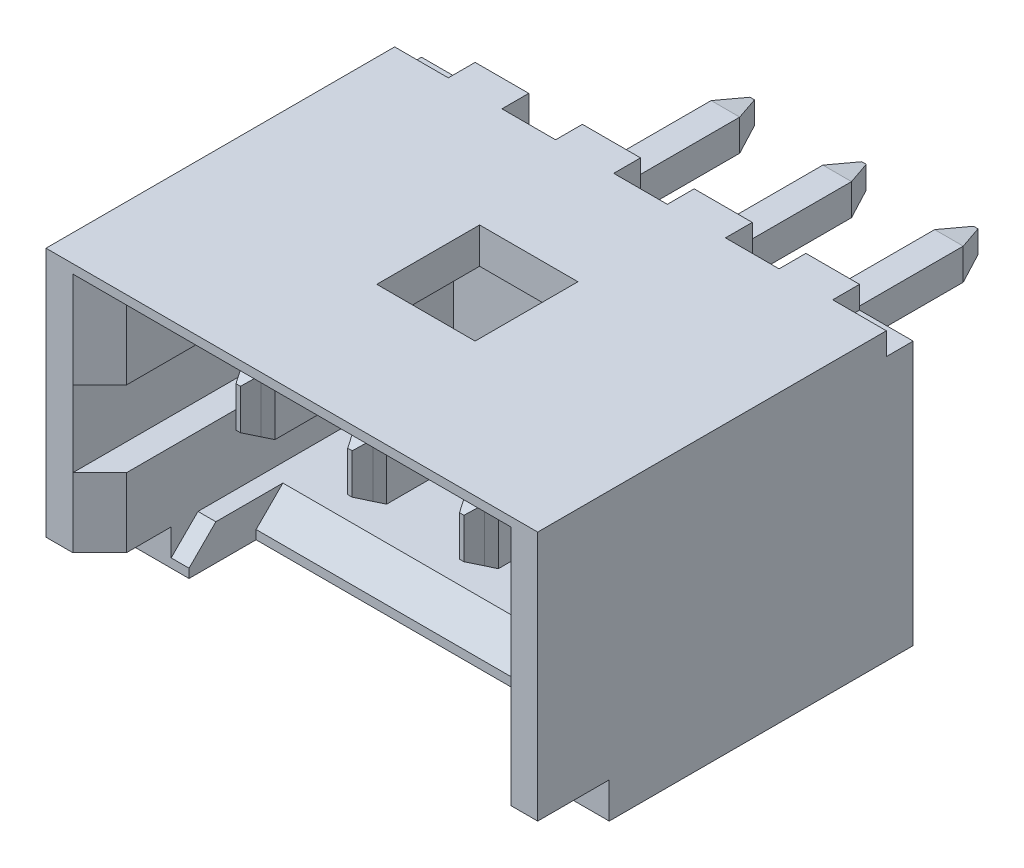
ISO-10303-21;
HEADER;
FILE_DESCRIPTION(('STEP AP214'),'2;1');
FILE_NAME('part.step','',(''),(''),'','','');
FILE_SCHEMA(('AUTOMOTIVE_DESIGN { 1 0 10303 214 1 1 1 1 }'));
ENDSEC;
DATA;
#1=APPLICATION_CONTEXT('core data for automotive mechanical design processes');
#2=APPLICATION_PROTOCOL_DEFINITION('international standard','automotive_design',2000,#1);
#3=PRODUCT_CONTEXT('',#1,'mechanical');
#4=PRODUCT('Part','Part','',(#3));
#5=PRODUCT_RELATED_PRODUCT_CATEGORY('part','',(#4));
#6=PRODUCT_DEFINITION_FORMATION('','',#4);
#7=PRODUCT_DEFINITION_CONTEXT('part definition',#1,'design');
#8=PRODUCT_DEFINITION('design','',#6,#7);
#9=PRODUCT_DEFINITION_SHAPE('','',#8);
#10=(LENGTH_UNIT() NAMED_UNIT(*) SI_UNIT(.MILLI.,.METRE.));
#11=(NAMED_UNIT(*) PLANE_ANGLE_UNIT() SI_UNIT($,.RADIAN.));
#12=(NAMED_UNIT(*) SI_UNIT($,.STERADIAN.) SOLID_ANGLE_UNIT());
#13=UNCERTAINTY_MEASURE_WITH_UNIT(LENGTH_MEASURE(1.E-05),#10,'distance_accuracy_value','');
#14=(GEOMETRIC_REPRESENTATION_CONTEXT(3) GLOBAL_UNCERTAINTY_ASSIGNED_CONTEXT((#13)) GLOBAL_UNIT_ASSIGNED_CONTEXT((#10,
#11,#12)) REPRESENTATION_CONTEXT('',''));
#15=CARTESIAN_POINT('',(0.,0.,0.));
#16=DIRECTION('',(0.,0.,1.));
#17=DIRECTION('',(1.,0.,0.));
#18=AXIS2_PLACEMENT_3D('',#15,#16,#17);
#19=CARTESIAN_POINT('',(0.,0.625,-4.15));
#20=DIRECTION('',(0.,0.986393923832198,-0.164398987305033));
#21=DIRECTION('',(0.,0.164398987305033,0.986393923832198));
#22=AXIS2_PLACEMENT_3D('',#19,#20,#21);
#23=PLANE('',#22);
#24=DIRECTION('',(0.405705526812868,0.150261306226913,0.90156783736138));
#25=VECTOR('',#24,1.);
#26=CARTESIAN_POINT('',(0.0249999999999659,0.6,-4.29999999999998));
#27=LINE('',#26,#25);
#28=CARTESIAN_POINT('',(0.0249999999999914,0.600000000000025,-4.3));
#29=VERTEX_POINT('',#28);
#30=CARTESIAN_POINT('',(0.160000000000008,0.649999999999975,-4.));
#31=VERTEX_POINT('',#30);
#32=EDGE_CURVE('E661',#29,#31,#27,.T.);
#33=ORIENTED_EDGE('',*,*,#32,.F.);
#34=DIRECTION('',(1.,0.,0.));
#35=VECTOR('',#34,1.);
#36=CARTESIAN_POINT('',(-2.75,0.6,-4.3));
#37=LINE('',#36,#35);
#38=CARTESIAN_POINT('',(-0.0249999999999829,0.600000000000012,-4.29999999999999));
#39=VERTEX_POINT('',#38);
#40=EDGE_CURVE('E674',#29,#39,#37,.F.);
#41=ORIENTED_EDGE('',*,*,#40,.T.);
#42=DIRECTION('',(0.405705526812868,-0.150261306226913,-0.90156783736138));
#43=VECTOR('',#42,1.);
#44=CARTESIAN_POINT('',(-0.160000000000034,0.65,-4.00000000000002));
#45=LINE('',#44,#43);
#46=CARTESIAN_POINT('',(-0.160000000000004,0.649999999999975,-4.));
#47=VERTEX_POINT('',#46);
#48=EDGE_CURVE('E19',#47,#39,#45,.T.);
#49=ORIENTED_EDGE('',*,*,#48,.F.);
#50=DIRECTION('',(1.,0.,0.));
#51=VECTOR('',#50,1.);
#52=CARTESIAN_POINT('',(0.,0.65,-4.));
#53=LINE('',#52,#51);
#54=EDGE_CURVE('E686',#31,#47,#53,.F.);
#55=ORIENTED_EDGE('',*,*,#54,.F.);
#56=EDGE_LOOP('',(#33,#41,#49,#55));
#57=FACE_BOUND('',#56,.T.);
#58=ADVANCED_FACE('F16',(#57),#23,.T.);
#59=CARTESIAN_POINT('',(-0.0925,0.475,-4.15));
#60=DIRECTION('',(-0.911921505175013,0.,-0.410364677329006));
#61=DIRECTION('',(-0.410364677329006,0.,0.911921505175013));
#62=AXIS2_PLACEMENT_3D('',#59,#60,#61);
#63=PLANE('',#62);
#64=ORIENTED_EDGE('',*,*,#48,.T.);
#65=DIRECTION('',(0.,1.,0.));
#66=VECTOR('',#65,1.);
#67=CARTESIAN_POINT('',(-0.0249999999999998,1.6,-4.3));
#68=LINE('',#67,#66);
#69=CARTESIAN_POINT('',(-0.0249999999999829,0.349999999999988,-4.29999999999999));
#70=VERTEX_POINT('',#69);
#71=EDGE_CURVE('E668',#39,#70,#68,.F.);
#72=ORIENTED_EDGE('',*,*,#71,.T.);
#73=DIRECTION('',(0.405705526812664,0.150261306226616,-0.901567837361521));
#74=VECTOR('',#73,1.);
#75=CARTESIAN_POINT('',(-0.16,0.300000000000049,-3.99999999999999));
#76=LINE('',#75,#74);
#77=CARTESIAN_POINT('',(-0.160000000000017,0.300000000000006,-4.00000000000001));
#78=VERTEX_POINT('',#77);
#79=EDGE_CURVE('E699',#78,#70,#76,.T.);
#80=ORIENTED_EDGE('',*,*,#79,.F.);
#81=DIRECTION('',(0.,1.,0.));
#82=VECTOR('',#81,1.);
#83=CARTESIAN_POINT('',(-0.16,0.475,-4.));
#84=LINE('',#83,#82);
#85=EDGE_CURVE('E671',#47,#78,#84,.F.);
#86=ORIENTED_EDGE('',*,*,#85,.F.);
#87=EDGE_LOOP('',(#64,#72,#80,#86));
#88=FACE_BOUND('',#87,.T.);
#89=ADVANCED_FACE('F666',(#88),#63,.T.);
#90=CARTESIAN_POINT('',(-2.75,1.6,-4.3));
#91=DIRECTION('',(0.,0.,1.));
#92=DIRECTION('',(1.,0.,0.));
#93=AXIS2_PLACEMENT_3D('',#90,#91,#92);
#94=PLANE('',#93);
#95=DIRECTION('',(0.,1.,0.));
#96=VECTOR('',#95,1.);
#97=CARTESIAN_POINT('',(0.0249999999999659,0.475,-4.29999999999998));
#98=LINE('',#97,#96);
#99=CARTESIAN_POINT('',(0.0249999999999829,0.349999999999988,-4.29999999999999));
#100=VERTEX_POINT('',#99);
#101=EDGE_CURVE('E684',#100,#29,#98,.T.);
#102=ORIENTED_EDGE('',*,*,#101,.F.);
#103=DIRECTION('',(1.,0.,0.));
#104=VECTOR('',#103,1.);
#105=CARTESIAN_POINT('',(0.,0.349999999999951,-4.30000000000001));
#106=LINE('',#105,#104);
#107=EDGE_CURVE('E680',#70,#100,#106,.T.);
#108=ORIENTED_EDGE('',*,*,#107,.F.);
#109=ORIENTED_EDGE('',*,*,#71,.F.);
#110=ORIENTED_EDGE('',*,*,#40,.F.);
#111=EDGE_LOOP('',(#102,#108,#109,#110));
#112=FACE_BOUND('',#111,.T.);
#113=ADVANCED_FACE('F678',(#112),#94,.F.);
#114=CARTESIAN_POINT('',(0.0925,0.475,-4.15));
#115=DIRECTION('',(0.911921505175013,0.,-0.410364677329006));
#116=DIRECTION('',(-0.410364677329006,0.,-0.911921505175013));
#117=AXIS2_PLACEMENT_3D('',#114,#115,#116);
#118=PLANE('',#117);
#119=DIRECTION('',(0.405705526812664,-0.150261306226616,0.901567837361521));
#120=VECTOR('',#119,1.);
#121=CARTESIAN_POINT('',(0.025,0.349999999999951,-4.30000000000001));
#122=LINE('',#121,#120);
#123=CARTESIAN_POINT('',(0.160000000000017,0.300000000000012,-4.00000000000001));
#124=VERTEX_POINT('',#123);
#125=EDGE_CURVE('E696',#100,#124,#122,.T.);
#126=ORIENTED_EDGE('',*,*,#125,.F.);
#127=ORIENTED_EDGE('',*,*,#101,.T.);
#128=ORIENTED_EDGE('',*,*,#32,.T.);
#129=DIRECTION('',(0.,1.,0.));
#130=VECTOR('',#129,1.);
#131=CARTESIAN_POINT('',(0.16,0.475,-4.));
#132=LINE('',#131,#130);
#133=EDGE_CURVE('E702',#124,#31,#132,.T.);
#134=ORIENTED_EDGE('',*,*,#133,.F.);
#135=EDGE_LOOP('',(#126,#127,#128,#134));
#136=FACE_BOUND('',#135,.T.);
#137=ADVANCED_FACE('F2682',(#136),#118,.T.);
#138=CARTESIAN_POINT('',(0.,0.65,-2.9));
#139=DIRECTION('',(0.,1.,0.));
#140=DIRECTION('',(0.,0.,1.));
#141=AXIS2_PLACEMENT_3D('',#138,#139,#140);
#142=PLANE('',#141);
#143=DIRECTION('',(0.,0.,1.));
#144=VECTOR('',#143,1.);
#145=CARTESIAN_POINT('',(-0.16,0.65,-2.9));
#146=LINE('',#145,#144);
#147=CARTESIAN_POINT('',(-0.16,0.65,-2.));
#148=VERTEX_POINT('',#147);
#149=EDGE_CURVE('E690',#148,#47,#146,.F.);
#150=ORIENTED_EDGE('',*,*,#149,.F.);
#151=DIRECTION('',(1.,0.,0.));
#152=VECTOR('',#151,1.);
#153=CARTESIAN_POINT('',(0.,0.65,-2.));
#154=LINE('',#153,#152);
#155=CARTESIAN_POINT('',(0.16,0.65,-2.));
#156=VERTEX_POINT('',#155);
#157=EDGE_CURVE('E688',#148,#156,#154,.T.);
#158=ORIENTED_EDGE('',*,*,#157,.T.);
#159=DIRECTION('',(0.,0.,-1.));
#160=VECTOR('',#159,1.);
#161=CARTESIAN_POINT('',(0.16,0.65,-2.9));
#162=LINE('',#161,#160);
#163=EDGE_CURVE('E705',#31,#156,#162,.F.);
#164=ORIENTED_EDGE('',*,*,#163,.F.);
#165=ORIENTED_EDGE('',*,*,#54,.T.);
#166=EDGE_LOOP('',(#150,#158,#164,#165));
#167=FACE_BOUND('',#166,.T.);
#168=ADVANCED_FACE('F2673',(#167),#142,.T.);
#169=CARTESIAN_POINT('',(-0.16,0.475,-2.9));
#170=DIRECTION('',(-1.,0.,0.));
#171=DIRECTION('',(0.,0.,1.));
#172=AXIS2_PLACEMENT_3D('',#169,#170,#171);
#173=PLANE('',#172);
#174=DIRECTION('',(0.,0.,-1.));
#175=VECTOR('',#174,1.);
#176=CARTESIAN_POINT('',(-0.16,0.3,-2.9));
#177=LINE('',#176,#175);
#178=CARTESIAN_POINT('',(-0.16,0.3,-2.));
#179=VERTEX_POINT('',#178);
#180=EDGE_CURVE('E710',#179,#78,#177,.T.);
#181=ORIENTED_EDGE('',*,*,#180,.F.);
#182=DIRECTION('',(0.,1.,0.));
#183=VECTOR('',#182,1.);
#184=CARTESIAN_POINT('',(-0.16,0.475,-2.));
#185=LINE('',#184,#183);
#186=EDGE_CURVE('E693',#179,#148,#185,.T.);
#187=ORIENTED_EDGE('',*,*,#186,.T.);
#188=ORIENTED_EDGE('',*,*,#149,.T.);
#189=ORIENTED_EDGE('',*,*,#85,.T.);
#190=EDGE_LOOP('',(#181,#187,#188,#189));
#191=FACE_BOUND('',#190,.T.);
#192=ADVANCED_FACE('F2664',(#191),#173,.T.);
#193=CARTESIAN_POINT('',(0.,0.325,-4.15));
#194=DIRECTION('',(0.,-0.986393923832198,-0.164398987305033));
#195=DIRECTION('',(0.,0.164398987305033,-0.986393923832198));
#196=AXIS2_PLACEMENT_3D('',#193,#194,#195);
#197=PLANE('',#196);
#198=ORIENTED_EDGE('',*,*,#79,.T.);
#199=ORIENTED_EDGE('',*,*,#107,.T.);
#200=ORIENTED_EDGE('',*,*,#125,.T.);
#201=DIRECTION('',(1.,0.,0.));
#202=VECTOR('',#201,1.);
#203=CARTESIAN_POINT('',(0.,0.3,-4.));
#204=LINE('',#203,#202);
#205=EDGE_CURVE('E713',#78,#124,#204,.T.);
#206=ORIENTED_EDGE('',*,*,#205,.F.);
#207=EDGE_LOOP('',(#198,#199,#200,#206));
#208=FACE_BOUND('',#207,.T.);
#209=ADVANCED_FACE('F2655',(#208),#197,.T.);
#210=CARTESIAN_POINT('',(0.16,0.475,-2.9));
#211=DIRECTION('',(1.,0.,0.));
#212=DIRECTION('',(0.,0.,-1.));
#213=AXIS2_PLACEMENT_3D('',#210,#211,#212);
#214=PLANE('',#213);
#215=ORIENTED_EDGE('',*,*,#163,.T.);
#216=DIRECTION('',(0.,1.,0.));
#217=VECTOR('',#216,1.);
#218=CARTESIAN_POINT('',(0.16,0.475,-2.));
#219=LINE('',#218,#217);
#220=CARTESIAN_POINT('',(0.16,0.3,-2.));
#221=VERTEX_POINT('',#220);
#222=EDGE_CURVE('E708',#156,#221,#219,.F.);
#223=ORIENTED_EDGE('',*,*,#222,.T.);
#224=DIRECTION('',(0.,0.,-1.));
#225=VECTOR('',#224,1.);
#226=CARTESIAN_POINT('',(0.16,0.3,-2.9));
#227=LINE('',#226,#225);
#228=EDGE_CURVE('E716',#124,#221,#227,.F.);
#229=ORIENTED_EDGE('',*,*,#228,.F.);
#230=ORIENTED_EDGE('',*,*,#133,.T.);
#231=EDGE_LOOP('',(#215,#223,#229,#230));
#232=FACE_BOUND('',#231,.T.);
#233=ADVANCED_FACE('F2646',(#232),#214,.T.);
#234=CARTESIAN_POINT('',(0.,0.3,-2.9));
#235=DIRECTION('',(0.,-1.,0.));
#236=DIRECTION('',(0.,0.,-1.));
#237=AXIS2_PLACEMENT_3D('',#234,#235,#236);
#238=PLANE('',#237);
#239=ORIENTED_EDGE('',*,*,#228,.T.);
#240=DIRECTION('',(1.,0.,0.));
#241=VECTOR('',#240,1.);
#242=CARTESIAN_POINT('',(0.3,0.3,-2.));
#243=LINE('',#242,#241);
#244=EDGE_CURVE('E723',#221,#179,#243,.F.);
#245=ORIENTED_EDGE('',*,*,#244,.T.);
#246=ORIENTED_EDGE('',*,*,#180,.T.);
#247=ORIENTED_EDGE('',*,*,#205,.T.);
#248=EDGE_LOOP('',(#239,#245,#246,#247));
#249=FACE_BOUND('',#248,.T.);
#250=ADVANCED_FACE('F2637',(#249),#238,.T.);
#251=CARTESIAN_POINT('',(-1.25,0.625,-4.15));
#252=DIRECTION('',(0.,0.986393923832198,-0.164398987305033));
#253=DIRECTION('',(0.,0.164398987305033,0.986393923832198));
#254=AXIS2_PLACEMENT_3D('',#251,#252,#253);
#255=PLANE('',#254);
#256=DIRECTION('',(0.405705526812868,0.150261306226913,0.90156783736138));
#257=VECTOR('',#256,1.);
#258=CARTESIAN_POINT('',(-1.22500000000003,0.6,-4.29999999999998));
#259=LINE('',#258,#257);
#260=CARTESIAN_POINT('',(-1.22500000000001,0.600000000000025,-4.3));
#261=VERTEX_POINT('',#260);
#262=CARTESIAN_POINT('',(-1.08999999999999,0.649999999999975,-4.));
#263=VERTEX_POINT('',#262);
#264=EDGE_CURVE('E753',#261,#263,#259,.T.);
#265=ORIENTED_EDGE('',*,*,#264,.F.);
#266=DIRECTION('',(1.,0.,0.));
#267=VECTOR('',#266,1.);
#268=CARTESIAN_POINT('',(-2.75,0.6,-4.3));
#269=LINE('',#268,#267);
#270=CARTESIAN_POINT('',(-1.27499999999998,0.600000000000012,-4.29999999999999));
#271=VERTEX_POINT('',#270);
#272=EDGE_CURVE('E750',#261,#271,#269,.F.);
#273=ORIENTED_EDGE('',*,*,#272,.T.);
#274=DIRECTION('',(0.405705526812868,-0.150261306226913,-0.90156783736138));
#275=VECTOR('',#274,1.);
#276=CARTESIAN_POINT('',(-1.41000000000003,0.65,-4.00000000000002));
#277=LINE('',#276,#275);
#278=CARTESIAN_POINT('',(-1.41,0.649999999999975,-4.));
#279=VERTEX_POINT('',#278);
#280=EDGE_CURVE('E746',#279,#271,#277,.T.);
#281=ORIENTED_EDGE('',*,*,#280,.F.);
#282=DIRECTION('',(1.,0.,0.));
#283=VECTOR('',#282,1.);
#284=CARTESIAN_POINT('',(-1.25,0.65,-4.));
#285=LINE('',#284,#283);
#286=EDGE_CURVE('E759',#263,#279,#285,.F.);
#287=ORIENTED_EDGE('',*,*,#286,.F.);
#288=EDGE_LOOP('',(#265,#273,#281,#287));
#289=FACE_BOUND('',#288,.T.);
#290=ADVANCED_FACE('F2628',(#289),#255,.T.);
#291=CARTESIAN_POINT('',(0.3,1.35,-2.));
#292=DIRECTION('',(0.,0.,1.));
#293=DIRECTION('',(1.,0.,0.));
#294=AXIS2_PLACEMENT_3D('',#291,#292,#293);
#295=PLANE('',#294);
#296=ORIENTED_EDGE('',*,*,#222,.F.);
#297=ORIENTED_EDGE('',*,*,#157,.F.);
#298=ORIENTED_EDGE('',*,*,#186,.F.);
#299=ORIENTED_EDGE('',*,*,#244,.F.);
#300=EDGE_LOOP('',(#296,#297,#298,#299));
#301=FACE_BOUND('',#300,.T.);
#302=DIRECTION('',(0.,1.,0.));
#303=VECTOR('',#302,1.);
#304=CARTESIAN_POINT('',(-0.3,0.,-2.));
#305=LINE('',#304,#303);
#306=CARTESIAN_POINT('',(-0.3,1.35,-2.));
#307=VERTEX_POINT('',#306);
#308=CARTESIAN_POINT('',(-0.3,-0.4,-2.));
#309=VERTEX_POINT('',#308);
#310=EDGE_CURVE('E735',#307,#309,#305,.F.);
#311=ORIENTED_EDGE('',*,*,#310,.F.);
#312=DIRECTION('',(1.,0.,0.));
#313=VECTOR('',#312,1.);
#314=CARTESIAN_POINT('',(0.3,1.35,-2.));
#315=LINE('',#314,#313);
#316=CARTESIAN_POINT('',(0.3,1.35,-2.));
#317=VERTEX_POINT('',#316);
#318=EDGE_CURVE('E719',#317,#307,#315,.F.);
#319=ORIENTED_EDGE('',*,*,#318,.F.);
#320=DIRECTION('',(0.,1.,0.));
#321=VECTOR('',#320,1.);
#322=CARTESIAN_POINT('',(0.3,0.,-2.));
#323=LINE('',#322,#321);
#324=CARTESIAN_POINT('',(0.3,-0.4,-2.));
#325=VERTEX_POINT('',#324);
#326=EDGE_CURVE('E772',#317,#325,#323,.F.);
#327=ORIENTED_EDGE('',*,*,#326,.T.);
#328=DIRECTION('',(1.,0.,0.));
#329=VECTOR('',#328,1.);
#330=CARTESIAN_POINT('',(0.3,-0.4,-2.));
#331=LINE('',#330,#329);
#332=EDGE_CURVE('E721',#309,#325,#331,.T.);
#333=ORIENTED_EDGE('',*,*,#332,.F.);
#334=EDGE_LOOP('',(#311,#319,#327,#333));
#335=FACE_BOUND('',#334,.T.);
#336=ADVANCED_FACE('F2619',(#301,#335),#295,.F.);
#337=CARTESIAN_POINT('',(1.25,0.625,-4.15));
#338=DIRECTION('',(0.,0.986393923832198,-0.164398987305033));
#339=DIRECTION('',(0.,0.164398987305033,0.986393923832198));
#340=AXIS2_PLACEMENT_3D('',#337,#338,#339);
#341=PLANE('',#340);
#342=DIRECTION('',(0.405705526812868,0.150261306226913,0.90156783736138));
#343=VECTOR('',#342,1.);
#344=CARTESIAN_POINT('',(1.27499999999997,0.6,-4.29999999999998));
#345=LINE('',#344,#343);
#346=CARTESIAN_POINT('',(1.27499999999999,0.600000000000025,-4.3));
#347=VERTEX_POINT('',#346);
#348=CARTESIAN_POINT('',(1.41000000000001,0.649999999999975,-4.));
#349=VERTEX_POINT('',#348);
#350=EDGE_CURVE('E786',#347,#349,#345,.T.);
#351=ORIENTED_EDGE('',*,*,#350,.F.);
#352=DIRECTION('',(1.,0.,0.));
#353=VECTOR('',#352,1.);
#354=CARTESIAN_POINT('',(-2.75,0.6,-4.3));
#355=LINE('',#354,#353);
#356=CARTESIAN_POINT('',(1.22500000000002,0.600000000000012,-4.29999999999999));
#357=VERTEX_POINT('',#356);
#358=EDGE_CURVE('E783',#347,#357,#355,.F.);
#359=ORIENTED_EDGE('',*,*,#358,.T.);
#360=DIRECTION('',(0.405705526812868,-0.150261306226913,-0.90156783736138));
#361=VECTOR('',#360,1.);
#362=CARTESIAN_POINT('',(1.08999999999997,0.65,-4.00000000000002));
#363=LINE('',#362,#361);
#364=CARTESIAN_POINT('',(1.09,0.649999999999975,-4.));
#365=VERTEX_POINT('',#364);
#366=EDGE_CURVE('E779',#365,#357,#363,.T.);
#367=ORIENTED_EDGE('',*,*,#366,.F.);
#368=DIRECTION('',(1.,0.,0.));
#369=VECTOR('',#368,1.);
#370=CARTESIAN_POINT('',(1.25,0.65,-4.));
#371=LINE('',#370,#369);
#372=EDGE_CURVE('E792',#349,#365,#371,.F.);
#373=ORIENTED_EDGE('',*,*,#372,.F.);
#374=EDGE_LOOP('',(#351,#359,#367,#373));
#375=FACE_BOUND('',#374,.T.);
#376=ADVANCED_FACE('F2610',(#375),#341,.T.);
#377=CARTESIAN_POINT('',(-0.3,0.,0.));
#378=DIRECTION('',(1.,0.,0.));
#379=DIRECTION('',(0.,0.,-1.));
#380=AXIS2_PLACEMENT_3D('',#377,#378,#379);
#381=PLANE('',#380);
#382=DIRECTION('',(0.,1.,0.));
#383=VECTOR('',#382,1.);
#384=CARTESIAN_POINT('',(-0.3,0.,-1.8));
#385=LINE('',#384,#383);
#386=CARTESIAN_POINT('',(-0.3,-0.4,-1.8));
#387=VERTEX_POINT('',#386);
#388=CARTESIAN_POINT('',(-0.3,-1.6,-1.8));
#389=VERTEX_POINT('',#388);
#390=EDGE_CURVE('E741',#387,#389,#385,.F.);
#391=ORIENTED_EDGE('',*,*,#390,.T.);
#392=DIRECTION('',(0.,0.,-1.));
#393=VECTOR('',#392,1.);
#394=CARTESIAN_POINT('',(-0.3,-1.6,0.));
#395=LINE('',#394,#393);
#396=CARTESIAN_POINT('',(-0.3,-1.6,-2.1));
#397=VERTEX_POINT('',#396);
#398=EDGE_CURVE('E744',#389,#397,#395,.T.);
#399=ORIENTED_EDGE('',*,*,#398,.T.);
#400=DIRECTION('',(0.,1.,0.));
#401=VECTOR('',#400,1.);
#402=CARTESIAN_POINT('',(-0.3,-1.6,-2.1));
#403=LINE('',#402,#401);
#404=CARTESIAN_POINT('',(-0.3,1.6,-2.1));
#405=VERTEX_POINT('',#404);
#406=EDGE_CURVE('E800',#405,#397,#403,.F.);
#407=ORIENTED_EDGE('',*,*,#406,.F.);
#408=DIRECTION('',(0.,0.,-1.));
#409=VECTOR('',#408,1.);
#410=CARTESIAN_POINT('',(-0.3,1.6,0.));
#411=LINE('',#410,#409);
#412=CARTESIAN_POINT('',(-0.3,1.6,-1.8));
#413=VERTEX_POINT('',#412);
#414=EDGE_CURVE('E726',#405,#413,#411,.F.);
#415=ORIENTED_EDGE('',*,*,#414,.T.);
#416=DIRECTION('',(0.,1.,0.));
#417=VECTOR('',#416,1.);
#418=CARTESIAN_POINT('',(-0.3,0.,-1.8));
#419=LINE('',#418,#417);
#420=CARTESIAN_POINT('',(-0.3,1.35,-1.8));
#421=VERTEX_POINT('',#420);
#422=EDGE_CURVE('E729',#413,#421,#419,.F.);
#423=ORIENTED_EDGE('',*,*,#422,.T.);
#424=DIRECTION('',(0.,0.,-1.));
#425=VECTOR('',#424,1.);
#426=CARTESIAN_POINT('',(-0.3,1.35,0.));
#427=LINE('',#426,#425);
#428=EDGE_CURVE('E732',#421,#307,#427,.T.);
#429=ORIENTED_EDGE('',*,*,#428,.T.);
#430=ORIENTED_EDGE('',*,*,#310,.T.);
#431=DIRECTION('',(0.,0.,-1.));
#432=VECTOR('',#431,1.);
#433=CARTESIAN_POINT('',(-0.3,-0.4,0.));
#434=LINE('',#433,#432);
#435=EDGE_CURVE('E738',#309,#387,#434,.F.);
#436=ORIENTED_EDGE('',*,*,#435,.T.);
#437=EDGE_LOOP('',(#391,#399,#407,#415,#423,#429,#430,#436));
#438=FACE_BOUND('',#437,.T.);
#439=ADVANCED_FACE('F2601',(#438),#381,.T.);
#440=CARTESIAN_POINT('',(-1.3425,0.475,-4.15));
#441=DIRECTION('',(-0.911921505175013,0.,-0.410364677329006));
#442=DIRECTION('',(-0.410364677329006,0.,0.911921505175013));
#443=AXIS2_PLACEMENT_3D('',#440,#441,#442);
#444=PLANE('',#443);
#445=ORIENTED_EDGE('',*,*,#280,.T.);
#446=DIRECTION('',(0.,1.,0.));
#447=VECTOR('',#446,1.);
#448=CARTESIAN_POINT('',(-1.275,1.6,-4.3));
#449=LINE('',#448,#447);
#450=CARTESIAN_POINT('',(-1.27499999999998,0.349999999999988,-4.29999999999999));
#451=VERTEX_POINT('',#450);
#452=EDGE_CURVE('E748',#271,#451,#449,.F.);
#453=ORIENTED_EDGE('',*,*,#452,.T.);
#454=DIRECTION('',(0.405705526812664,0.150261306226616,-0.901567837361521));
#455=VECTOR('',#454,1.);
#456=CARTESIAN_POINT('',(-1.41,0.300000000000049,-3.99999999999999));
#457=LINE('',#456,#455);
#458=CARTESIAN_POINT('',(-1.41000000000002,0.300000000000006,-4.00000000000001));
#459=VERTEX_POINT('',#458);
#460=EDGE_CURVE('E818',#459,#451,#457,.T.);
#461=ORIENTED_EDGE('',*,*,#460,.F.);
#462=DIRECTION('',(0.,1.,0.));
#463=VECTOR('',#462,1.);
#464=CARTESIAN_POINT('',(-1.41,0.475,-4.));
#465=LINE('',#464,#463);
#466=EDGE_CURVE('E809',#279,#459,#465,.F.);
#467=ORIENTED_EDGE('',*,*,#466,.F.);
#468=EDGE_LOOP('',(#445,#453,#461,#467));
#469=FACE_BOUND('',#468,.T.);
#470=ADVANCED_FACE('F2592',(#469),#444,.T.);
#471=CARTESIAN_POINT('',(-2.75,1.6,-4.3));
#472=DIRECTION('',(0.,0.,1.));
#473=DIRECTION('',(1.,0.,0.));
#474=AXIS2_PLACEMENT_3D('',#471,#472,#473);
#475=PLANE('',#474);
#476=DIRECTION('',(0.,1.,0.));
#477=VECTOR('',#476,1.);
#478=CARTESIAN_POINT('',(-1.22500000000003,0.475,-4.29999999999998));
#479=LINE('',#478,#477);
#480=CARTESIAN_POINT('',(-1.22500000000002,0.349999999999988,-4.29999999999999));
#481=VERTEX_POINT('',#480);
#482=EDGE_CURVE('E756',#481,#261,#479,.T.);
#483=ORIENTED_EDGE('',*,*,#482,.F.);
#484=DIRECTION('',(1.,0.,0.));
#485=VECTOR('',#484,1.);
#486=CARTESIAN_POINT('',(-1.25,0.349999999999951,-4.30000000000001));
#487=LINE('',#486,#485);
#488=EDGE_CURVE('E821',#451,#481,#487,.T.);
#489=ORIENTED_EDGE('',*,*,#488,.F.);
#490=ORIENTED_EDGE('',*,*,#452,.F.);
#491=ORIENTED_EDGE('',*,*,#272,.F.);
#492=EDGE_LOOP('',(#483,#489,#490,#491));
#493=FACE_BOUND('',#492,.T.);
#494=ADVANCED_FACE('F2583',(#493),#475,.F.);
#495=CARTESIAN_POINT('',(-1.1575,0.475,-4.15));
#496=DIRECTION('',(0.911921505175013,0.,-0.410364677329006));
#497=DIRECTION('',(-0.410364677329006,0.,-0.911921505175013));
#498=AXIS2_PLACEMENT_3D('',#495,#496,#497);
#499=PLANE('',#498);
#500=DIRECTION('',(0.405705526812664,-0.150261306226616,0.901567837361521));
#501=VECTOR('',#500,1.);
#502=CARTESIAN_POINT('',(-1.225,0.349999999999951,-4.30000000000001));
#503=LINE('',#502,#501);
#504=CARTESIAN_POINT('',(-1.08999999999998,0.300000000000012,-4.00000000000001));
#505=VERTEX_POINT('',#504);
#506=EDGE_CURVE('E815',#481,#505,#503,.T.);
#507=ORIENTED_EDGE('',*,*,#506,.F.);
#508=ORIENTED_EDGE('',*,*,#482,.T.);
#509=ORIENTED_EDGE('',*,*,#264,.T.);
#510=DIRECTION('',(0.,1.,0.));
#511=VECTOR('',#510,1.);
#512=CARTESIAN_POINT('',(-1.09,0.475,-4.));
#513=LINE('',#512,#511);
#514=EDGE_CURVE('E824',#505,#263,#513,.T.);
#515=ORIENTED_EDGE('',*,*,#514,.F.);
#516=EDGE_LOOP('',(#507,#508,#509,#515));
#517=FACE_BOUND('',#516,.T.);
#518=ADVANCED_FACE('F2574',(#517),#499,.T.);
#519=CARTESIAN_POINT('',(-1.25,0.65,-2.9));
#520=DIRECTION('',(0.,1.,0.));
#521=DIRECTION('',(0.,0.,1.));
#522=AXIS2_PLACEMENT_3D('',#519,#520,#521);
#523=PLANE('',#522);
#524=DIRECTION('',(0.,0.,1.));
#525=VECTOR('',#524,1.);
#526=CARTESIAN_POINT('',(-1.41,0.65,-2.9));
#527=LINE('',#526,#525);
#528=CARTESIAN_POINT('',(-1.41,0.65,-2.));
#529=VERTEX_POINT('',#528);
#530=EDGE_CURVE('E806',#529,#279,#527,.F.);
#531=ORIENTED_EDGE('',*,*,#530,.F.);
#532=DIRECTION('',(1.,0.,0.));
#533=VECTOR('',#532,1.);
#534=CARTESIAN_POINT('',(-1.25,0.65,-2.));
#535=LINE('',#534,#533);
#536=CARTESIAN_POINT('',(-1.09,0.65,-2.));
#537=VERTEX_POINT('',#536);
#538=EDGE_CURVE('E762',#529,#537,#535,.T.);
#539=ORIENTED_EDGE('',*,*,#538,.T.);
#540=DIRECTION('',(0.,0.,-1.));
#541=VECTOR('',#540,1.);
#542=CARTESIAN_POINT('',(-1.09,0.65,-2.9));
#543=LINE('',#542,#541);
#544=EDGE_CURVE('E827',#263,#537,#543,.F.);
#545=ORIENTED_EDGE('',*,*,#544,.F.);
#546=ORIENTED_EDGE('',*,*,#286,.T.);
#547=EDGE_LOOP('',(#531,#539,#545,#546));
#548=FACE_BOUND('',#547,.T.);
#549=ADVANCED_FACE('F2565',(#548),#523,.T.);
#550=CARTESIAN_POINT('',(0.3,0.,0.));
#551=DIRECTION('',(1.,0.,0.));
#552=DIRECTION('',(0.,0.,-1.));
#553=AXIS2_PLACEMENT_3D('',#550,#551,#552);
#554=PLANE('',#553);
#555=DIRECTION('',(0.,0.,-1.));
#556=VECTOR('',#555,1.);
#557=CARTESIAN_POINT('',(0.3,-0.4,0.));
#558=LINE('',#557,#556);
#559=CARTESIAN_POINT('',(0.3,-0.4,-1.8));
#560=VERTEX_POINT('',#559);
#561=EDGE_CURVE('E775',#325,#560,#558,.F.);
#562=ORIENTED_EDGE('',*,*,#561,.F.);
#563=ORIENTED_EDGE('',*,*,#326,.F.);
#564=DIRECTION('',(0.,0.,-1.));
#565=VECTOR('',#564,1.);
#566=CARTESIAN_POINT('',(0.3,1.35,0.));
#567=LINE('',#566,#565);
#568=CARTESIAN_POINT('',(0.3,1.35,-1.8));
#569=VERTEX_POINT('',#568);
#570=EDGE_CURVE('E770',#569,#317,#567,.T.);
#571=ORIENTED_EDGE('',*,*,#570,.F.);
#572=DIRECTION('',(0.,1.,0.));
#573=VECTOR('',#572,1.);
#574=CARTESIAN_POINT('',(0.3,0.,-1.8));
#575=LINE('',#574,#573);
#576=CARTESIAN_POINT('',(0.3,1.6,-1.8));
#577=VERTEX_POINT('',#576);
#578=EDGE_CURVE('E768',#577,#569,#575,.F.);
#579=ORIENTED_EDGE('',*,*,#578,.F.);
#580=DIRECTION('',(0.,0.,-1.));
#581=VECTOR('',#580,1.);
#582=CARTESIAN_POINT('',(0.3,1.6,0.));
#583=LINE('',#582,#581);
#584=CARTESIAN_POINT('',(0.3,1.6,-2.1));
#585=VERTEX_POINT('',#584);
#586=EDGE_CURVE('E766',#585,#577,#583,.F.);
#587=ORIENTED_EDGE('',*,*,#586,.F.);
#588=DIRECTION('',(0.,1.,0.));
#589=VECTOR('',#588,1.);
#590=CARTESIAN_POINT('',(0.3,-1.6,-2.1));
#591=LINE('',#590,#589);
#592=CARTESIAN_POINT('',(0.3,-1.6,-2.1));
#593=VERTEX_POINT('',#592);
#594=EDGE_CURVE('E837',#593,#585,#591,.T.);
#595=ORIENTED_EDGE('',*,*,#594,.F.);
#596=DIRECTION('',(0.,0.,-1.));
#597=VECTOR('',#596,1.);
#598=CARTESIAN_POINT('',(0.3,-1.6,0.));
#599=LINE('',#598,#597);
#600=CARTESIAN_POINT('',(0.3,-1.6,-1.8));
#601=VERTEX_POINT('',#600);
#602=EDGE_CURVE('E764',#601,#593,#599,.T.);
#603=ORIENTED_EDGE('',*,*,#602,.F.);
#604=DIRECTION('',(0.,1.,0.));
#605=VECTOR('',#604,1.);
#606=CARTESIAN_POINT('',(0.3,0.,-1.8));
#607=LINE('',#606,#605);
#608=EDGE_CURVE('E777',#560,#601,#607,.F.);
#609=ORIENTED_EDGE('',*,*,#608,.F.);
#610=EDGE_LOOP('',(#562,#563,#571,#579,#587,#595,#603,#609));
#611=FACE_BOUND('',#610,.T.);
#612=ADVANCED_FACE('F2556',(#611),#554,.F.);
#613=CARTESIAN_POINT('',(1.1575,0.475,-4.15));
#614=DIRECTION('',(-0.911921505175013,0.,-0.410364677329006));
#615=DIRECTION('',(-0.410364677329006,0.,0.911921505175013));
#616=AXIS2_PLACEMENT_3D('',#613,#614,#615);
#617=PLANE('',#616);
#618=ORIENTED_EDGE('',*,*,#366,.T.);
#619=DIRECTION('',(0.,1.,0.));
#620=VECTOR('',#619,1.);
#621=CARTESIAN_POINT('',(1.225,1.6,-4.3));
#622=LINE('',#621,#620);
#623=CARTESIAN_POINT('',(1.22500000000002,0.349999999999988,-4.29999999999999));
#624=VERTEX_POINT('',#623);
#625=EDGE_CURVE('E781',#357,#624,#622,.F.);
#626=ORIENTED_EDGE('',*,*,#625,.T.);
#627=DIRECTION('',(0.405705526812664,0.150261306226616,-0.901567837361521));
#628=VECTOR('',#627,1.);
#629=CARTESIAN_POINT('',(1.09,0.300000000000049,-3.99999999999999));
#630=LINE('',#629,#628);
#631=CARTESIAN_POINT('',(1.08999999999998,0.300000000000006,-4.00000000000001));
#632=VERTEX_POINT('',#631);
#633=EDGE_CURVE('E852',#632,#624,#630,.T.);
#634=ORIENTED_EDGE('',*,*,#633,.F.);
#635=DIRECTION('',(0.,1.,0.));
#636=VECTOR('',#635,1.);
#637=CARTESIAN_POINT('',(1.09,0.475,-4.));
#638=LINE('',#637,#636);
#639=EDGE_CURVE('E843',#365,#632,#638,.F.);
#640=ORIENTED_EDGE('',*,*,#639,.F.);
#641=EDGE_LOOP('',(#618,#626,#634,#640));
#642=FACE_BOUND('',#641,.T.);
#643=ADVANCED_FACE('F2547',(#642),#617,.T.);
#644=CARTESIAN_POINT('',(-2.75,1.6,-4.3));
#645=DIRECTION('',(0.,0.,1.));
#646=DIRECTION('',(1.,0.,0.));
#647=AXIS2_PLACEMENT_3D('',#644,#645,#646);
#648=PLANE('',#647);
#649=DIRECTION('',(0.,1.,0.));
#650=VECTOR('',#649,1.);
#651=CARTESIAN_POINT('',(1.27499999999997,0.475,-4.29999999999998));
#652=LINE('',#651,#650);
#653=CARTESIAN_POINT('',(1.27499999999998,0.349999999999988,-4.29999999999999));
#654=VERTEX_POINT('',#653);
#655=EDGE_CURVE('E789',#654,#347,#652,.T.);
#656=ORIENTED_EDGE('',*,*,#655,.F.);
#657=DIRECTION('',(1.,0.,0.));
#658=VECTOR('',#657,1.);
#659=CARTESIAN_POINT('',(1.25,0.349999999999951,-4.30000000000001));
#660=LINE('',#659,#658);
#661=EDGE_CURVE('E855',#624,#654,#660,.T.);
#662=ORIENTED_EDGE('',*,*,#661,.F.);
#663=ORIENTED_EDGE('',*,*,#625,.F.);
#664=ORIENTED_EDGE('',*,*,#358,.F.);
#665=EDGE_LOOP('',(#656,#662,#663,#664));
#666=FACE_BOUND('',#665,.T.);
#667=ADVANCED_FACE('F2538',(#666),#648,.F.);
#668=CARTESIAN_POINT('',(1.3425,0.475,-4.15));
#669=DIRECTION('',(0.911921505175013,0.,-0.410364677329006));
#670=DIRECTION('',(-0.410364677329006,0.,-0.911921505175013));
#671=AXIS2_PLACEMENT_3D('',#668,#669,#670);
#672=PLANE('',#671);
#673=DIRECTION('',(0.405705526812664,-0.150261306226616,0.901567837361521));
#674=VECTOR('',#673,1.);
#675=CARTESIAN_POINT('',(1.275,0.349999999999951,-4.30000000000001));
#676=LINE('',#675,#674);
#677=CARTESIAN_POINT('',(1.41000000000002,0.300000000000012,-4.00000000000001));
#678=VERTEX_POINT('',#677);
#679=EDGE_CURVE('E849',#654,#678,#676,.T.);
#680=ORIENTED_EDGE('',*,*,#679,.F.);
#681=ORIENTED_EDGE('',*,*,#655,.T.);
#682=ORIENTED_EDGE('',*,*,#350,.T.);
#683=DIRECTION('',(0.,1.,0.));
#684=VECTOR('',#683,1.);
#685=CARTESIAN_POINT('',(1.41,0.475,-4.));
#686=LINE('',#685,#684);
#687=EDGE_CURVE('E858',#678,#349,#686,.T.);
#688=ORIENTED_EDGE('',*,*,#687,.F.);
#689=EDGE_LOOP('',(#680,#681,#682,#688));
#690=FACE_BOUND('',#689,.T.);
#691=ADVANCED_FACE('F2529',(#690),#672,.T.);
#692=CARTESIAN_POINT('',(1.25,0.65,-2.9));
#693=DIRECTION('',(0.,1.,0.));
#694=DIRECTION('',(0.,0.,1.));
#695=AXIS2_PLACEMENT_3D('',#692,#693,#694);
#696=PLANE('',#695);
#697=DIRECTION('',(0.,0.,1.));
#698=VECTOR('',#697,1.);
#699=CARTESIAN_POINT('',(1.09,0.65,-2.9));
#700=LINE('',#699,#698);
#701=CARTESIAN_POINT('',(1.09,0.65,-2.));
#702=VERTEX_POINT('',#701);
#703=EDGE_CURVE('E840',#702,#365,#700,.F.);
#704=ORIENTED_EDGE('',*,*,#703,.F.);
#705=DIRECTION('',(1.,0.,0.));
#706=VECTOR('',#705,1.);
#707=CARTESIAN_POINT('',(1.25,0.65,-2.));
#708=LINE('',#707,#706);
#709=CARTESIAN_POINT('',(1.41,0.65,-2.));
#710=VERTEX_POINT('',#709);
#711=EDGE_CURVE('E795',#702,#710,#708,.T.);
#712=ORIENTED_EDGE('',*,*,#711,.T.);
#713=DIRECTION('',(0.,0.,-1.));
#714=VECTOR('',#713,1.);
#715=CARTESIAN_POINT('',(1.41,0.65,-2.9));
#716=LINE('',#715,#714);
#717=EDGE_CURVE('E861',#349,#710,#716,.F.);
#718=ORIENTED_EDGE('',*,*,#717,.F.);
#719=ORIENTED_EDGE('',*,*,#372,.T.);
#720=EDGE_LOOP('',(#704,#712,#718,#719));
#721=FACE_BOUND('',#720,.T.);
#722=ADVANCED_FACE('F2520',(#721),#696,.T.);
#723=CARTESIAN_POINT('',(1.25,0.8,1.25));
#724=DIRECTION('',(0.,0.894427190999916,0.447213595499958));
#725=DIRECTION('',(0.,-0.447213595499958,0.894427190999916));
#726=AXIS2_PLACEMENT_3D('',#723,#724,#725);
#727=PLANE('',#726);
#728=DIRECTION('',(-0.441414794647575,-0.401286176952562,0.802572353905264));
#729=VECTOR('',#728,1.);
#730=CARTESIAN_POINT('',(1.40999999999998,0.825,1.19999999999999));
#731=LINE('',#730,#729);
#732=CARTESIAN_POINT('',(1.41,0.825,1.2));
#733=VERTEX_POINT('',#732);
#734=CARTESIAN_POINT('',(1.355,0.774999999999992,1.30000000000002));
#735=VERTEX_POINT('',#734);
#736=EDGE_CURVE('E870',#733,#735,#731,.T.);
#737=ORIENTED_EDGE('',*,*,#736,.F.);
#738=DIRECTION('',(1.,0.,0.));
#739=VECTOR('',#738,1.);
#740=CARTESIAN_POINT('',(1.25,0.825,1.2));
#741=LINE('',#740,#739);
#742=CARTESIAN_POINT('',(1.09,0.825,1.2));
#743=VERTEX_POINT('',#742);
#744=EDGE_CURVE('E894',#743,#733,#741,.T.);
#745=ORIENTED_EDGE('',*,*,#744,.F.);
#746=DIRECTION('',(-0.441414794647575,0.401286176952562,-0.802572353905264));
#747=VECTOR('',#746,1.);
#748=CARTESIAN_POINT('',(1.14499999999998,0.775,1.30000000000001));
#749=LINE('',#748,#747);
#750=CARTESIAN_POINT('',(1.14499999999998,0.775000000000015,1.29999999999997));
#751=VERTEX_POINT('',#750);
#752=EDGE_CURVE('E891',#751,#743,#749,.T.);
#753=ORIENTED_EDGE('',*,*,#752,.F.);
#754=DIRECTION('',(-0.430549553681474,0.403640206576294,-0.807280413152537));
#755=VECTOR('',#754,1.);
#756=CARTESIAN_POINT('',(1.22500000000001,0.7,1.45));
#757=LINE('',#756,#755);
#758=CARTESIAN_POINT('',(1.225,0.7,1.45));
#759=VERTEX_POINT('',#758);
#760=EDGE_CURVE('E886',#759,#751,#757,.T.);
#761=ORIENTED_EDGE('',*,*,#760,.F.);
#762=DIRECTION('',(1.,0.,0.));
#763=VECTOR('',#762,1.);
#764=CARTESIAN_POINT('',(-2.75,0.7,1.45));
#765=LINE('',#764,#763);
#766=CARTESIAN_POINT('',(1.275,0.7,1.45));
#767=VERTEX_POINT('',#766);
#768=EDGE_CURVE('E881',#767,#759,#765,.F.);
#769=ORIENTED_EDGE('',*,*,#768,.F.);
#770=DIRECTION('',(-0.430549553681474,-0.403640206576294,0.807280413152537));
#771=VECTOR('',#770,1.);
#772=CARTESIAN_POINT('',(1.35500000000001,0.775,1.3));
#773=LINE('',#772,#771);
#774=EDGE_CURVE('E873',#735,#767,#773,.T.);
#775=ORIENTED_EDGE('',*,*,#774,.F.);
#776=EDGE_LOOP('',(#737,#745,#753,#761,#769,#775));
#777=FACE_BOUND('',#776,.T.);
#778=ADVANCED_FACE('F2511',(#777),#727,.T.);
#779=CARTESIAN_POINT('',(0.,0.8,1.25));
#780=DIRECTION('',(0.,0.894427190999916,0.447213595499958));
#781=DIRECTION('',(0.,-0.447213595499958,0.894427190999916));
#782=AXIS2_PLACEMENT_3D('',#779,#780,#781);
#783=PLANE('',#782);
#784=DIRECTION('',(-0.441414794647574,-0.401286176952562,0.802572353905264));
#785=VECTOR('',#784,1.);
#786=CARTESIAN_POINT('',(0.159999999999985,0.825,1.19999999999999));
#787=LINE('',#786,#785);
#788=CARTESIAN_POINT('',(0.159999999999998,0.825,1.2));
#789=VERTEX_POINT('',#788);
#790=CARTESIAN_POINT('',(0.104999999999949,0.774999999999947,1.30000000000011));
#791=VERTEX_POINT('',#790);
#792=EDGE_CURVE('E900',#789,#791,#787,.T.);
#793=ORIENTED_EDGE('',*,*,#792,.F.);
#794=DIRECTION('',(1.,0.,0.));
#795=VECTOR('',#794,1.);
#796=CARTESIAN_POINT('',(0.,0.825,1.2));
#797=LINE('',#796,#795);
#798=CARTESIAN_POINT('',(-0.159999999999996,0.825,1.2));
#799=VERTEX_POINT('',#798);
#800=EDGE_CURVE('E924',#799,#789,#797,.T.);
#801=ORIENTED_EDGE('',*,*,#800,.F.);
#802=DIRECTION('',(-0.441414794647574,0.401286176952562,-0.802572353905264));
#803=VECTOR('',#802,1.);
#804=CARTESIAN_POINT('',(-0.105000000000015,0.775,1.30000000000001));
#805=LINE('',#804,#803);
#806=CARTESIAN_POINT('',(-0.104999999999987,0.77499999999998,1.30000000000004));
#807=VERTEX_POINT('',#806);
#808=EDGE_CURVE('E921',#807,#799,#805,.T.);
#809=ORIENTED_EDGE('',*,*,#808,.F.);
#810=DIRECTION('',(-0.430549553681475,0.403640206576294,-0.807280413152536));
#811=VECTOR('',#810,1.);
#812=CARTESIAN_POINT('',(-0.0249999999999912,0.7,1.45));
#813=LINE('',#812,#811);
#814=CARTESIAN_POINT('',(-0.0249999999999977,0.7,1.45));
#815=VERTEX_POINT('',#814);
#816=EDGE_CURVE('E916',#815,#807,#813,.T.);
#817=ORIENTED_EDGE('',*,*,#816,.F.);
#818=DIRECTION('',(1.,0.,0.));
#819=VECTOR('',#818,1.);
#820=CARTESIAN_POINT('',(-2.75,0.7,1.45));
#821=LINE('',#820,#819);
#822=CARTESIAN_POINT('',(0.0249999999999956,0.7,1.45));
#823=VERTEX_POINT('',#822);
#824=EDGE_CURVE('E911',#823,#815,#821,.F.);
#825=ORIENTED_EDGE('',*,*,#824,.F.);
#826=DIRECTION('',(-0.430549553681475,-0.403640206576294,0.807280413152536));
#827=VECTOR('',#826,1.);
#828=CARTESIAN_POINT('',(0.105000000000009,0.775,1.3));
#829=LINE('',#828,#827);
#830=EDGE_CURVE('E903',#791,#823,#829,.T.);
#831=ORIENTED_EDGE('',*,*,#830,.F.);
#832=EDGE_LOOP('',(#793,#801,#809,#817,#825,#831));
#833=FACE_BOUND('',#832,.T.);
#834=ADVANCED_FACE('F2502',(#833),#783,.T.);
#835=CARTESIAN_POINT('',(-1.25,0.8,1.25));
#836=DIRECTION('',(0.,0.894427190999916,0.447213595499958));
#837=DIRECTION('',(0.,-0.447213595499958,0.894427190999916));
#838=AXIS2_PLACEMENT_3D('',#835,#836,#837);
#839=PLANE('',#838);
#840=DIRECTION('',(-0.441414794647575,-0.401286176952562,0.802572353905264));
#841=VECTOR('',#840,1.);
#842=CARTESIAN_POINT('',(-1.09000000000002,0.825,1.19999999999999));
#843=LINE('',#842,#841);
#844=CARTESIAN_POINT('',(-1.09,0.825,1.2));
#845=VERTEX_POINT('',#844);
#846=CARTESIAN_POINT('',(-1.145,0.774999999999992,1.30000000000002));
#847=VERTEX_POINT('',#846);
#848=EDGE_CURVE('E930',#845,#847,#843,.T.);
#849=ORIENTED_EDGE('',*,*,#848,.F.);
#850=DIRECTION('',(1.,0.,0.));
#851=VECTOR('',#850,1.);
#852=CARTESIAN_POINT('',(-1.25,0.825,1.2));
#853=LINE('',#852,#851);
#854=CARTESIAN_POINT('',(-1.41,0.825,1.2));
#855=VERTEX_POINT('',#854);
#856=EDGE_CURVE('E954',#855,#845,#853,.T.);
#857=ORIENTED_EDGE('',*,*,#856,.F.);
#858=DIRECTION('',(-0.441414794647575,0.401286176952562,-0.802572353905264));
#859=VECTOR('',#858,1.);
#860=CARTESIAN_POINT('',(-1.35500000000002,0.775,1.30000000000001));
#861=LINE('',#860,#859);
#862=CARTESIAN_POINT('',(-1.35500000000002,0.775000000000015,1.29999999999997));
#863=VERTEX_POINT('',#862);
#864=EDGE_CURVE('E951',#863,#855,#861,.T.);
#865=ORIENTED_EDGE('',*,*,#864,.F.);
#866=DIRECTION('',(-0.430549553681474,0.403640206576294,-0.807280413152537));
#867=VECTOR('',#866,1.);
#868=CARTESIAN_POINT('',(-1.27499999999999,0.7,1.45));
#869=LINE('',#868,#867);
#870=CARTESIAN_POINT('',(-1.275,0.7,1.45));
#871=VERTEX_POINT('',#870);
#872=EDGE_CURVE('E946',#871,#863,#869,.T.);
#873=ORIENTED_EDGE('',*,*,#872,.F.);
#874=DIRECTION('',(1.,0.,0.));
#875=VECTOR('',#874,1.);
#876=CARTESIAN_POINT('',(-2.75,0.7,1.45));
#877=LINE('',#876,#875);
#878=CARTESIAN_POINT('',(-1.225,0.7,1.45));
#879=VERTEX_POINT('',#878);
#880=EDGE_CURVE('E941',#879,#871,#877,.F.);
#881=ORIENTED_EDGE('',*,*,#880,.F.);
#882=DIRECTION('',(-0.430549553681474,-0.403640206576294,0.807280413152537));
#883=VECTOR('',#882,1.);
#884=CARTESIAN_POINT('',(-1.14499999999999,0.775,1.3));
#885=LINE('',#884,#883);
#886=EDGE_CURVE('E933',#847,#879,#885,.T.);
#887=ORIENTED_EDGE('',*,*,#886,.F.);
#888=EDGE_LOOP('',(#849,#857,#865,#873,#881,#887));
#889=FACE_BOUND('',#888,.T.);
#890=ADVANCED_FACE('F2493',(#889),#839,.T.);
#891=CARTESIAN_POINT('',(-2.75,-1.6,-2.1));
#892=DIRECTION('',(0.,0.,-1.));
#893=DIRECTION('',(-1.,0.,0.));
#894=AXIS2_PLACEMENT_3D('',#891,#892,#893);
#895=PLANE('',#894);
#896=DIRECTION('',(-1.,0.,0.));
#897=VECTOR('',#896,1.);
#898=CARTESIAN_POINT('',(-2.75,-1.6,-2.1));
#899=LINE('',#898,#897);
#900=CARTESIAN_POINT('',(-0.95,-1.6,-2.1));
#901=VERTEX_POINT('',#900);
#902=EDGE_CURVE('E803',#397,#901,#899,.T.);
#903=ORIENTED_EDGE('',*,*,#902,.T.);
#904=DIRECTION('',(0.,1.,0.));
#905=VECTOR('',#904,1.);
#906=CARTESIAN_POINT('',(-0.95,0.,-2.1));
#907=LINE('',#906,#905);
#908=CARTESIAN_POINT('',(-0.95,1.6,-2.1));
#909=VERTEX_POINT('',#908);
#910=EDGE_CURVE('E966',#901,#909,#907,.T.);
#911=ORIENTED_EDGE('',*,*,#910,.T.);
#912=DIRECTION('',(-1.,0.,0.));
#913=VECTOR('',#912,1.);
#914=CARTESIAN_POINT('',(-2.75,1.6,-2.1));
#915=LINE('',#914,#913);
#916=EDGE_CURVE('E797',#909,#405,#915,.F.);
#917=ORIENTED_EDGE('',*,*,#916,.T.);
#918=ORIENTED_EDGE('',*,*,#406,.T.);
#919=EDGE_LOOP('',(#903,#911,#917,#918));
#920=FACE_BOUND('',#919,.T.);
#921=ADVANCED_FACE('F2484',(#920),#895,.T.);
#922=CARTESIAN_POINT('',(-1.41,0.475,-2.9));
#923=DIRECTION('',(-1.,0.,0.));
#924=DIRECTION('',(0.,0.,1.));
#925=AXIS2_PLACEMENT_3D('',#922,#923,#924);
#926=PLANE('',#925);
#927=DIRECTION('',(0.,0.,-1.));
#928=VECTOR('',#927,1.);
#929=CARTESIAN_POINT('',(-1.41,0.3,-2.9));
#930=LINE('',#929,#928);
#931=CARTESIAN_POINT('',(-1.41,0.3,-2.));
#932=VERTEX_POINT('',#931);
#933=EDGE_CURVE('E979',#932,#459,#930,.T.);
#934=ORIENTED_EDGE('',*,*,#933,.F.);
#935=DIRECTION('',(0.,1.,0.));
#936=VECTOR('',#935,1.);
#937=CARTESIAN_POINT('',(-1.41,0.475,-2.));
#938=LINE('',#937,#936);
#939=EDGE_CURVE('E812',#932,#529,#938,.T.);
#940=ORIENTED_EDGE('',*,*,#939,.T.);
#941=ORIENTED_EDGE('',*,*,#530,.T.);
#942=ORIENTED_EDGE('',*,*,#466,.T.);
#943=EDGE_LOOP('',(#934,#940,#941,#942));
#944=FACE_BOUND('',#943,.T.);
#945=ADVANCED_FACE('F2475',(#944),#926,.T.);
#946=CARTESIAN_POINT('',(-1.25,0.325,-4.15));
#947=DIRECTION('',(0.,-0.986393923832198,-0.164398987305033));
#948=DIRECTION('',(0.,0.164398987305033,-0.986393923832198));
#949=AXIS2_PLACEMENT_3D('',#946,#947,#948);
#950=PLANE('',#949);
#951=ORIENTED_EDGE('',*,*,#460,.T.);
#952=ORIENTED_EDGE('',*,*,#488,.T.);
#953=ORIENTED_EDGE('',*,*,#506,.T.);
#954=DIRECTION('',(1.,0.,0.));
#955=VECTOR('',#954,1.);
#956=CARTESIAN_POINT('',(-1.25,0.3,-4.));
#957=LINE('',#956,#955);
#958=EDGE_CURVE('E982',#459,#505,#957,.T.);
#959=ORIENTED_EDGE('',*,*,#958,.F.);
#960=EDGE_LOOP('',(#951,#952,#953,#959));
#961=FACE_BOUND('',#960,.T.);
#962=ADVANCED_FACE('F2466',(#961),#950,.T.);
#963=CARTESIAN_POINT('',(-1.09,0.475,-2.9));
#964=DIRECTION('',(1.,0.,0.));
#965=DIRECTION('',(0.,0.,-1.));
#966=AXIS2_PLACEMENT_3D('',#963,#964,#965);
#967=PLANE('',#966);
#968=ORIENTED_EDGE('',*,*,#544,.T.);
#969=DIRECTION('',(0.,1.,0.));
#970=VECTOR('',#969,1.);
#971=CARTESIAN_POINT('',(-1.09,0.475,-2.));
#972=LINE('',#971,#970);
#973=CARTESIAN_POINT('',(-1.09,0.3,-2.));
#974=VERTEX_POINT('',#973);
#975=EDGE_CURVE('E830',#537,#974,#972,.F.);
#976=ORIENTED_EDGE('',*,*,#975,.T.);
#977=DIRECTION('',(0.,0.,-1.));
#978=VECTOR('',#977,1.);
#979=CARTESIAN_POINT('',(-1.09,0.3,-2.9));
#980=LINE('',#979,#978);
#981=EDGE_CURVE('E985',#505,#974,#980,.F.);
#982=ORIENTED_EDGE('',*,*,#981,.F.);
#983=ORIENTED_EDGE('',*,*,#514,.T.);
#984=EDGE_LOOP('',(#968,#976,#982,#983));
#985=FACE_BOUND('',#984,.T.);
#986=ADVANCED_FACE('F2457',(#985),#967,.T.);
#987=CARTESIAN_POINT('',(-2.75,-1.6,-2.1));
#988=DIRECTION('',(0.,0.,-1.));
#989=DIRECTION('',(-1.,0.,0.));
#990=AXIS2_PLACEMENT_3D('',#987,#988,#989);
#991=PLANE('',#990);
#992=DIRECTION('',(-1.,0.,0.));
#993=VECTOR('',#992,1.);
#994=CARTESIAN_POINT('',(-2.75,-1.6,-2.1));
#995=LINE('',#994,#993);
#996=CARTESIAN_POINT('',(0.95,-1.6,-2.1));
#997=VERTEX_POINT('',#996);
#998=EDGE_CURVE('E834',#997,#593,#995,.T.);
#999=ORIENTED_EDGE('',*,*,#998,.T.);
#1000=ORIENTED_EDGE('',*,*,#594,.T.);
#1001=DIRECTION('',(-1.,0.,0.));
#1002=VECTOR('',#1001,1.);
#1003=CARTESIAN_POINT('',(-2.75,1.6,-2.1));
#1004=LINE('',#1003,#1002);
#1005=CARTESIAN_POINT('',(0.95,1.6,-2.1));
#1006=VERTEX_POINT('',#1005);
#1007=EDGE_CURVE('E832',#585,#1006,#1004,.F.);
#1008=ORIENTED_EDGE('',*,*,#1007,.T.);
#1009=DIRECTION('',(0.,1.,0.));
#1010=VECTOR('',#1009,1.);
#1011=CARTESIAN_POINT('',(0.95,0.,-2.1));
#1012=LINE('',#1011,#1010);
#1013=EDGE_CURVE('E988',#997,#1006,#1012,.T.);
#1014=ORIENTED_EDGE('',*,*,#1013,.F.);
#1015=EDGE_LOOP('',(#999,#1000,#1008,#1014));
#1016=FACE_BOUND('',#1015,.T.);
#1017=ADVANCED_FACE('F2448',(#1016),#991,.T.);
#1018=CARTESIAN_POINT('',(1.09,0.475,-2.9));
#1019=DIRECTION('',(-1.,0.,0.));
#1020=DIRECTION('',(0.,0.,1.));
#1021=AXIS2_PLACEMENT_3D('',#1018,#1019,#1020);
#1022=PLANE('',#1021);
#1023=DIRECTION('',(0.,0.,-1.));
#1024=VECTOR('',#1023,1.);
#1025=CARTESIAN_POINT('',(1.09,0.3,-2.9));
#1026=LINE('',#1025,#1024);
#1027=CARTESIAN_POINT('',(1.09,0.3,-2.));
#1028=VERTEX_POINT('',#1027);
#1029=EDGE_CURVE('E1009',#1028,#632,#1026,.T.);
#1030=ORIENTED_EDGE('',*,*,#1029,.F.);
#1031=DIRECTION('',(0.,1.,0.));
#1032=VECTOR('',#1031,1.);
#1033=CARTESIAN_POINT('',(1.09,0.475,-2.));
#1034=LINE('',#1033,#1032);
#1035=EDGE_CURVE('E846',#1028,#702,#1034,.T.);
#1036=ORIENTED_EDGE('',*,*,#1035,.T.);
#1037=ORIENTED_EDGE('',*,*,#703,.T.);
#1038=ORIENTED_EDGE('',*,*,#639,.T.);
#1039=EDGE_LOOP('',(#1030,#1036,#1037,#1038));
#1040=FACE_BOUND('',#1039,.T.);
#1041=ADVANCED_FACE('F2439',(#1040),#1022,.T.);
#1042=CARTESIAN_POINT('',(1.25,0.325,-4.15));
#1043=DIRECTION('',(0.,-0.986393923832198,-0.164398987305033));
#1044=DIRECTION('',(0.,0.164398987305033,-0.986393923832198));
#1045=AXIS2_PLACEMENT_3D('',#1042,#1043,#1044);
#1046=PLANE('',#1045);
#1047=ORIENTED_EDGE('',*,*,#633,.T.);
#1048=ORIENTED_EDGE('',*,*,#661,.T.);
#1049=ORIENTED_EDGE('',*,*,#679,.T.);
#1050=DIRECTION('',(1.,0.,0.));
#1051=VECTOR('',#1050,1.);
#1052=CARTESIAN_POINT('',(1.25,0.3,-4.));
#1053=LINE('',#1052,#1051);
#1054=EDGE_CURVE('E1012',#632,#678,#1053,.T.);
#1055=ORIENTED_EDGE('',*,*,#1054,.F.);
#1056=EDGE_LOOP('',(#1047,#1048,#1049,#1055));
#1057=FACE_BOUND('',#1056,.T.);
#1058=ADVANCED_FACE('F2430',(#1057),#1046,.T.);
#1059=CARTESIAN_POINT('',(1.41,0.475,-2.9));
#1060=DIRECTION('',(1.,0.,0.));
#1061=DIRECTION('',(0.,0.,-1.));
#1062=AXIS2_PLACEMENT_3D('',#1059,#1060,#1061);
#1063=PLANE('',#1062);
#1064=ORIENTED_EDGE('',*,*,#717,.T.);
#1065=DIRECTION('',(0.,1.,0.));
#1066=VECTOR('',#1065,1.);
#1067=CARTESIAN_POINT('',(1.41,0.475,-2.));
#1068=LINE('',#1067,#1066);
#1069=CARTESIAN_POINT('',(1.41,0.3,-2.));
#1070=VERTEX_POINT('',#1069);
#1071=EDGE_CURVE('E864',#710,#1070,#1068,.F.);
#1072=ORIENTED_EDGE('',*,*,#1071,.T.);
#1073=DIRECTION('',(0.,0.,-1.));
#1074=VECTOR('',#1073,1.);
#1075=CARTESIAN_POINT('',(1.41,0.3,-2.9));
#1076=LINE('',#1075,#1074);
#1077=EDGE_CURVE('E1015',#678,#1070,#1076,.F.);
#1078=ORIENTED_EDGE('',*,*,#1077,.F.);
#1079=ORIENTED_EDGE('',*,*,#687,.T.);
#1080=EDGE_LOOP('',(#1064,#1072,#1078,#1079));
#1081=FACE_BOUND('',#1080,.T.);
#1082=ADVANCED_FACE('F2421',(#1081),#1063,.T.);
#1083=CARTESIAN_POINT('',(2.15,-0.425,2.1));
#1084=DIRECTION('',(0.,-1.,0.));
#1085=DIRECTION('',(0.,0.,-1.));
#1086=AXIS2_PLACEMENT_3D('',#1083,#1084,#1085);
#1087=PLANE('',#1086);
#1088=DIRECTION('',(0.,0.,-1.));
#1089=VECTOR('',#1088,1.);
#1090=CARTESIAN_POINT('',(2.45,-0.425,2.1));
#1091=LINE('',#1090,#1089);
#1092=CARTESIAN_POINT('',(2.45,-0.425,2.1));
#1093=VERTEX_POINT('',#1092);
#1094=CARTESIAN_POINT('',(2.45,-0.425,-0.8));
#1095=VERTEX_POINT('',#1094);
#1096=EDGE_CURVE('E1020',#1093,#1095,#1091,.T.);
#1097=ORIENTED_EDGE('',*,*,#1096,.T.);
#1098=DIRECTION('',(1.,0.,0.));
#1099=VECTOR('',#1098,1.);
#1100=CARTESIAN_POINT('',(2.15,-0.425,-0.8));
#1101=LINE('',#1100,#1099);
#1102=CARTESIAN_POINT('',(2.15,-0.425,-0.8));
#1103=VERTEX_POINT('',#1102);
#1104=EDGE_CURVE('E866',#1103,#1095,#1101,.T.);
#1105=ORIENTED_EDGE('',*,*,#1104,.F.);
#1106=DIRECTION('',(0.,0.,-1.));
#1107=VECTOR('',#1106,1.);
#1108=CARTESIAN_POINT('',(2.15,-0.425,2.1));
#1109=LINE('',#1108,#1107);
#1110=CARTESIAN_POINT('',(2.15,-0.425,1.8));
#1111=VERTEX_POINT('',#1110);
#1112=EDGE_CURVE('E1039',#1103,#1111,#1109,.F.);
#1113=ORIENTED_EDGE('',*,*,#1112,.T.);
#1114=DIRECTION('',(-0.707106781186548,0.,-0.707106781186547));
#1115=VECTOR('',#1114,1.);
#1116=CARTESIAN_POINT('',(2.45,-0.425,2.1));
#1117=LINE('',#1116,#1115);
#1118=EDGE_CURVE('E868',#1093,#1111,#1117,.T.);
#1119=ORIENTED_EDGE('',*,*,#1118,.F.);
#1120=EDGE_LOOP('',(#1097,#1105,#1113,#1119));
#1121=FACE_BOUND('',#1120,.T.);
#1122=ADVANCED_FACE('F2412',(#1121),#1087,.F.);
#1123=CARTESIAN_POINT('',(1.3825,0.475,1.25));
#1124=DIRECTION('',(0.876215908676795,0.,0.481918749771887));
#1125=DIRECTION('',(0.481918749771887,0.,-0.876215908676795));
#1126=AXIS2_PLACEMENT_3D('',#1123,#1124,#1125);
#1127=PLANE('',#1126);
#1128=DIRECTION('',(-0.441414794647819,0.401286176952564,0.802572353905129));
#1129=VECTOR('',#1128,1.);
#1130=CARTESIAN_POINT('',(1.41,0.125,1.2));
#1131=LINE('',#1130,#1129);
#1132=CARTESIAN_POINT('',(1.40999999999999,0.125,1.2));
#1133=VERTEX_POINT('',#1132);
#1134=CARTESIAN_POINT('',(1.35500000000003,0.174999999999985,1.29999999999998));
#1135=VERTEX_POINT('',#1134);
#1136=EDGE_CURVE('E1062',#1133,#1135,#1131,.T.);
#1137=ORIENTED_EDGE('',*,*,#1136,.F.);
#1138=DIRECTION('',(0.,1.,0.));
#1139=VECTOR('',#1138,1.);
#1140=CARTESIAN_POINT('',(1.41,0.475,1.2));
#1141=LINE('',#1140,#1139);
#1142=EDGE_CURVE('E1059',#733,#1133,#1141,.F.);
#1143=ORIENTED_EDGE('',*,*,#1142,.F.);
#1144=ORIENTED_EDGE('',*,*,#736,.T.);
#1145=DIRECTION('',(0.,1.,0.));
#1146=VECTOR('',#1145,1.);
#1147=CARTESIAN_POINT('',(1.35500000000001,0.475,1.3));
#1148=LINE('',#1147,#1146);
#1149=EDGE_CURVE('E875',#1135,#735,#1148,.T.);
#1150=ORIENTED_EDGE('',*,*,#1149,.F.);
#1151=EDGE_LOOP('',(#1137,#1143,#1144,#1150));
#1152=FACE_BOUND('',#1151,.T.);
#1153=ADVANCED_FACE('F2403',(#1152),#1127,.T.);
#1154=CARTESIAN_POINT('',(1.315,0.475,1.375));
#1155=DIRECTION('',(0.882352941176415,0.,0.470588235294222));
#1156=DIRECTION('',(0.470588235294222,0.,-0.882352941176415));
#1157=AXIS2_PLACEMENT_3D('',#1154,#1155,#1156);
#1158=PLANE('',#1157);
#1159=DIRECTION('',(-0.430549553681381,0.403640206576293,0.807280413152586));
#1160=VECTOR('',#1159,1.);
#1161=CARTESIAN_POINT('',(1.355,0.175,1.3));
#1162=LINE('',#1161,#1160);
#1163=CARTESIAN_POINT('',(1.275,0.25,1.45));
#1164=VERTEX_POINT('',#1163);
#1165=EDGE_CURVE('E1065',#1135,#1164,#1162,.T.);
#1166=ORIENTED_EDGE('',*,*,#1165,.F.);
#1167=ORIENTED_EDGE('',*,*,#1149,.T.);
#1168=ORIENTED_EDGE('',*,*,#774,.T.);
#1169=DIRECTION('',(0.,1.,0.));
#1170=VECTOR('',#1169,1.);
#1171=CARTESIAN_POINT('',(1.275,1.6,1.45));
#1172=LINE('',#1171,#1170);
#1173=EDGE_CURVE('E878',#1164,#767,#1172,.T.);
#1174=ORIENTED_EDGE('',*,*,#1173,.F.);
#1175=EDGE_LOOP('',(#1166,#1167,#1168,#1174));
#1176=FACE_BOUND('',#1175,.T.);
#1177=ADVANCED_FACE('F2394',(#1176),#1158,.T.);
#1178=CARTESIAN_POINT('',(-2.75,1.6,1.45));
#1179=DIRECTION('',(0.,0.,1.));
#1180=DIRECTION('',(1.,0.,0.));
#1181=AXIS2_PLACEMENT_3D('',#1178,#1179,#1180);
#1182=PLANE('',#1181);
#1183=ORIENTED_EDGE('',*,*,#768,.T.);
#1184=DIRECTION('',(0.,1.,0.));
#1185=VECTOR('',#1184,1.);
#1186=CARTESIAN_POINT('',(1.22500000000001,0.475,1.45));
#1187=LINE('',#1186,#1185);
#1188=CARTESIAN_POINT('',(1.225,0.25,1.45));
#1189=VERTEX_POINT('',#1188);
#1190=EDGE_CURVE('E883',#1189,#759,#1187,.T.);
#1191=ORIENTED_EDGE('',*,*,#1190,.F.);
#1192=DIRECTION('',(1.,0.,0.));
#1193=VECTOR('',#1192,1.);
#1194=CARTESIAN_POINT('',(1.25,0.25,1.45));
#1195=LINE('',#1194,#1193);
#1196=EDGE_CURVE('E1068',#1164,#1189,#1195,.F.);
#1197=ORIENTED_EDGE('',*,*,#1196,.F.);
#1198=ORIENTED_EDGE('',*,*,#1173,.T.);
#1199=EDGE_LOOP('',(#1183,#1191,#1197,#1198));
#1200=FACE_BOUND('',#1199,.T.);
#1201=ADVANCED_FACE('F2385',(#1200),#1182,.T.);
#1202=CARTESIAN_POINT('',(1.185,0.475,1.375));
#1203=DIRECTION('',(-0.882352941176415,0.,0.470588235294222));
#1204=DIRECTION('',(0.470588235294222,0.,0.882352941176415));
#1205=AXIS2_PLACEMENT_3D('',#1202,#1203,#1204);
#1206=PLANE('',#1205);
#1207=ORIENTED_EDGE('',*,*,#760,.T.);
#1208=DIRECTION('',(0.,1.,0.));
#1209=VECTOR('',#1208,1.);
#1210=CARTESIAN_POINT('',(1.14499999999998,0.475,1.30000000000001));
#1211=LINE('',#1210,#1209);
#1212=CARTESIAN_POINT('',(1.14499999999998,0.174999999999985,1.29999999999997));
#1213=VERTEX_POINT('',#1212);
#1214=EDGE_CURVE('E888',#1213,#751,#1211,.T.);
#1215=ORIENTED_EDGE('',*,*,#1214,.F.);
#1216=DIRECTION('',(-0.430549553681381,-0.403640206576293,-0.807280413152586));
#1217=VECTOR('',#1216,1.);
#1218=CARTESIAN_POINT('',(1.225,0.25,1.45));
#1219=LINE('',#1218,#1217);
#1220=EDGE_CURVE('E1071',#1189,#1213,#1219,.T.);
#1221=ORIENTED_EDGE('',*,*,#1220,.F.);
#1222=ORIENTED_EDGE('',*,*,#1190,.T.);
#1223=EDGE_LOOP('',(#1207,#1215,#1221,#1222));
#1224=FACE_BOUND('',#1223,.T.);
#1225=ADVANCED_FACE('F2376',(#1224),#1206,.T.);
#1226=CARTESIAN_POINT('',(1.1175,0.475,1.25));
#1227=DIRECTION('',(-0.876215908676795,0.,0.481918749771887));
#1228=DIRECTION('',(0.481918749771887,0.,0.876215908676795));
#1229=AXIS2_PLACEMENT_3D('',#1226,#1227,#1228);
#1230=PLANE('',#1229);
#1231=ORIENTED_EDGE('',*,*,#752,.T.);
#1232=DIRECTION('',(0.,1.,0.));
#1233=VECTOR('',#1232,1.);
#1234=CARTESIAN_POINT('',(1.09,0.475,1.2));
#1235=LINE('',#1234,#1233);
#1236=CARTESIAN_POINT('',(1.09000000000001,0.125,1.2));
#1237=VERTEX_POINT('',#1236);
#1238=EDGE_CURVE('E1079',#1237,#743,#1235,.T.);
#1239=ORIENTED_EDGE('',*,*,#1238,.F.);
#1240=DIRECTION('',(-0.441414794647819,-0.401286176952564,-0.802572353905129));
#1241=VECTOR('',#1240,1.);
#1242=CARTESIAN_POINT('',(1.145,0.175,1.3));
#1243=LINE('',#1242,#1241);
#1244=EDGE_CURVE('E1074',#1213,#1237,#1243,.T.);
#1245=ORIENTED_EDGE('',*,*,#1244,.F.);
#1246=ORIENTED_EDGE('',*,*,#1214,.T.);
#1247=EDGE_LOOP('',(#1231,#1239,#1245,#1246));
#1248=FACE_BOUND('',#1247,.T.);
#1249=ADVANCED_FACE('F2367',(#1248),#1230,.T.);
#1250=CARTESIAN_POINT('',(1.25,0.825,-0.2));
#1251=DIRECTION('',(0.,1.,0.));
#1252=DIRECTION('',(0.,0.,1.));
#1253=AXIS2_PLACEMENT_3D('',#1250,#1251,#1252);
#1254=PLANE('',#1253);
#1255=DIRECTION('',(0.,0.,-1.));
#1256=VECTOR('',#1255,1.);
#1257=CARTESIAN_POINT('',(1.41,0.825,-2.9));
#1258=LINE('',#1257,#1256);
#1259=CARTESIAN_POINT('',(1.41,0.825,-0.8));
#1260=VERTEX_POINT('',#1259);
#1261=EDGE_CURVE('E1056',#1260,#733,#1258,.F.);
#1262=ORIENTED_EDGE('',*,*,#1261,.F.);
#1263=DIRECTION('',(1.,0.,0.));
#1264=VECTOR('',#1263,1.);
#1265=CARTESIAN_POINT('',(1.25,0.825,-0.8));
#1266=LINE('',#1265,#1264);
#1267=CARTESIAN_POINT('',(1.09,0.825,-0.8));
#1268=VERTEX_POINT('',#1267);
#1269=EDGE_CURVE('E897',#1260,#1268,#1266,.F.);
#1270=ORIENTED_EDGE('',*,*,#1269,.T.);
#1271=DIRECTION('',(0.,0.,1.));
#1272=VECTOR('',#1271,1.);
#1273=CARTESIAN_POINT('',(1.09,0.825,-2.9));
#1274=LINE('',#1273,#1272);
#1275=EDGE_CURVE('E1082',#743,#1268,#1274,.F.);
#1276=ORIENTED_EDGE('',*,*,#1275,.F.);
#1277=ORIENTED_EDGE('',*,*,#744,.T.);
#1278=EDGE_LOOP('',(#1262,#1270,#1276,#1277));
#1279=FACE_BOUND('',#1278,.T.);
#1280=ADVANCED_FACE('F2358',(#1279),#1254,.T.);
#1281=CARTESIAN_POINT('',(0.1325,0.475,1.25));
#1282=DIRECTION('',(0.876215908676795,0.,0.481918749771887));
#1283=DIRECTION('',(0.481918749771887,0.,-0.876215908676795));
#1284=AXIS2_PLACEMENT_3D('',#1281,#1282,#1283);
#1285=PLANE('',#1284);
#1286=DIRECTION('',(-0.44141479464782,0.401286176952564,0.802572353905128));
#1287=VECTOR('',#1286,1.);
#1288=CARTESIAN_POINT('',(0.16,0.125,1.2));
#1289=LINE('',#1288,#1287);
#1290=CARTESIAN_POINT('',(0.159999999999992,0.125,1.2));
#1291=VERTEX_POINT('',#1290);
#1292=CARTESIAN_POINT('',(0.105000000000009,0.175000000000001,1.30000000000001));
#1293=VERTEX_POINT('',#1292);
#1294=EDGE_CURVE('E1094',#1291,#1293,#1289,.T.);
#1295=ORIENTED_EDGE('',*,*,#1294,.F.);
#1296=DIRECTION('',(0.,1.,0.));
#1297=VECTOR('',#1296,1.);
#1298=CARTESIAN_POINT('',(0.16,0.475,1.2));
#1299=LINE('',#1298,#1297);
#1300=EDGE_CURVE('E1091',#789,#1291,#1299,.F.);
#1301=ORIENTED_EDGE('',*,*,#1300,.F.);
#1302=ORIENTED_EDGE('',*,*,#792,.T.);
#1303=DIRECTION('',(0.,1.,0.));
#1304=VECTOR('',#1303,1.);
#1305=CARTESIAN_POINT('',(0.105000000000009,0.475,1.3));
#1306=LINE('',#1305,#1304);
#1307=EDGE_CURVE('E905',#1293,#791,#1306,.T.);
#1308=ORIENTED_EDGE('',*,*,#1307,.F.);
#1309=EDGE_LOOP('',(#1295,#1301,#1302,#1308));
#1310=FACE_BOUND('',#1309,.T.);
#1311=ADVANCED_FACE('F2349',(#1310),#1285,.T.);
#1312=CARTESIAN_POINT('',(0.065,0.475,1.375));
#1313=DIRECTION('',(0.882352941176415,0.,0.470588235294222));
#1314=DIRECTION('',(0.470588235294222,0.,-0.882352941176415));
#1315=AXIS2_PLACEMENT_3D('',#1312,#1313,#1314);
#1316=PLANE('',#1315);
#1317=DIRECTION('',(-0.430549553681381,0.403640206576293,0.807280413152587));
#1318=VECTOR('',#1317,1.);
#1319=CARTESIAN_POINT('',(0.105,0.175,1.3));
#1320=LINE('',#1319,#1318);
#1321=CARTESIAN_POINT('',(0.0249999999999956,0.25,1.45));
#1322=VERTEX_POINT('',#1321);
#1323=EDGE_CURVE('E1097',#1293,#1322,#1320,.T.);
#1324=ORIENTED_EDGE('',*,*,#1323,.F.);
#1325=ORIENTED_EDGE('',*,*,#1307,.T.);
#1326=ORIENTED_EDGE('',*,*,#830,.T.);
#1327=DIRECTION('',(0.,1.,0.));
#1328=VECTOR('',#1327,1.);
#1329=CARTESIAN_POINT('',(0.0249999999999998,1.6,1.45));
#1330=LINE('',#1329,#1328);
#1331=EDGE_CURVE('E908',#1322,#823,#1330,.T.);
#1332=ORIENTED_EDGE('',*,*,#1331,.F.);
#1333=EDGE_LOOP('',(#1324,#1325,#1326,#1332));
#1334=FACE_BOUND('',#1333,.T.);
#1335=ADVANCED_FACE('F2340',(#1334),#1316,.T.);
#1336=CARTESIAN_POINT('',(-2.75,1.6,1.45));
#1337=DIRECTION('',(0.,0.,1.));
#1338=DIRECTION('',(1.,0.,0.));
#1339=AXIS2_PLACEMENT_3D('',#1336,#1337,#1338);
#1340=PLANE('',#1339);
#1341=ORIENTED_EDGE('',*,*,#824,.T.);
#1342=DIRECTION('',(0.,1.,0.));
#1343=VECTOR('',#1342,1.);
#1344=CARTESIAN_POINT('',(-0.0249999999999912,0.475,1.45));
#1345=LINE('',#1344,#1343);
#1346=CARTESIAN_POINT('',(-0.0249999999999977,0.25,1.45));
#1347=VERTEX_POINT('',#1346);
#1348=EDGE_CURVE('E913',#1347,#815,#1345,.T.);
#1349=ORIENTED_EDGE('',*,*,#1348,.F.);
#1350=DIRECTION('',(1.,0.,0.));
#1351=VECTOR('',#1350,1.);
#1352=CARTESIAN_POINT('',(0.,0.25,1.45));
#1353=LINE('',#1352,#1351);
#1354=EDGE_CURVE('E1100',#1322,#1347,#1353,.F.);
#1355=ORIENTED_EDGE('',*,*,#1354,.F.);
#1356=ORIENTED_EDGE('',*,*,#1331,.T.);
#1357=EDGE_LOOP('',(#1341,#1349,#1355,#1356));
#1358=FACE_BOUND('',#1357,.T.);
#1359=ADVANCED_FACE('F2331',(#1358),#1340,.T.);
#1360=CARTESIAN_POINT('',(-0.065,0.475,1.375));
#1361=DIRECTION('',(-0.882352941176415,0.,0.470588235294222));
#1362=DIRECTION('',(0.470588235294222,0.,0.882352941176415));
#1363=AXIS2_PLACEMENT_3D('',#1360,#1361,#1362);
#1364=PLANE('',#1363);
#1365=ORIENTED_EDGE('',*,*,#816,.T.);
#1366=DIRECTION('',(0.,1.,0.));
#1367=VECTOR('',#1366,1.);
#1368=CARTESIAN_POINT('',(-0.105000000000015,0.475,1.30000000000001));
#1369=LINE('',#1368,#1367);
#1370=CARTESIAN_POINT('',(-0.104999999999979,0.175000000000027,1.30000000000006));
#1371=VERTEX_POINT('',#1370);
#1372=EDGE_CURVE('E918',#1371,#807,#1369,.T.);
#1373=ORIENTED_EDGE('',*,*,#1372,.F.);
#1374=DIRECTION('',(-0.430549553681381,-0.403640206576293,-0.807280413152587));
#1375=VECTOR('',#1374,1.);
#1376=CARTESIAN_POINT('',(-0.025,0.25,1.45));
#1377=LINE('',#1376,#1375);
#1378=EDGE_CURVE('E1103',#1347,#1371,#1377,.T.);
#1379=ORIENTED_EDGE('',*,*,#1378,.F.);
#1380=ORIENTED_EDGE('',*,*,#1348,.T.);
#1381=EDGE_LOOP('',(#1365,#1373,#1379,#1380));
#1382=FACE_BOUND('',#1381,.T.);
#1383=ADVANCED_FACE('F2322',(#1382),#1364,.T.);
#1384=CARTESIAN_POINT('',(-0.1325,0.475,1.25));
#1385=DIRECTION('',(-0.876215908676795,0.,0.481918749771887));
#1386=DIRECTION('',(0.481918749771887,0.,0.876215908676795));
#1387=AXIS2_PLACEMENT_3D('',#1384,#1385,#1386);
#1388=PLANE('',#1387);
#1389=ORIENTED_EDGE('',*,*,#808,.T.);
#1390=DIRECTION('',(0.,1.,0.));
#1391=VECTOR('',#1390,1.);
#1392=CARTESIAN_POINT('',(-0.16,0.475,1.2));
#1393=LINE('',#1392,#1391);
#1394=CARTESIAN_POINT('',(-0.159999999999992,0.125,1.2));
#1395=VERTEX_POINT('',#1394);
#1396=EDGE_CURVE('E1111',#1395,#799,#1393,.T.);
#1397=ORIENTED_EDGE('',*,*,#1396,.F.);
#1398=DIRECTION('',(-0.44141479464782,-0.401286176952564,-0.802572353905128));
#1399=VECTOR('',#1398,1.);
#1400=CARTESIAN_POINT('',(-0.105,0.175,1.3));
#1401=LINE('',#1400,#1399);
#1402=EDGE_CURVE('E1106',#1371,#1395,#1401,.T.);
#1403=ORIENTED_EDGE('',*,*,#1402,.F.);
#1404=ORIENTED_EDGE('',*,*,#1372,.T.);
#1405=EDGE_LOOP('',(#1389,#1397,#1403,#1404));
#1406=FACE_BOUND('',#1405,.T.);
#1407=ADVANCED_FACE('F2313',(#1406),#1388,.T.);
#1408=CARTESIAN_POINT('',(0.,0.825,-0.2));
#1409=DIRECTION('',(0.,1.,0.));
#1410=DIRECTION('',(0.,0.,1.));
#1411=AXIS2_PLACEMENT_3D('',#1408,#1409,#1410);
#1412=PLANE('',#1411);
#1413=DIRECTION('',(0.,0.,-1.));
#1414=VECTOR('',#1413,1.);
#1415=CARTESIAN_POINT('',(0.16,0.825,-2.9));
#1416=LINE('',#1415,#1414);
#1417=CARTESIAN_POINT('',(0.16,0.825,-0.8));
#1418=VERTEX_POINT('',#1417);
#1419=EDGE_CURVE('E1088',#1418,#789,#1416,.F.);
#1420=ORIENTED_EDGE('',*,*,#1419,.F.);
#1421=DIRECTION('',(1.,0.,0.));
#1422=VECTOR('',#1421,1.);
#1423=CARTESIAN_POINT('',(0.,0.825,-0.8));
#1424=LINE('',#1423,#1422);
#1425=CARTESIAN_POINT('',(-0.16,0.825,-0.8));
#1426=VERTEX_POINT('',#1425);
#1427=EDGE_CURVE('E927',#1418,#1426,#1424,.F.);
#1428=ORIENTED_EDGE('',*,*,#1427,.T.);
#1429=DIRECTION('',(0.,0.,1.));
#1430=VECTOR('',#1429,1.);
#1431=CARTESIAN_POINT('',(-0.16,0.825,-2.9));
#1432=LINE('',#1431,#1430);
#1433=EDGE_CURVE('E1114',#799,#1426,#1432,.F.);
#1434=ORIENTED_EDGE('',*,*,#1433,.F.);
#1435=ORIENTED_EDGE('',*,*,#800,.T.);
#1436=EDGE_LOOP('',(#1420,#1428,#1434,#1435));
#1437=FACE_BOUND('',#1436,.T.);
#1438=ADVANCED_FACE('F2304',(#1437),#1412,.T.);
#1439=CARTESIAN_POINT('',(-1.1175,0.475,1.25));
#1440=DIRECTION('',(0.876215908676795,0.,0.481918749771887));
#1441=DIRECTION('',(0.481918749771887,0.,-0.876215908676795));
#1442=AXIS2_PLACEMENT_3D('',#1439,#1440,#1441);
#1443=PLANE('',#1442);
#1444=DIRECTION('',(-0.441414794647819,0.401286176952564,0.802572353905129));
#1445=VECTOR('',#1444,1.);
#1446=CARTESIAN_POINT('',(-1.09,0.125,1.2));
#1447=LINE('',#1446,#1445);
#1448=CARTESIAN_POINT('',(-1.09000000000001,0.125,1.2));
#1449=VERTEX_POINT('',#1448);
#1450=CARTESIAN_POINT('',(-1.14499999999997,0.174999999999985,1.29999999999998));
#1451=VERTEX_POINT('',#1450);
#1452=EDGE_CURVE('E1126',#1449,#1451,#1447,.T.);
#1453=ORIENTED_EDGE('',*,*,#1452,.F.);
#1454=DIRECTION('',(0.,1.,0.));
#1455=VECTOR('',#1454,1.);
#1456=CARTESIAN_POINT('',(-1.09,0.475,1.2));
#1457=LINE('',#1456,#1455);
#1458=EDGE_CURVE('E1123',#845,#1449,#1457,.F.);
#1459=ORIENTED_EDGE('',*,*,#1458,.F.);
#1460=ORIENTED_EDGE('',*,*,#848,.T.);
#1461=DIRECTION('',(0.,1.,0.));
#1462=VECTOR('',#1461,1.);
#1463=CARTESIAN_POINT('',(-1.14499999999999,0.475,1.3));
#1464=LINE('',#1463,#1462);
#1465=EDGE_CURVE('E935',#1451,#847,#1464,.T.);
#1466=ORIENTED_EDGE('',*,*,#1465,.F.);
#1467=EDGE_LOOP('',(#1453,#1459,#1460,#1466));
#1468=FACE_BOUND('',#1467,.T.);
#1469=ADVANCED_FACE('F2295',(#1468),#1443,.T.);
#1470=CARTESIAN_POINT('',(-1.185,0.475,1.375));
#1471=DIRECTION('',(0.882352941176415,0.,0.470588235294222));
#1472=DIRECTION('',(0.470588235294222,0.,-0.882352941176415));
#1473=AXIS2_PLACEMENT_3D('',#1470,#1471,#1472);
#1474=PLANE('',#1473);
#1475=DIRECTION('',(-0.430549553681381,0.403640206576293,0.807280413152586));
#1476=VECTOR('',#1475,1.);
#1477=CARTESIAN_POINT('',(-1.145,0.175,1.3));
#1478=LINE('',#1477,#1476);
#1479=CARTESIAN_POINT('',(-1.225,0.25,1.45));
#1480=VERTEX_POINT('',#1479);
#1481=EDGE_CURVE('E1129',#1451,#1480,#1478,.T.);
#1482=ORIENTED_EDGE('',*,*,#1481,.F.);
#1483=ORIENTED_EDGE('',*,*,#1465,.T.);
#1484=ORIENTED_EDGE('',*,*,#886,.T.);
#1485=DIRECTION('',(0.,1.,0.));
#1486=VECTOR('',#1485,1.);
#1487=CARTESIAN_POINT('',(-1.225,1.6,1.45));
#1488=LINE('',#1487,#1486);
#1489=EDGE_CURVE('E938',#1480,#879,#1488,.T.);
#1490=ORIENTED_EDGE('',*,*,#1489,.F.);
#1491=EDGE_LOOP('',(#1482,#1483,#1484,#1490));
#1492=FACE_BOUND('',#1491,.T.);
#1493=ADVANCED_FACE('F2286',(#1492),#1474,.T.);
#1494=CARTESIAN_POINT('',(-2.75,1.6,1.45));
#1495=DIRECTION('',(0.,0.,1.));
#1496=DIRECTION('',(1.,0.,0.));
#1497=AXIS2_PLACEMENT_3D('',#1494,#1495,#1496);
#1498=PLANE('',#1497);
#1499=ORIENTED_EDGE('',*,*,#880,.T.);
#1500=DIRECTION('',(0.,1.,0.));
#1501=VECTOR('',#1500,1.);
#1502=CARTESIAN_POINT('',(-1.27499999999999,0.475,1.45));
#1503=LINE('',#1502,#1501);
#1504=CARTESIAN_POINT('',(-1.275,0.25,1.45));
#1505=VERTEX_POINT('',#1504);
#1506=EDGE_CURVE('E943',#1505,#871,#1503,.T.);
#1507=ORIENTED_EDGE('',*,*,#1506,.F.);
#1508=DIRECTION('',(1.,0.,0.));
#1509=VECTOR('',#1508,1.);
#1510=CARTESIAN_POINT('',(-1.25,0.25,1.45));
#1511=LINE('',#1510,#1509);
#1512=EDGE_CURVE('E1132',#1480,#1505,#1511,.F.);
#1513=ORIENTED_EDGE('',*,*,#1512,.F.);
#1514=ORIENTED_EDGE('',*,*,#1489,.T.);
#1515=EDGE_LOOP('',(#1499,#1507,#1513,#1514));
#1516=FACE_BOUND('',#1515,.T.);
#1517=ADVANCED_FACE('F2277',(#1516),#1498,.T.);
#1518=CARTESIAN_POINT('',(-1.315,0.475,1.375));
#1519=DIRECTION('',(-0.882352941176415,0.,0.470588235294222));
#1520=DIRECTION('',(0.470588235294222,0.,0.882352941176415));
#1521=AXIS2_PLACEMENT_3D('',#1518,#1519,#1520);
#1522=PLANE('',#1521);
#1523=ORIENTED_EDGE('',*,*,#872,.T.);
#1524=DIRECTION('',(0.,1.,0.));
#1525=VECTOR('',#1524,1.);
#1526=CARTESIAN_POINT('',(-1.35500000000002,0.475,1.30000000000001));
#1527=LINE('',#1526,#1525);
#1528=CARTESIAN_POINT('',(-1.35500000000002,0.174999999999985,1.29999999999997));
#1529=VERTEX_POINT('',#1528);
#1530=EDGE_CURVE('E948',#1529,#863,#1527,.T.);
#1531=ORIENTED_EDGE('',*,*,#1530,.F.);
#1532=DIRECTION('',(-0.430549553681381,-0.403640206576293,-0.807280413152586));
#1533=VECTOR('',#1532,1.);
#1534=CARTESIAN_POINT('',(-1.275,0.25,1.45));
#1535=LINE('',#1534,#1533);
#1536=EDGE_CURVE('E1135',#1505,#1529,#1535,.T.);
#1537=ORIENTED_EDGE('',*,*,#1536,.F.);
#1538=ORIENTED_EDGE('',*,*,#1506,.T.);
#1539=EDGE_LOOP('',(#1523,#1531,#1537,#1538));
#1540=FACE_BOUND('',#1539,.T.);
#1541=ADVANCED_FACE('F2268',(#1540),#1522,.T.);
#1542=CARTESIAN_POINT('',(-1.3825,0.475,1.25));
#1543=DIRECTION('',(-0.876215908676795,0.,0.481918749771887));
#1544=DIRECTION('',(0.481918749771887,0.,0.876215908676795));
#1545=AXIS2_PLACEMENT_3D('',#1542,#1543,#1544);
#1546=PLANE('',#1545);
#1547=ORIENTED_EDGE('',*,*,#864,.T.);
#1548=DIRECTION('',(0.,1.,0.));
#1549=VECTOR('',#1548,1.);
#1550=CARTESIAN_POINT('',(-1.41,0.475,1.2));
#1551=LINE('',#1550,#1549);
#1552=CARTESIAN_POINT('',(-1.40999999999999,0.125,1.2));
#1553=VERTEX_POINT('',#1552);
#1554=EDGE_CURVE('E1143',#1553,#855,#1551,.T.);
#1555=ORIENTED_EDGE('',*,*,#1554,.F.);
#1556=DIRECTION('',(-0.441414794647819,-0.401286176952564,-0.802572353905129));
#1557=VECTOR('',#1556,1.);
#1558=CARTESIAN_POINT('',(-1.355,0.175,1.3));
#1559=LINE('',#1558,#1557);
#1560=EDGE_CURVE('E1138',#1529,#1553,#1559,.T.);
#1561=ORIENTED_EDGE('',*,*,#1560,.F.);
#1562=ORIENTED_EDGE('',*,*,#1530,.T.);
#1563=EDGE_LOOP('',(#1547,#1555,#1561,#1562));
#1564=FACE_BOUND('',#1563,.T.);
#1565=ADVANCED_FACE('F2259',(#1564),#1546,.T.);
#1566=CARTESIAN_POINT('',(-1.25,0.825,-0.2));
#1567=DIRECTION('',(0.,1.,0.));
#1568=DIRECTION('',(0.,0.,1.));
#1569=AXIS2_PLACEMENT_3D('',#1566,#1567,#1568);
#1570=PLANE('',#1569);
#1571=DIRECTION('',(0.,0.,-1.));
#1572=VECTOR('',#1571,1.);
#1573=CARTESIAN_POINT('',(-1.09,0.825,-2.9));
#1574=LINE('',#1573,#1572);
#1575=CARTESIAN_POINT('',(-1.09,0.825,-0.8));
#1576=VERTEX_POINT('',#1575);
#1577=EDGE_CURVE('E1120',#1576,#845,#1574,.F.);
#1578=ORIENTED_EDGE('',*,*,#1577,.F.);
#1579=DIRECTION('',(1.,0.,0.));
#1580=VECTOR('',#1579,1.);
#1581=CARTESIAN_POINT('',(-1.25,0.825,-0.8));
#1582=LINE('',#1581,#1580);
#1583=CARTESIAN_POINT('',(-1.41,0.825,-0.8));
#1584=VERTEX_POINT('',#1583);
#1585=EDGE_CURVE('E957',#1576,#1584,#1582,.F.);
#1586=ORIENTED_EDGE('',*,*,#1585,.T.);
#1587=DIRECTION('',(0.,0.,1.));
#1588=VECTOR('',#1587,1.);
#1589=CARTESIAN_POINT('',(-1.41,0.825,-2.9));
#1590=LINE('',#1589,#1588);
#1591=EDGE_CURVE('E1146',#855,#1584,#1590,.F.);
#1592=ORIENTED_EDGE('',*,*,#1591,.F.);
#1593=ORIENTED_EDGE('',*,*,#856,.T.);
#1594=EDGE_LOOP('',(#1578,#1586,#1592,#1593));
#1595=FACE_BOUND('',#1594,.T.);
#1596=ADVANCED_FACE('F2250',(#1595),#1570,.T.);
#1597=CARTESIAN_POINT('',(-2.45,-0.425,2.1));
#1598=DIRECTION('',(0.,-1.,0.));
#1599=DIRECTION('',(0.,0.,-1.));
#1600=AXIS2_PLACEMENT_3D('',#1597,#1598,#1599);
#1601=PLANE('',#1600);
#1602=DIRECTION('',(0.,0.,1.));
#1603=VECTOR('',#1602,1.);
#1604=CARTESIAN_POINT('',(-2.45,-0.425,2.1));
#1605=LINE('',#1604,#1603);
#1606=CARTESIAN_POINT('',(-2.45,-0.425,-0.8));
#1607=VERTEX_POINT('',#1606);
#1608=CARTESIAN_POINT('',(-2.45,-0.425,2.1));
#1609=VERTEX_POINT('',#1608);
#1610=EDGE_CURVE('E1153',#1607,#1609,#1605,.T.);
#1611=ORIENTED_EDGE('',*,*,#1610,.T.);
#1612=DIRECTION('',(-0.707106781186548,0.,0.707106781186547));
#1613=VECTOR('',#1612,1.);
#1614=CARTESIAN_POINT('',(-2.15,-0.425,1.8));
#1615=LINE('',#1614,#1613);
#1616=CARTESIAN_POINT('',(-2.15,-0.425,1.8));
#1617=VERTEX_POINT('',#1616);
#1618=EDGE_CURVE('E960',#1617,#1609,#1615,.T.);
#1619=ORIENTED_EDGE('',*,*,#1618,.F.);
#1620=DIRECTION('',(0.,0.,1.));
#1621=VECTOR('',#1620,1.);
#1622=CARTESIAN_POINT('',(-2.15,-0.425,2.1));
#1623=LINE('',#1622,#1621);
#1624=CARTESIAN_POINT('',(-2.15,-0.425,-0.8));
#1625=VERTEX_POINT('',#1624);
#1626=EDGE_CURVE('E1025',#1617,#1625,#1623,.F.);
#1627=ORIENTED_EDGE('',*,*,#1626,.T.);
#1628=DIRECTION('',(1.,0.,0.));
#1629=VECTOR('',#1628,1.);
#1630=CARTESIAN_POINT('',(-2.45,-0.425,-0.8));
#1631=LINE('',#1630,#1629);
#1632=EDGE_CURVE('E962',#1607,#1625,#1631,.T.);
#1633=ORIENTED_EDGE('',*,*,#1632,.F.);
#1634=EDGE_LOOP('',(#1611,#1619,#1627,#1633));
#1635=FACE_BOUND('',#1634,.T.);
#1636=ADVANCED_FACE('F2241',(#1635),#1601,.F.);
#1637=CARTESIAN_POINT('',(-0.95,0.,0.));
#1638=DIRECTION('',(1.,0.,0.));
#1639=DIRECTION('',(0.,0.,-1.));
#1640=AXIS2_PLACEMENT_3D('',#1637,#1638,#1639);
#1641=PLANE('',#1640);
#1642=DIRECTION('',(0.,0.,-1.));
#1643=VECTOR('',#1642,1.);
#1644=CARTESIAN_POINT('',(-0.95,-0.4,0.));
#1645=LINE('',#1644,#1643);
#1646=CARTESIAN_POINT('',(-0.95,-0.4,-2.));
#1647=VERTEX_POINT('',#1646);
#1648=CARTESIAN_POINT('',(-0.95,-0.4,-1.8));
#1649=VERTEX_POINT('',#1648);
#1650=EDGE_CURVE('E975',#1647,#1649,#1645,.F.);
#1651=ORIENTED_EDGE('',*,*,#1650,.F.);
#1652=DIRECTION('',(0.,1.,0.));
#1653=VECTOR('',#1652,1.);
#1654=CARTESIAN_POINT('',(-0.95,1.35,-2.));
#1655=LINE('',#1654,#1653);
#1656=CARTESIAN_POINT('',(-0.95,1.35,-2.));
#1657=VERTEX_POINT('',#1656);
#1658=EDGE_CURVE('E1156',#1647,#1657,#1655,.T.);
#1659=ORIENTED_EDGE('',*,*,#1658,.T.);
#1660=DIRECTION('',(0.,0.,-1.));
#1661=VECTOR('',#1660,1.);
#1662=CARTESIAN_POINT('',(-0.95,1.35,0.));
#1663=LINE('',#1662,#1661);
#1664=CARTESIAN_POINT('',(-0.95,1.35,-1.8));
#1665=VERTEX_POINT('',#1664);
#1666=EDGE_CURVE('E973',#1665,#1657,#1663,.T.);
#1667=ORIENTED_EDGE('',*,*,#1666,.F.);
#1668=DIRECTION('',(0.,1.,0.));
#1669=VECTOR('',#1668,1.);
#1670=CARTESIAN_POINT('',(-0.95,0.,-1.8));
#1671=LINE('',#1670,#1669);
#1672=CARTESIAN_POINT('',(-0.95,1.6,-1.8));
#1673=VERTEX_POINT('',#1672);
#1674=EDGE_CURVE('E971',#1673,#1665,#1671,.F.);
#1675=ORIENTED_EDGE('',*,*,#1674,.F.);
#1676=DIRECTION('',(0.,0.,-1.));
#1677=VECTOR('',#1676,1.);
#1678=CARTESIAN_POINT('',(-0.95,1.6,0.));
#1679=LINE('',#1678,#1677);
#1680=EDGE_CURVE('E969',#909,#1673,#1679,.F.);
#1681=ORIENTED_EDGE('',*,*,#1680,.F.);
#1682=ORIENTED_EDGE('',*,*,#910,.F.);
#1683=DIRECTION('',(0.,0.,-1.));
#1684=VECTOR('',#1683,1.);
#1685=CARTESIAN_POINT('',(-0.95,-1.6,0.));
#1686=LINE('',#1685,#1684);
#1687=CARTESIAN_POINT('',(-0.95,-1.6,-1.8));
#1688=VERTEX_POINT('',#1687);
#1689=EDGE_CURVE('E964',#1688,#901,#1686,.T.);
#1690=ORIENTED_EDGE('',*,*,#1689,.F.);
#1691=DIRECTION('',(0.,1.,0.));
#1692=VECTOR('',#1691,1.);
#1693=CARTESIAN_POINT('',(-0.95,0.,-1.8));
#1694=LINE('',#1693,#1692);
#1695=EDGE_CURVE('E977',#1649,#1688,#1694,.F.);
#1696=ORIENTED_EDGE('',*,*,#1695,.F.);
#1697=EDGE_LOOP('',(#1651,#1659,#1667,#1675,#1681,#1682,#1690,#1696));
#1698=FACE_BOUND('',#1697,.T.);
#1699=ADVANCED_FACE('F2232',(#1698),#1641,.F.);
#1700=CARTESIAN_POINT('',(-1.25,0.3,-2.9));
#1701=DIRECTION('',(0.,-1.,0.));
#1702=DIRECTION('',(0.,0.,-1.));
#1703=AXIS2_PLACEMENT_3D('',#1700,#1701,#1702);
#1704=PLANE('',#1703);
#1705=ORIENTED_EDGE('',*,*,#981,.T.);
#1706=DIRECTION('',(1.,0.,0.));
#1707=VECTOR('',#1706,1.);
#1708=CARTESIAN_POINT('',(-0.95,0.3,-2.));
#1709=LINE('',#1708,#1707);
#1710=EDGE_CURVE('E1161',#974,#932,#1709,.F.);
#1711=ORIENTED_EDGE('',*,*,#1710,.T.);
#1712=ORIENTED_EDGE('',*,*,#933,.T.);
#1713=ORIENTED_EDGE('',*,*,#958,.T.);
#1714=EDGE_LOOP('',(#1705,#1711,#1712,#1713));
#1715=FACE_BOUND('',#1714,.T.);
#1716=ADVANCED_FACE('F2223',(#1715),#1704,.T.);
#1717=CARTESIAN_POINT('',(0.95,0.,0.));
#1718=DIRECTION('',(1.,0.,0.));
#1719=DIRECTION('',(0.,0.,-1.));
#1720=AXIS2_PLACEMENT_3D('',#1717,#1718,#1719);
#1721=PLANE('',#1720);
#1722=DIRECTION('',(0.,1.,0.));
#1723=VECTOR('',#1722,1.);
#1724=CARTESIAN_POINT('',(0.95,0.,-1.8));
#1725=LINE('',#1724,#1723);
#1726=CARTESIAN_POINT('',(0.95,-0.4,-1.8));
#1727=VERTEX_POINT('',#1726);
#1728=CARTESIAN_POINT('',(0.95,-1.6,-1.8));
#1729=VERTEX_POINT('',#1728);
#1730=EDGE_CURVE('E1003',#1727,#1729,#1725,.F.);
#1731=ORIENTED_EDGE('',*,*,#1730,.T.);
#1732=DIRECTION('',(0.,0.,-1.));
#1733=VECTOR('',#1732,1.);
#1734=CARTESIAN_POINT('',(0.95,-1.6,0.));
#1735=LINE('',#1734,#1733);
#1736=EDGE_CURVE('E1006',#1729,#997,#1735,.T.);
#1737=ORIENTED_EDGE('',*,*,#1736,.T.);
#1738=ORIENTED_EDGE('',*,*,#1013,.T.);
#1739=DIRECTION('',(0.,0.,-1.));
#1740=VECTOR('',#1739,1.);
#1741=CARTESIAN_POINT('',(0.95,1.6,0.));
#1742=LINE('',#1741,#1740);
#1743=CARTESIAN_POINT('',(0.95,1.6,-1.8));
#1744=VERTEX_POINT('',#1743);
#1745=EDGE_CURVE('E991',#1006,#1744,#1742,.F.);
#1746=ORIENTED_EDGE('',*,*,#1745,.T.);
#1747=DIRECTION('',(0.,1.,0.));
#1748=VECTOR('',#1747,1.);
#1749=CARTESIAN_POINT('',(0.95,0.,-1.8));
#1750=LINE('',#1749,#1748);
#1751=CARTESIAN_POINT('',(0.95,1.35,-1.8));
#1752=VERTEX_POINT('',#1751);
#1753=EDGE_CURVE('E994',#1744,#1752,#1750,.F.);
#1754=ORIENTED_EDGE('',*,*,#1753,.T.);
#1755=DIRECTION('',(0.,0.,-1.));
#1756=VECTOR('',#1755,1.);
#1757=CARTESIAN_POINT('',(0.95,1.35,0.));
#1758=LINE('',#1757,#1756);
#1759=CARTESIAN_POINT('',(0.95,1.35,-2.));
#1760=VERTEX_POINT('',#1759);
#1761=EDGE_CURVE('E997',#1752,#1760,#1758,.T.);
#1762=ORIENTED_EDGE('',*,*,#1761,.T.);
#1763=DIRECTION('',(0.,1.,0.));
#1764=VECTOR('',#1763,1.);
#1765=CARTESIAN_POINT('',(0.95,1.35,-2.));
#1766=LINE('',#1765,#1764);
#1767=CARTESIAN_POINT('',(0.95,-0.4,-2.));
#1768=VERTEX_POINT('',#1767);
#1769=EDGE_CURVE('E1170',#1760,#1768,#1766,.F.);
#1770=ORIENTED_EDGE('',*,*,#1769,.T.);
#1771=DIRECTION('',(0.,0.,-1.));
#1772=VECTOR('',#1771,1.);
#1773=CARTESIAN_POINT('',(0.95,-0.4,0.));
#1774=LINE('',#1773,#1772);
#1775=EDGE_CURVE('E1000',#1768,#1727,#1774,.F.);
#1776=ORIENTED_EDGE('',*,*,#1775,.T.);
#1777=EDGE_LOOP('',(#1731,#1737,#1738,#1746,#1754,#1762,#1770,#1776));
#1778=FACE_BOUND('',#1777,.T.);
#1779=ADVANCED_FACE('F2214',(#1778),#1721,.T.);
#1780=CARTESIAN_POINT('',(1.25,0.3,-2.9));
#1781=DIRECTION('',(0.,-1.,0.));
#1782=DIRECTION('',(0.,0.,-1.));
#1783=AXIS2_PLACEMENT_3D('',#1780,#1781,#1782);
#1784=PLANE('',#1783);
#1785=ORIENTED_EDGE('',*,*,#1077,.T.);
#1786=DIRECTION('',(1.,0.,0.));
#1787=VECTOR('',#1786,1.);
#1788=CARTESIAN_POINT('',(1.55,0.3,-2.));
#1789=LINE('',#1788,#1787);
#1790=EDGE_CURVE('E1173',#1070,#1028,#1789,.F.);
#1791=ORIENTED_EDGE('',*,*,#1790,.T.);
#1792=ORIENTED_EDGE('',*,*,#1029,.T.);
#1793=ORIENTED_EDGE('',*,*,#1054,.T.);
#1794=EDGE_LOOP('',(#1785,#1791,#1792,#1793));
#1795=FACE_BOUND('',#1794,.T.);
#1796=ADVANCED_FACE('F2205',(#1795),#1784,.T.);
#1797=CARTESIAN_POINT('',(2.45,-0.425,2.1));
#1798=DIRECTION('',(1.,0.,0.));
#1799=DIRECTION('',(0.,0.,-1.));
#1800=AXIS2_PLACEMENT_3D('',#1797,#1798,#1799);
#1801=PLANE('',#1800);
#1802=DIRECTION('',(0.,1.,0.));
#1803=VECTOR('',#1802,1.);
#1804=CARTESIAN_POINT('',(2.45,-0.425,-0.8));
#1805=LINE('',#1804,#1803);
#1806=CARTESIAN_POINT('',(2.45,0.425,-0.8));
#1807=VERTEX_POINT('',#1806);
#1808=EDGE_CURVE('E1023',#1095,#1807,#1805,.T.);
#1809=ORIENTED_EDGE('',*,*,#1808,.F.);
#1810=ORIENTED_EDGE('',*,*,#1096,.F.);
#1811=DIRECTION('',(0.,1.,0.));
#1812=VECTOR('',#1811,1.);
#1813=CARTESIAN_POINT('',(2.45,-0.425,2.1));
#1814=LINE('',#1813,#1812);
#1815=CARTESIAN_POINT('',(2.45,0.425,2.1));
#1816=VERTEX_POINT('',#1815);
#1817=EDGE_CURVE('E1018',#1816,#1093,#1814,.F.);
#1818=ORIENTED_EDGE('',*,*,#1817,.F.);
#1819=DIRECTION('',(0.,0.,1.));
#1820=VECTOR('',#1819,1.);
#1821=CARTESIAN_POINT('',(2.45,0.425,2.1));
#1822=LINE('',#1821,#1820);
#1823=EDGE_CURVE('E1181',#1816,#1807,#1822,.F.);
#1824=ORIENTED_EDGE('',*,*,#1823,.T.);
#1825=EDGE_LOOP('',(#1809,#1810,#1818,#1824));
#1826=FACE_BOUND('',#1825,.T.);
#1827=ADVANCED_FACE('F2196',(#1826),#1801,.F.);
#1828=CARTESIAN_POINT('',(-2.15,1.2,2.1));
#1829=DIRECTION('',(-1.,0.,0.));
#1830=DIRECTION('',(0.,0.,1.));
#1831=AXIS2_PLACEMENT_3D('',#1828,#1829,#1830);
#1832=PLANE('',#1831);
#1833=DIRECTION('',(0.,0.,1.));
#1834=VECTOR('',#1833,1.);
#1835=CARTESIAN_POINT('',(-2.15,-1.2,2.1));
#1836=LINE('',#1835,#1834);
#1837=CARTESIAN_POINT('',(-2.15,-1.2,1.3));
#1838=VERTEX_POINT('',#1837);
#1839=CARTESIAN_POINT('',(-2.15,-1.2,1.8));
#1840=VERTEX_POINT('',#1839);
#1841=EDGE_CURVE('E1034',#1838,#1840,#1836,.T.);
#1842=ORIENTED_EDGE('',*,*,#1841,.F.);
#1843=DIRECTION('',(0.,1.,0.));
#1844=VECTOR('',#1843,1.);
#1845=CARTESIAN_POINT('',(-2.15,1.2,1.3));
#1846=LINE('',#1845,#1844);
#1847=CARTESIAN_POINT('',(-2.15,-1.5,1.3));
#1848=VERTEX_POINT('',#1847);
#1849=EDGE_CURVE('E1032',#1848,#1838,#1846,.T.);
#1850=ORIENTED_EDGE('',*,*,#1849,.F.);
#1851=DIRECTION('',(0.,-0.707106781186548,0.707106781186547));
#1852=VECTOR('',#1851,1.);
#1853=CARTESIAN_POINT('',(-2.15,-1.2,1.));
#1854=LINE('',#1853,#1852);
#1855=CARTESIAN_POINT('',(-2.15,-1.2,1.));
#1856=VERTEX_POINT('',#1855);
#1857=EDGE_CURVE('E1030',#1856,#1848,#1854,.T.);
#1858=ORIENTED_EDGE('',*,*,#1857,.F.);
#1859=DIRECTION('',(0.,0.,-1.));
#1860=VECTOR('',#1859,1.);
#1861=CARTESIAN_POINT('',(-2.15,-1.2,2.1));
#1862=LINE('',#1861,#1860);
#1863=CARTESIAN_POINT('',(-2.15,-1.2,-0.8));
#1864=VERTEX_POINT('',#1863);
#1865=EDGE_CURVE('E1186',#1856,#1864,#1862,.T.);
#1866=ORIENTED_EDGE('',*,*,#1865,.T.);
#1867=DIRECTION('',(0.,1.,0.));
#1868=VECTOR('',#1867,1.);
#1869=CARTESIAN_POINT('',(-2.15,1.2,-0.8));
#1870=LINE('',#1869,#1868);
#1871=EDGE_CURVE('E1028',#1625,#1864,#1870,.F.);
#1872=ORIENTED_EDGE('',*,*,#1871,.F.);
#1873=ORIENTED_EDGE('',*,*,#1626,.F.);
#1874=DIRECTION('',(0.,1.,0.));
#1875=VECTOR('',#1874,1.);
#1876=CARTESIAN_POINT('',(-2.15,1.2,1.8));
#1877=LINE('',#1876,#1875);
#1878=EDGE_CURVE('E1036',#1840,#1617,#1877,.T.);
#1879=ORIENTED_EDGE('',*,*,#1878,.F.);
#1880=EDGE_LOOP('',(#1842,#1850,#1858,#1866,#1872,#1873,#1879));
#1881=FACE_BOUND('',#1880,.T.);
#1882=ADVANCED_FACE('F2187',(#1881),#1832,.F.);
#1883=CARTESIAN_POINT('',(2.15,-1.2,2.1));
#1884=DIRECTION('',(1.,0.,0.));
#1885=DIRECTION('',(0.,0.,-1.));
#1886=AXIS2_PLACEMENT_3D('',#1883,#1884,#1885);
#1887=PLANE('',#1886);
#1888=DIRECTION('',(0.,0.,-1.));
#1889=VECTOR('',#1888,1.);
#1890=CARTESIAN_POINT('',(2.15,-1.2,2.1));
#1891=LINE('',#1890,#1889);
#1892=CARTESIAN_POINT('',(2.15,-1.2,-0.8));
#1893=VERTEX_POINT('',#1892);
#1894=CARTESIAN_POINT('',(2.15,-1.2,1.));
#1895=VERTEX_POINT('',#1894);
#1896=EDGE_CURVE('E1189',#1893,#1895,#1891,.F.);
#1897=ORIENTED_EDGE('',*,*,#1896,.T.);
#1898=DIRECTION('',(0.,0.707106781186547,-0.707106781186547));
#1899=VECTOR('',#1898,1.);
#1900=CARTESIAN_POINT('',(2.15,-1.5,1.3));
#1901=LINE('',#1900,#1899);
#1902=CARTESIAN_POINT('',(2.15,-1.5,1.3));
#1903=VERTEX_POINT('',#1902);
#1904=EDGE_CURVE('E1048',#1903,#1895,#1901,.T.);
#1905=ORIENTED_EDGE('',*,*,#1904,.F.);
#1906=DIRECTION('',(0.,1.,0.));
#1907=VECTOR('',#1906,1.);
#1908=CARTESIAN_POINT('',(2.15,-1.2,1.3));
#1909=LINE('',#1908,#1907);
#1910=CARTESIAN_POINT('',(2.15,-1.2,1.3));
#1911=VERTEX_POINT('',#1910);
#1912=EDGE_CURVE('E1046',#1911,#1903,#1909,.F.);
#1913=ORIENTED_EDGE('',*,*,#1912,.F.);
#1914=DIRECTION('',(0.,0.,-1.));
#1915=VECTOR('',#1914,1.);
#1916=CARTESIAN_POINT('',(2.15,-1.2,2.1));
#1917=LINE('',#1916,#1915);
#1918=CARTESIAN_POINT('',(2.15,-1.2,1.8));
#1919=VERTEX_POINT('',#1918);
#1920=EDGE_CURVE('E1044',#1919,#1911,#1917,.T.);
#1921=ORIENTED_EDGE('',*,*,#1920,.F.);
#1922=DIRECTION('',(0.,1.,0.));
#1923=VECTOR('',#1922,1.);
#1924=CARTESIAN_POINT('',(2.15,-1.2,1.8));
#1925=LINE('',#1924,#1923);
#1926=EDGE_CURVE('E1042',#1111,#1919,#1925,.F.);
#1927=ORIENTED_EDGE('',*,*,#1926,.F.);
#1928=ORIENTED_EDGE('',*,*,#1112,.F.);
#1929=DIRECTION('',(0.,1.,0.));
#1930=VECTOR('',#1929,1.);
#1931=CARTESIAN_POINT('',(2.15,-1.2,-0.8));
#1932=LINE('',#1931,#1930);
#1933=EDGE_CURVE('E1050',#1893,#1103,#1932,.T.);
#1934=ORIENTED_EDGE('',*,*,#1933,.F.);
#1935=EDGE_LOOP('',(#1897,#1905,#1913,#1921,#1927,#1928,#1934));
#1936=FACE_BOUND('',#1935,.T.);
#1937=ADVANCED_FACE('F2178',(#1936),#1887,.F.);
#1938=CARTESIAN_POINT('',(1.41,0.475,-2.9));
#1939=DIRECTION('',(1.,0.,0.));
#1940=DIRECTION('',(0.,0.,-1.));
#1941=AXIS2_PLACEMENT_3D('',#1938,#1939,#1940);
#1942=PLANE('',#1941);
#1943=ORIENTED_EDGE('',*,*,#1142,.T.);
#1944=DIRECTION('',(0.,0.,-1.));
#1945=VECTOR('',#1944,1.);
#1946=CARTESIAN_POINT('',(1.41,0.125,-0.2));
#1947=LINE('',#1946,#1945);
#1948=CARTESIAN_POINT('',(1.41,0.125,-0.8));
#1949=VERTEX_POINT('',#1948);
#1950=EDGE_CURVE('E1195',#1949,#1133,#1947,.F.);
#1951=ORIENTED_EDGE('',*,*,#1950,.F.);
#1952=DIRECTION('',(0.,1.,0.));
#1953=VECTOR('',#1952,1.);
#1954=CARTESIAN_POINT('',(1.41,0.475,-0.8));
#1955=LINE('',#1954,#1953);
#1956=EDGE_CURVE('E1053',#1949,#1260,#1955,.T.);
#1957=ORIENTED_EDGE('',*,*,#1956,.T.);
#1958=ORIENTED_EDGE('',*,*,#1261,.T.);
#1959=EDGE_LOOP('',(#1943,#1951,#1957,#1958));
#1960=FACE_BOUND('',#1959,.T.);
#1961=ADVANCED_FACE('F2169',(#1960),#1942,.T.);
#1962=CARTESIAN_POINT('',(1.25,0.15,1.25));
#1963=DIRECTION('',(0.,-0.894427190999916,0.447213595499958));
#1964=DIRECTION('',(0.,-0.447213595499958,-0.894427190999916));
#1965=AXIS2_PLACEMENT_3D('',#1962,#1963,#1964);
#1966=PLANE('',#1965);
#1967=ORIENTED_EDGE('',*,*,#1244,.T.);
#1968=DIRECTION('',(1.,0.,0.));
#1969=VECTOR('',#1968,1.);
#1970=CARTESIAN_POINT('',(1.25,0.125,1.2));
#1971=LINE('',#1970,#1969);
#1972=EDGE_CURVE('E1198',#1133,#1237,#1971,.F.);
#1973=ORIENTED_EDGE('',*,*,#1972,.F.);
#1974=ORIENTED_EDGE('',*,*,#1136,.T.);
#1975=ORIENTED_EDGE('',*,*,#1165,.T.);
#1976=ORIENTED_EDGE('',*,*,#1196,.T.);
#1977=ORIENTED_EDGE('',*,*,#1220,.T.);
#1978=EDGE_LOOP('',(#1967,#1973,#1974,#1975,#1976,#1977));
#1979=FACE_BOUND('',#1978,.T.);
#1980=ADVANCED_FACE('F2160',(#1979),#1966,.T.);
#1981=CARTESIAN_POINT('',(1.09,0.475,-2.9));
#1982=DIRECTION('',(-1.,0.,0.));
#1983=DIRECTION('',(0.,0.,1.));
#1984=AXIS2_PLACEMENT_3D('',#1981,#1982,#1983);
#1985=PLANE('',#1984);
#1986=ORIENTED_EDGE('',*,*,#1238,.T.);
#1987=ORIENTED_EDGE('',*,*,#1275,.T.);
#1988=DIRECTION('',(0.,1.,0.));
#1989=VECTOR('',#1988,1.);
#1990=CARTESIAN_POINT('',(1.09,0.475,-0.8));
#1991=LINE('',#1990,#1989);
#1992=CARTESIAN_POINT('',(1.09,0.125,-0.8));
#1993=VERTEX_POINT('',#1992);
#1994=EDGE_CURVE('E1077',#1268,#1993,#1991,.F.);
#1995=ORIENTED_EDGE('',*,*,#1994,.T.);
#1996=DIRECTION('',(0.,0.,-1.));
#1997=VECTOR('',#1996,1.);
#1998=CARTESIAN_POINT('',(1.09,0.125,-0.2));
#1999=LINE('',#1998,#1997);
#2000=EDGE_CURVE('E1201',#1237,#1993,#1999,.T.);
#2001=ORIENTED_EDGE('',*,*,#2000,.F.);
#2002=EDGE_LOOP('',(#1986,#1987,#1995,#2001));
#2003=FACE_BOUND('',#2002,.T.);
#2004=ADVANCED_FACE('F2151',(#2003),#1985,.T.);
#2005=CARTESIAN_POINT('',(0.16,0.475,-2.9));
#2006=DIRECTION('',(1.,0.,0.));
#2007=DIRECTION('',(0.,0.,-1.));
#2008=AXIS2_PLACEMENT_3D('',#2005,#2006,#2007);
#2009=PLANE('',#2008);
#2010=ORIENTED_EDGE('',*,*,#1300,.T.);
#2011=DIRECTION('',(0.,0.,-1.));
#2012=VECTOR('',#2011,1.);
#2013=CARTESIAN_POINT('',(0.16,0.125,-0.2));
#2014=LINE('',#2013,#2012);
#2015=CARTESIAN_POINT('',(0.16,0.125,-0.8));
#2016=VERTEX_POINT('',#2015);
#2017=EDGE_CURVE('E1204',#2016,#1291,#2014,.F.);
#2018=ORIENTED_EDGE('',*,*,#2017,.F.);
#2019=DIRECTION('',(0.,1.,0.));
#2020=VECTOR('',#2019,1.);
#2021=CARTESIAN_POINT('',(0.16,0.475,-0.8));
#2022=LINE('',#2021,#2020);
#2023=EDGE_CURVE('E1085',#2016,#1418,#2022,.T.);
#2024=ORIENTED_EDGE('',*,*,#2023,.T.);
#2025=ORIENTED_EDGE('',*,*,#1419,.T.);
#2026=EDGE_LOOP('',(#2010,#2018,#2024,#2025));
#2027=FACE_BOUND('',#2026,.T.);
#2028=ADVANCED_FACE('F2142',(#2027),#2009,.T.);
#2029=CARTESIAN_POINT('',(0.,0.15,1.25));
#2030=DIRECTION('',(0.,-0.894427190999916,0.447213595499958));
#2031=DIRECTION('',(0.,-0.447213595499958,-0.894427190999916));
#2032=AXIS2_PLACEMENT_3D('',#2029,#2030,#2031);
#2033=PLANE('',#2032);
#2034=ORIENTED_EDGE('',*,*,#1402,.T.);
#2035=DIRECTION('',(1.,0.,0.));
#2036=VECTOR('',#2035,1.);
#2037=CARTESIAN_POINT('',(0.,0.125,1.2));
#2038=LINE('',#2037,#2036);
#2039=EDGE_CURVE('E1207',#1291,#1395,#2038,.F.);
#2040=ORIENTED_EDGE('',*,*,#2039,.F.);
#2041=ORIENTED_EDGE('',*,*,#1294,.T.);
#2042=ORIENTED_EDGE('',*,*,#1323,.T.);
#2043=ORIENTED_EDGE('',*,*,#1354,.T.);
#2044=ORIENTED_EDGE('',*,*,#1378,.T.);
#2045=EDGE_LOOP('',(#2034,#2040,#2041,#2042,#2043,#2044));
#2046=FACE_BOUND('',#2045,.T.);
#2047=ADVANCED_FACE('F2133',(#2046),#2033,.T.);
#2048=CARTESIAN_POINT('',(-0.16,0.475,-2.9));
#2049=DIRECTION('',(-1.,0.,0.));
#2050=DIRECTION('',(0.,0.,1.));
#2051=AXIS2_PLACEMENT_3D('',#2048,#2049,#2050);
#2052=PLANE('',#2051);
#2053=ORIENTED_EDGE('',*,*,#1396,.T.);
#2054=ORIENTED_EDGE('',*,*,#1433,.T.);
#2055=DIRECTION('',(0.,1.,0.));
#2056=VECTOR('',#2055,1.);
#2057=CARTESIAN_POINT('',(-0.16,0.475,-0.8));
#2058=LINE('',#2057,#2056);
#2059=CARTESIAN_POINT('',(-0.16,0.125,-0.8));
#2060=VERTEX_POINT('',#2059);
#2061=EDGE_CURVE('E1109',#1426,#2060,#2058,.F.);
#2062=ORIENTED_EDGE('',*,*,#2061,.T.);
#2063=DIRECTION('',(0.,0.,-1.));
#2064=VECTOR('',#2063,1.);
#2065=CARTESIAN_POINT('',(-0.16,0.125,-0.2));
#2066=LINE('',#2065,#2064);
#2067=EDGE_CURVE('E1210',#1395,#2060,#2066,.T.);
#2068=ORIENTED_EDGE('',*,*,#2067,.F.);
#2069=EDGE_LOOP('',(#2053,#2054,#2062,#2068));
#2070=FACE_BOUND('',#2069,.T.);
#2071=ADVANCED_FACE('F2124',(#2070),#2052,.T.);
#2072=CARTESIAN_POINT('',(-1.09,0.475,-2.9));
#2073=DIRECTION('',(1.,0.,0.));
#2074=DIRECTION('',(0.,0.,-1.));
#2075=AXIS2_PLACEMENT_3D('',#2072,#2073,#2074);
#2076=PLANE('',#2075);
#2077=ORIENTED_EDGE('',*,*,#1458,.T.);
#2078=DIRECTION('',(0.,0.,-1.));
#2079=VECTOR('',#2078,1.);
#2080=CARTESIAN_POINT('',(-1.09,0.125,-0.2));
#2081=LINE('',#2080,#2079);
#2082=CARTESIAN_POINT('',(-1.09,0.125,-0.8));
#2083=VERTEX_POINT('',#2082);
#2084=EDGE_CURVE('E1213',#2083,#1449,#2081,.F.);
#2085=ORIENTED_EDGE('',*,*,#2084,.F.);
#2086=DIRECTION('',(0.,1.,0.));
#2087=VECTOR('',#2086,1.);
#2088=CARTESIAN_POINT('',(-1.09,0.475,-0.8));
#2089=LINE('',#2088,#2087);
#2090=EDGE_CURVE('E1117',#2083,#1576,#2089,.T.);
#2091=ORIENTED_EDGE('',*,*,#2090,.T.);
#2092=ORIENTED_EDGE('',*,*,#1577,.T.);
#2093=EDGE_LOOP('',(#2077,#2085,#2091,#2092));
#2094=FACE_BOUND('',#2093,.T.);
#2095=ADVANCED_FACE('F2115',(#2094),#2076,.T.);
#2096=CARTESIAN_POINT('',(-1.25,0.15,1.25));
#2097=DIRECTION('',(0.,-0.894427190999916,0.447213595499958));
#2098=DIRECTION('',(0.,-0.447213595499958,-0.894427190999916));
#2099=AXIS2_PLACEMENT_3D('',#2096,#2097,#2098);
#2100=PLANE('',#2099);
#2101=ORIENTED_EDGE('',*,*,#1560,.T.);
#2102=DIRECTION('',(1.,0.,0.));
#2103=VECTOR('',#2102,1.);
#2104=CARTESIAN_POINT('',(-1.25,0.125,1.2));
#2105=LINE('',#2104,#2103);
#2106=EDGE_CURVE('E1216',#1449,#1553,#2105,.F.);
#2107=ORIENTED_EDGE('',*,*,#2106,.F.);
#2108=ORIENTED_EDGE('',*,*,#1452,.T.);
#2109=ORIENTED_EDGE('',*,*,#1481,.T.);
#2110=ORIENTED_EDGE('',*,*,#1512,.T.);
#2111=ORIENTED_EDGE('',*,*,#1536,.T.);
#2112=EDGE_LOOP('',(#2101,#2107,#2108,#2109,#2110,#2111));
#2113=FACE_BOUND('',#2112,.T.);
#2114=ADVANCED_FACE('F2106',(#2113),#2100,.T.);
#2115=CARTESIAN_POINT('',(-1.41,0.475,-2.9));
#2116=DIRECTION('',(-1.,0.,0.));
#2117=DIRECTION('',(0.,0.,1.));
#2118=AXIS2_PLACEMENT_3D('',#2115,#2116,#2117);
#2119=PLANE('',#2118);
#2120=ORIENTED_EDGE('',*,*,#1554,.T.);
#2121=ORIENTED_EDGE('',*,*,#1591,.T.);
#2122=DIRECTION('',(0.,1.,0.));
#2123=VECTOR('',#2122,1.);
#2124=CARTESIAN_POINT('',(-1.41,0.475,-0.8));
#2125=LINE('',#2124,#2123);
#2126=CARTESIAN_POINT('',(-1.41,0.125,-0.8));
#2127=VERTEX_POINT('',#2126);
#2128=EDGE_CURVE('E1141',#1584,#2127,#2125,.F.);
#2129=ORIENTED_EDGE('',*,*,#2128,.T.);
#2130=DIRECTION('',(0.,0.,-1.));
#2131=VECTOR('',#2130,1.);
#2132=CARTESIAN_POINT('',(-1.41,0.125,-0.2));
#2133=LINE('',#2132,#2131);
#2134=EDGE_CURVE('E1219',#1553,#2127,#2133,.T.);
#2135=ORIENTED_EDGE('',*,*,#2134,.F.);
#2136=EDGE_LOOP('',(#2120,#2121,#2129,#2135));
#2137=FACE_BOUND('',#2136,.T.);
#2138=ADVANCED_FACE('F2097',(#2137),#2119,.T.);
#2139=CARTESIAN_POINT('',(-2.45,0.425,2.1));
#2140=DIRECTION('',(-1.,0.,0.));
#2141=DIRECTION('',(0.,0.,1.));
#2142=AXIS2_PLACEMENT_3D('',#2139,#2140,#2141);
#2143=PLANE('',#2142);
#2144=DIRECTION('',(0.,1.,0.));
#2145=VECTOR('',#2144,1.);
#2146=CARTESIAN_POINT('',(-2.45,0.425,-0.8));
#2147=LINE('',#2146,#2145);
#2148=CARTESIAN_POINT('',(-2.45,0.425,-0.8));
#2149=VERTEX_POINT('',#2148);
#2150=EDGE_CURVE('E1151',#2149,#1607,#2147,.F.);
#2151=ORIENTED_EDGE('',*,*,#2150,.F.);
#2152=DIRECTION('',(0.,0.,1.));
#2153=VECTOR('',#2152,1.);
#2154=CARTESIAN_POINT('',(-2.45,0.425,2.1));
#2155=LINE('',#2154,#2153);
#2156=CARTESIAN_POINT('',(-2.45,0.425,2.1));
#2157=VERTEX_POINT('',#2156);
#2158=EDGE_CURVE('E1222',#2149,#2157,#2155,.T.);
#2159=ORIENTED_EDGE('',*,*,#2158,.T.);
#2160=DIRECTION('',(0.,1.,0.));
#2161=VECTOR('',#2160,1.);
#2162=CARTESIAN_POINT('',(-2.45,0.425,2.1));
#2163=LINE('',#2162,#2161);
#2164=EDGE_CURVE('E1149',#1609,#2157,#2163,.T.);
#2165=ORIENTED_EDGE('',*,*,#2164,.F.);
#2166=ORIENTED_EDGE('',*,*,#1610,.F.);
#2167=EDGE_LOOP('',(#2151,#2159,#2165,#2166));
#2168=FACE_BOUND('',#2167,.T.);
#2169=ADVANCED_FACE('F2088',(#2168),#2143,.F.);
#2170=CARTESIAN_POINT('',(-0.95,1.35,-2.));
#2171=DIRECTION('',(0.,0.,1.));
#2172=DIRECTION('',(1.,0.,0.));
#2173=AXIS2_PLACEMENT_3D('',#2170,#2171,#2172);
#2174=PLANE('',#2173);
#2175=ORIENTED_EDGE('',*,*,#975,.F.);
#2176=ORIENTED_EDGE('',*,*,#538,.F.);
#2177=ORIENTED_EDGE('',*,*,#939,.F.);
#2178=ORIENTED_EDGE('',*,*,#1710,.F.);
#2179=EDGE_LOOP('',(#2175,#2176,#2177,#2178));
#2180=FACE_BOUND('',#2179,.T.);
#2181=DIRECTION('',(0.,1.,0.));
#2182=VECTOR('',#2181,1.);
#2183=CARTESIAN_POINT('',(-1.55,0.,-2.));
#2184=LINE('',#2183,#2182);
#2185=CARTESIAN_POINT('',(-1.55,1.35,-2.));
#2186=VERTEX_POINT('',#2185);
#2187=CARTESIAN_POINT('',(-1.55,-0.4,-2.));
#2188=VERTEX_POINT('',#2187);
#2189=EDGE_CURVE('E1238',#2186,#2188,#2184,.F.);
#2190=ORIENTED_EDGE('',*,*,#2189,.F.);
#2191=DIRECTION('',(1.,0.,0.));
#2192=VECTOR('',#2191,1.);
#2193=CARTESIAN_POINT('',(-0.95,1.35,-2.));
#2194=LINE('',#2193,#2192);
#2195=EDGE_CURVE('E1159',#1657,#2186,#2194,.F.);
#2196=ORIENTED_EDGE('',*,*,#2195,.F.);
#2197=ORIENTED_EDGE('',*,*,#1658,.F.);
#2198=DIRECTION('',(1.,0.,0.));
#2199=VECTOR('',#2198,1.);
#2200=CARTESIAN_POINT('',(-0.95,-0.4,-2.));
#2201=LINE('',#2200,#2199);
#2202=EDGE_CURVE('E1166',#1647,#2188,#2201,.F.);
#2203=ORIENTED_EDGE('',*,*,#2202,.T.);
#2204=EDGE_LOOP('',(#2190,#2196,#2197,#2203));
#2205=FACE_BOUND('',#2204,.T.);
#2206=ADVANCED_FACE('F2079',(#2180,#2205),#2174,.F.);
#2207=CARTESIAN_POINT('',(0.3,-0.4,-2.));
#2208=DIRECTION('',(0.,1.,0.));
#2209=DIRECTION('',(0.,0.,1.));
#2210=AXIS2_PLACEMENT_3D('',#2207,#2208,#2209);
#2211=PLANE('',#2210);
#2212=ORIENTED_EDGE('',*,*,#435,.F.);
#2213=ORIENTED_EDGE('',*,*,#332,.T.);
#2214=ORIENTED_EDGE('',*,*,#561,.T.);
#2215=DIRECTION('',(1.,0.,0.));
#2216=VECTOR('',#2215,1.);
#2217=CARTESIAN_POINT('',(0.3,-0.4,-1.8));
#2218=LINE('',#2217,#2216);
#2219=EDGE_CURVE('E1249',#560,#387,#2218,.F.);
#2220=ORIENTED_EDGE('',*,*,#2219,.T.);
#2221=EDGE_LOOP('',(#2212,#2213,#2214,#2220));
#2222=FACE_BOUND('',#2221,.T.);
#2223=ADVANCED_FACE('F2070',(#2222),#2211,.F.);
#2224=CARTESIAN_POINT('',(-1.95,-1.2,0.25));
#2225=DIRECTION('',(0.,-0.707106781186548,-0.707106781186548));
#2226=DIRECTION('',(0.,0.707106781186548,-0.707106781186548));
#2227=AXIS2_PLACEMENT_3D('',#2224,#2225,#2226);
#2228=PLANE('',#2227);
#2229=DIRECTION('',(-1.,0.,0.));
#2230=VECTOR('',#2229,1.);
#2231=CARTESIAN_POINT('',(-1.95,-1.5,0.55));
#2232=LINE('',#2231,#2230);
#2233=CARTESIAN_POINT('',(-1.95,-1.5,0.55));
#2234=VERTEX_POINT('',#2233);
#2235=CARTESIAN_POINT('',(1.95,-1.5,0.55));
#2236=VERTEX_POINT('',#2235);
#2237=EDGE_CURVE('E1261',#2234,#2236,#2232,.F.);
#2238=ORIENTED_EDGE('',*,*,#2237,.T.);
#2239=DIRECTION('',(0.,0.707106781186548,-0.707106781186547));
#2240=VECTOR('',#2239,1.);
#2241=CARTESIAN_POINT('',(1.95,-1.5,0.55));
#2242=LINE('',#2241,#2240);
#2243=CARTESIAN_POINT('',(1.95,-1.2,0.25));
#2244=VERTEX_POINT('',#2243);
#2245=EDGE_CURVE('E1255',#2236,#2244,#2242,.T.);
#2246=ORIENTED_EDGE('',*,*,#2245,.T.);
#2247=DIRECTION('',(1.,0.,0.));
#2248=VECTOR('',#2247,1.);
#2249=CARTESIAN_POINT('',(-2.15,-1.2,0.25));
#2250=LINE('',#2249,#2248);
#2251=CARTESIAN_POINT('',(-1.95,-1.2,0.25));
#2252=VERTEX_POINT('',#2251);
#2253=EDGE_CURVE('E1192',#2244,#2252,#2250,.F.);
#2254=ORIENTED_EDGE('',*,*,#2253,.T.);
#2255=DIRECTION('',(0.,0.707106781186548,-0.707106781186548));
#2256=VECTOR('',#2255,1.);
#2257=CARTESIAN_POINT('',(-1.95,-1.2,0.25));
#2258=LINE('',#2257,#2256);
#2259=EDGE_CURVE('E1164',#2234,#2252,#2258,.T.);
#2260=ORIENTED_EDGE('',*,*,#2259,.F.);
#2261=EDGE_LOOP('',(#2238,#2246,#2254,#2260));
#2262=FACE_BOUND('',#2261,.T.);
#2263=ADVANCED_FACE('F2061',(#2262),#2228,.F.);
#2264=CARTESIAN_POINT('',(-0.95,-0.4,-2.));
#2265=DIRECTION('',(0.,1.,0.));
#2266=DIRECTION('',(0.,0.,1.));
#2267=AXIS2_PLACEMENT_3D('',#2264,#2265,#2266);
#2268=PLANE('',#2267);
#2269=DIRECTION('',(0.,0.,-1.));
#2270=VECTOR('',#2269,1.);
#2271=CARTESIAN_POINT('',(-1.55,-0.4,0.));
#2272=LINE('',#2271,#2270);
#2273=CARTESIAN_POINT('',(-1.55,-0.4,-1.8));
#2274=VERTEX_POINT('',#2273);
#2275=EDGE_CURVE('E1241',#2188,#2274,#2272,.F.);
#2276=ORIENTED_EDGE('',*,*,#2275,.F.);
#2277=ORIENTED_EDGE('',*,*,#2202,.F.);
#2278=ORIENTED_EDGE('',*,*,#1650,.T.);
#2279=DIRECTION('',(1.,0.,0.));
#2280=VECTOR('',#2279,1.);
#2281=CARTESIAN_POINT('',(-0.95,-0.4,-1.8));
#2282=LINE('',#2281,#2280);
#2283=EDGE_CURVE('E1273',#1649,#2274,#2282,.F.);
#2284=ORIENTED_EDGE('',*,*,#2283,.T.);
#2285=EDGE_LOOP('',(#2276,#2277,#2278,#2284));
#2286=FACE_BOUND('',#2285,.T.);
#2287=ADVANCED_FACE('F2052',(#2286),#2268,.F.);
#2288=CARTESIAN_POINT('',(1.55,1.35,-2.));
#2289=DIRECTION('',(0.,0.,1.));
#2290=DIRECTION('',(1.,0.,0.));
#2291=AXIS2_PLACEMENT_3D('',#2288,#2289,#2290);
#2292=PLANE('',#2291);
#2293=ORIENTED_EDGE('',*,*,#1071,.F.);
#2294=ORIENTED_EDGE('',*,*,#711,.F.);
#2295=ORIENTED_EDGE('',*,*,#1035,.F.);
#2296=ORIENTED_EDGE('',*,*,#1790,.F.);
#2297=EDGE_LOOP('',(#2293,#2294,#2295,#2296));
#2298=FACE_BOUND('',#2297,.T.);
#2299=ORIENTED_EDGE('',*,*,#1769,.F.);
#2300=DIRECTION('',(1.,0.,0.));
#2301=VECTOR('',#2300,1.);
#2302=CARTESIAN_POINT('',(1.55,1.35,-2.));
#2303=LINE('',#2302,#2301);
#2304=CARTESIAN_POINT('',(1.55,1.35,-2.));
#2305=VERTEX_POINT('',#2304);
#2306=EDGE_CURVE('E1168',#2305,#1760,#2303,.F.);
#2307=ORIENTED_EDGE('',*,*,#2306,.F.);
#2308=DIRECTION('',(0.,1.,0.));
#2309=VECTOR('',#2308,1.);
#2310=CARTESIAN_POINT('',(1.55,0.,-2.));
#2311=LINE('',#2310,#2309);
#2312=CARTESIAN_POINT('',(1.55,-0.4,-2.));
#2313=VERTEX_POINT('',#2312);
#2314=EDGE_CURVE('E1284',#2305,#2313,#2311,.F.);
#2315=ORIENTED_EDGE('',*,*,#2314,.T.);
#2316=DIRECTION('',(1.,0.,0.));
#2317=VECTOR('',#2316,1.);
#2318=CARTESIAN_POINT('',(1.55,-0.4,-2.));
#2319=LINE('',#2318,#2317);
#2320=EDGE_CURVE('E1176',#2313,#1768,#2319,.F.);
#2321=ORIENTED_EDGE('',*,*,#2320,.T.);
#2322=EDGE_LOOP('',(#2299,#2307,#2315,#2321));
#2323=FACE_BOUND('',#2322,.T.);
#2324=ADVANCED_FACE('F2043',(#2298,#2323),#2292,.F.);
#2325=CARTESIAN_POINT('',(1.55,-0.4,-2.));
#2326=DIRECTION('',(0.,1.,0.));
#2327=DIRECTION('',(0.,0.,1.));
#2328=AXIS2_PLACEMENT_3D('',#2325,#2326,#2327);
#2329=PLANE('',#2328);
#2330=ORIENTED_EDGE('',*,*,#1775,.F.);
#2331=ORIENTED_EDGE('',*,*,#2320,.F.);
#2332=DIRECTION('',(0.,0.,-1.));
#2333=VECTOR('',#2332,1.);
#2334=CARTESIAN_POINT('',(1.55,-0.4,0.));
#2335=LINE('',#2334,#2333);
#2336=CARTESIAN_POINT('',(1.55,-0.4,-1.8));
#2337=VERTEX_POINT('',#2336);
#2338=EDGE_CURVE('E1286',#2313,#2337,#2335,.F.);
#2339=ORIENTED_EDGE('',*,*,#2338,.T.);
#2340=DIRECTION('',(1.,0.,0.));
#2341=VECTOR('',#2340,1.);
#2342=CARTESIAN_POINT('',(1.55,-0.4,-1.8));
#2343=LINE('',#2342,#2341);
#2344=EDGE_CURVE('E1252',#2337,#1727,#2343,.F.);
#2345=ORIENTED_EDGE('',*,*,#2344,.T.);
#2346=EDGE_LOOP('',(#2330,#2331,#2339,#2345));
#2347=FACE_BOUND('',#2346,.T.);
#2348=ADVANCED_FACE('F2034',(#2347),#2329,.F.);
#2349=CARTESIAN_POINT('',(2.45,0.425,2.1));
#2350=DIRECTION('',(0.,1.,0.));
#2351=DIRECTION('',(0.,0.,1.));
#2352=AXIS2_PLACEMENT_3D('',#2349,#2350,#2351);
#2353=PLANE('',#2352);
#2354=ORIENTED_EDGE('',*,*,#1823,.F.);
#2355=DIRECTION('',(0.707106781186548,0.,0.707106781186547));
#2356=VECTOR('',#2355,1.);
#2357=CARTESIAN_POINT('',(2.15,0.425,1.8));
#2358=LINE('',#2357,#2356);
#2359=CARTESIAN_POINT('',(2.15,0.425,1.8));
#2360=VERTEX_POINT('',#2359);
#2361=EDGE_CURVE('E1179',#2360,#1816,#2358,.T.);
#2362=ORIENTED_EDGE('',*,*,#2361,.F.);
#2363=DIRECTION('',(0.,0.,-1.));
#2364=VECTOR('',#2363,1.);
#2365=CARTESIAN_POINT('',(2.15,0.425,2.1));
#2366=LINE('',#2365,#2364);
#2367=CARTESIAN_POINT('',(2.15,0.425,-0.8));
#2368=VERTEX_POINT('',#2367);
#2369=EDGE_CURVE('E1290',#2360,#2368,#2366,.T.);
#2370=ORIENTED_EDGE('',*,*,#2369,.T.);
#2371=DIRECTION('',(1.,0.,0.));
#2372=VECTOR('',#2371,1.);
#2373=CARTESIAN_POINT('',(2.45,0.425,-0.8));
#2374=LINE('',#2373,#2372);
#2375=EDGE_CURVE('E1184',#1807,#2368,#2374,.F.);
#2376=ORIENTED_EDGE('',*,*,#2375,.F.);
#2377=EDGE_LOOP('',(#2354,#2362,#2370,#2376));
#2378=FACE_BOUND('',#2377,.T.);
#2379=ADVANCED_FACE('F2025',(#2378),#2353,.F.);
#2380=CARTESIAN_POINT('',(-2.15,-1.2,2.1));
#2381=DIRECTION('',(0.,-1.,0.));
#2382=DIRECTION('',(0.,0.,-1.));
#2383=AXIS2_PLACEMENT_3D('',#2380,#2381,#2382);
#2384=PLANE('',#2383);
#2385=ORIENTED_EDGE('',*,*,#2253,.F.);
#2386=DIRECTION('',(0.,0.,-1.));
#2387=VECTOR('',#2386,1.);
#2388=CARTESIAN_POINT('',(1.95,-1.2,0.55));
#2389=LINE('',#2388,#2387);
#2390=CARTESIAN_POINT('',(1.95,-1.2,1.));
#2391=VERTEX_POINT('',#2390);
#2392=EDGE_CURVE('E1257',#2244,#2391,#2389,.F.);
#2393=ORIENTED_EDGE('',*,*,#2392,.T.);
#2394=DIRECTION('',(1.,0.,0.));
#2395=VECTOR('',#2394,1.);
#2396=CARTESIAN_POINT('',(2.15,-1.2,1.));
#2397=LINE('',#2396,#2395);
#2398=EDGE_CURVE('E1246',#1895,#2391,#2397,.F.);
#2399=ORIENTED_EDGE('',*,*,#2398,.F.);
#2400=ORIENTED_EDGE('',*,*,#1896,.F.);
#2401=DIRECTION('',(1.,0.,0.));
#2402=VECTOR('',#2401,1.);
#2403=CARTESIAN_POINT('',(-2.75,-1.2,-0.8));
#2404=LINE('',#2403,#2402);
#2405=EDGE_CURVE('E1293',#1864,#1893,#2404,.T.);
#2406=ORIENTED_EDGE('',*,*,#2405,.F.);
#2407=ORIENTED_EDGE('',*,*,#1865,.F.);
#2408=DIRECTION('',(1.,0.,0.));
#2409=VECTOR('',#2408,1.);
#2410=CARTESIAN_POINT('',(-2.15,-1.2,1.));
#2411=LINE('',#2410,#2409);
#2412=CARTESIAN_POINT('',(-1.95,-1.2,1.));
#2413=VERTEX_POINT('',#2412);
#2414=EDGE_CURVE('E1227',#1856,#2413,#2411,.T.);
#2415=ORIENTED_EDGE('',*,*,#2414,.T.);
#2416=DIRECTION('',(0.,0.,1.));
#2417=VECTOR('',#2416,1.);
#2418=CARTESIAN_POINT('',(-1.95,-1.2,1.3));
#2419=LINE('',#2418,#2417);
#2420=EDGE_CURVE('E1268',#2413,#2252,#2419,.F.);
#2421=ORIENTED_EDGE('',*,*,#2420,.T.);
#2422=EDGE_LOOP('',(#2385,#2393,#2399,#2400,#2406,#2407,#2415,#2421));
#2423=FACE_BOUND('',#2422,.T.);
#2424=ADVANCED_FACE('F2016',(#2423),#2384,.F.);
#2425=CARTESIAN_POINT('',(1.25,0.125,-0.2));
#2426=DIRECTION('',(0.,-1.,0.));
#2427=DIRECTION('',(0.,0.,-1.));
#2428=AXIS2_PLACEMENT_3D('',#2425,#2426,#2427);
#2429=PLANE('',#2428);
#2430=ORIENTED_EDGE('',*,*,#2000,.T.);
#2431=DIRECTION('',(1.,0.,0.));
#2432=VECTOR('',#2431,1.);
#2433=CARTESIAN_POINT('',(-2.75,0.125,-0.8));
#2434=LINE('',#2433,#2432);
#2435=EDGE_CURVE('E1302',#1949,#1993,#2434,.F.);
#2436=ORIENTED_EDGE('',*,*,#2435,.F.);
#2437=ORIENTED_EDGE('',*,*,#1950,.T.);
#2438=ORIENTED_EDGE('',*,*,#1972,.T.);
#2439=EDGE_LOOP('',(#2430,#2436,#2437,#2438));
#2440=FACE_BOUND('',#2439,.T.);
#2441=ADVANCED_FACE('F2007',(#2440),#2429,.T.);
#2442=CARTESIAN_POINT('',(0.,0.125,-0.2));
#2443=DIRECTION('',(0.,-1.,0.));
#2444=DIRECTION('',(0.,0.,-1.));
#2445=AXIS2_PLACEMENT_3D('',#2442,#2443,#2444);
#2446=PLANE('',#2445);
#2447=ORIENTED_EDGE('',*,*,#2067,.T.);
#2448=DIRECTION('',(1.,0.,0.));
#2449=VECTOR('',#2448,1.);
#2450=CARTESIAN_POINT('',(-2.75,0.125,-0.8));
#2451=LINE('',#2450,#2449);
#2452=EDGE_CURVE('E1305',#2016,#2060,#2451,.F.);
#2453=ORIENTED_EDGE('',*,*,#2452,.F.);
#2454=ORIENTED_EDGE('',*,*,#2017,.T.);
#2455=ORIENTED_EDGE('',*,*,#2039,.T.);
#2456=EDGE_LOOP('',(#2447,#2453,#2454,#2455));
#2457=FACE_BOUND('',#2456,.T.);
#2458=ADVANCED_FACE('F1998',(#2457),#2446,.T.);
#2459=CARTESIAN_POINT('',(-1.25,0.125,-0.2));
#2460=DIRECTION('',(0.,-1.,0.));
#2461=DIRECTION('',(0.,0.,-1.));
#2462=AXIS2_PLACEMENT_3D('',#2459,#2460,#2461);
#2463=PLANE('',#2462);
#2464=ORIENTED_EDGE('',*,*,#2134,.T.);
#2465=DIRECTION('',(1.,0.,0.));
#2466=VECTOR('',#2465,1.);
#2467=CARTESIAN_POINT('',(-2.75,0.125,-0.8));
#2468=LINE('',#2467,#2466);
#2469=EDGE_CURVE('E1308',#2083,#2127,#2468,.F.);
#2470=ORIENTED_EDGE('',*,*,#2469,.F.);
#2471=ORIENTED_EDGE('',*,*,#2084,.T.);
#2472=ORIENTED_EDGE('',*,*,#2106,.T.);
#2473=EDGE_LOOP('',(#2464,#2470,#2471,#2472));
#2474=FACE_BOUND('',#2473,.T.);
#2475=ADVANCED_FACE('F1989',(#2474),#2463,.T.);
#2476=CARTESIAN_POINT('',(-2.15,0.425,2.1));
#2477=DIRECTION('',(0.,1.,0.));
#2478=DIRECTION('',(0.,0.,1.));
#2479=AXIS2_PLACEMENT_3D('',#2476,#2477,#2478);
#2480=PLANE('',#2479);
#2481=ORIENTED_EDGE('',*,*,#2158,.F.);
#2482=DIRECTION('',(1.,0.,0.));
#2483=VECTOR('',#2482,1.);
#2484=CARTESIAN_POINT('',(-2.75,0.425,-0.8));
#2485=LINE('',#2484,#2483);
#2486=CARTESIAN_POINT('',(-2.15,0.425,-0.8));
#2487=VERTEX_POINT('',#2486);
#2488=EDGE_CURVE('E1299',#2487,#2149,#2485,.F.);
#2489=ORIENTED_EDGE('',*,*,#2488,.F.);
#2490=DIRECTION('',(0.,0.,1.));
#2491=VECTOR('',#2490,1.);
#2492=CARTESIAN_POINT('',(-2.15,0.425,2.1));
#2493=LINE('',#2492,#2491);
#2494=CARTESIAN_POINT('',(-2.15,0.425,1.8));
#2495=VERTEX_POINT('',#2494);
#2496=EDGE_CURVE('E1311',#2487,#2495,#2493,.T.);
#2497=ORIENTED_EDGE('',*,*,#2496,.T.);
#2498=DIRECTION('',(0.707106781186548,0.,-0.707106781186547));
#2499=VECTOR('',#2498,1.);
#2500=CARTESIAN_POINT('',(-2.45,0.425,2.1));
#2501=LINE('',#2500,#2499);
#2502=EDGE_CURVE('E1225',#2157,#2495,#2501,.T.);
#2503=ORIENTED_EDGE('',*,*,#2502,.F.);
#2504=EDGE_LOOP('',(#2481,#2489,#2497,#2503));
#2505=FACE_BOUND('',#2504,.T.);
#2506=ADVANCED_FACE('F1980',(#2505),#2480,.F.);
#2507=CARTESIAN_POINT('',(-2.15,-1.2,1.));
#2508=DIRECTION('',(0.,-0.707106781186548,-0.707106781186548));
#2509=DIRECTION('',(0.,0.707106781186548,-0.707106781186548));
#2510=AXIS2_PLACEMENT_3D('',#2507,#2508,#2509);
#2511=PLANE('',#2510);
#2512=DIRECTION('',(-1.,0.,0.));
#2513=VECTOR('',#2512,1.);
#2514=CARTESIAN_POINT('',(-2.75,-1.5,1.3));
#2515=LINE('',#2514,#2513);
#2516=CARTESIAN_POINT('',(-1.95,-1.5,1.3));
#2517=VERTEX_POINT('',#2516);
#2518=EDGE_CURVE('E1317',#1848,#2517,#2515,.F.);
#2519=ORIENTED_EDGE('',*,*,#2518,.T.);
#2520=DIRECTION('',(0.,0.707106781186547,-0.707106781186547));
#2521=VECTOR('',#2520,1.);
#2522=CARTESIAN_POINT('',(-1.95,-1.5,1.3));
#2523=LINE('',#2522,#2521);
#2524=EDGE_CURVE('E1265',#2517,#2413,#2523,.T.);
#2525=ORIENTED_EDGE('',*,*,#2524,.T.);
#2526=ORIENTED_EDGE('',*,*,#2414,.F.);
#2527=ORIENTED_EDGE('',*,*,#1857,.T.);
#2528=EDGE_LOOP('',(#2519,#2525,#2526,#2527));
#2529=FACE_BOUND('',#2528,.T.);
#2530=ADVANCED_FACE('F1971',(#2529),#2511,.F.);
#2531=CARTESIAN_POINT('',(-1.55,0.,0.));
#2532=DIRECTION('',(1.,0.,0.));
#2533=DIRECTION('',(0.,0.,-1.));
#2534=AXIS2_PLACEMENT_3D('',#2531,#2532,#2533);
#2535=PLANE('',#2534);
#2536=DIRECTION('',(0.,1.,0.));
#2537=VECTOR('',#2536,1.);
#2538=CARTESIAN_POINT('',(-1.55,-0.4,-1.8));
#2539=LINE('',#2538,#2537);
#2540=CARTESIAN_POINT('',(-1.55,-1.6,-1.8));
#2541=VERTEX_POINT('',#2540);
#2542=EDGE_CURVE('E1275',#2274,#2541,#2539,.F.);
#2543=ORIENTED_EDGE('',*,*,#2542,.T.);
#2544=DIRECTION('',(0.,0.,-1.));
#2545=VECTOR('',#2544,1.);
#2546=CARTESIAN_POINT('',(-1.55,-1.6,0.));
#2547=LINE('',#2546,#2545);
#2548=CARTESIAN_POINT('',(-1.55,-1.6,-2.1));
#2549=VERTEX_POINT('',#2548);
#2550=EDGE_CURVE('E1244',#2541,#2549,#2547,.T.);
#2551=ORIENTED_EDGE('',*,*,#2550,.T.);
#2552=DIRECTION('',(0.,1.,0.));
#2553=VECTOR('',#2552,1.);
#2554=CARTESIAN_POINT('',(-1.55,-1.6,-2.1));
#2555=LINE('',#2554,#2553);
#2556=CARTESIAN_POINT('',(-1.55,1.6,-2.1));
#2557=VERTEX_POINT('',#2556);
#2558=EDGE_CURVE('E1324',#2557,#2549,#2555,.F.);
#2559=ORIENTED_EDGE('',*,*,#2558,.F.);
#2560=DIRECTION('',(0.,0.,-1.));
#2561=VECTOR('',#2560,1.);
#2562=CARTESIAN_POINT('',(-1.55,1.6,0.));
#2563=LINE('',#2562,#2561);
#2564=CARTESIAN_POINT('',(-1.55,1.6,-1.8));
#2565=VERTEX_POINT('',#2564);
#2566=EDGE_CURVE('E1229',#2557,#2565,#2563,.F.);
#2567=ORIENTED_EDGE('',*,*,#2566,.T.);
#2568=DIRECTION('',(0.,1.,0.));
#2569=VECTOR('',#2568,1.);
#2570=CARTESIAN_POINT('',(-1.55,0.,-1.8));
#2571=LINE('',#2570,#2569);
#2572=CARTESIAN_POINT('',(-1.55,1.35,-1.8));
#2573=VERTEX_POINT('',#2572);
#2574=EDGE_CURVE('E1232',#2565,#2573,#2571,.F.);
#2575=ORIENTED_EDGE('',*,*,#2574,.T.);
#2576=DIRECTION('',(0.,0.,-1.));
#2577=VECTOR('',#2576,1.);
#2578=CARTESIAN_POINT('',(-1.55,1.35,0.));
#2579=LINE('',#2578,#2577);
#2580=EDGE_CURVE('E1235',#2573,#2186,#2579,.T.);
#2581=ORIENTED_EDGE('',*,*,#2580,.T.);
#2582=ORIENTED_EDGE('',*,*,#2189,.T.);
#2583=ORIENTED_EDGE('',*,*,#2275,.T.);
#2584=EDGE_LOOP('',(#2543,#2551,#2559,#2567,#2575,#2581,#2582,#2583));
#2585=FACE_BOUND('',#2584,.T.);
#2586=ADVANCED_FACE('F1962',(#2585),#2535,.T.);
#2587=CARTESIAN_POINT('',(2.15,-1.2,1.));
#2588=DIRECTION('',(0.,0.707106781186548,0.707106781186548));
#2589=DIRECTION('',(0.,-0.707106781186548,0.707106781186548));
#2590=AXIS2_PLACEMENT_3D('',#2587,#2588,#2589);
#2591=PLANE('',#2590);
#2592=ORIENTED_EDGE('',*,*,#1904,.T.);
#2593=ORIENTED_EDGE('',*,*,#2398,.T.);
#2594=DIRECTION('',(0.,-0.707106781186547,0.707106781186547));
#2595=VECTOR('',#2594,1.);
#2596=CARTESIAN_POINT('',(1.95,-1.2,1.));
#2597=LINE('',#2596,#2595);
#2598=CARTESIAN_POINT('',(1.95,-1.5,1.3));
#2599=VERTEX_POINT('',#2598);
#2600=EDGE_CURVE('E1259',#2391,#2599,#2597,.T.);
#2601=ORIENTED_EDGE('',*,*,#2600,.T.);
#2602=DIRECTION('',(-1.,0.,0.));
#2603=VECTOR('',#2602,1.);
#2604=CARTESIAN_POINT('',(1.95,-1.5,1.3));
#2605=LINE('',#2604,#2603);
#2606=EDGE_CURVE('E1353',#2599,#1903,#2605,.F.);
#2607=ORIENTED_EDGE('',*,*,#2606,.T.);
#2608=EDGE_LOOP('',(#2592,#2593,#2601,#2607));
#2609=FACE_BOUND('',#2608,.T.);
#2610=ADVANCED_FACE('F1953',(#2609),#2591,.T.);
#2611=CARTESIAN_POINT('',(0.3,-0.4,-1.8));
#2612=DIRECTION('',(0.,0.,1.));
#2613=DIRECTION('',(1.,0.,0.));
#2614=AXIS2_PLACEMENT_3D('',#2611,#2612,#2613);
#2615=PLANE('',#2614);
#2616=ORIENTED_EDGE('',*,*,#2219,.F.);
#2617=ORIENTED_EDGE('',*,*,#608,.T.);
#2618=DIRECTION('',(1.,0.,0.));
#2619=VECTOR('',#2618,1.);
#2620=CARTESIAN_POINT('',(-2.75,-1.6,-1.8));
#2621=LINE('',#2620,#2619);
#2622=EDGE_CURVE('E1358',#389,#601,#2621,.T.);
#2623=ORIENTED_EDGE('',*,*,#2622,.F.);
#2624=ORIENTED_EDGE('',*,*,#390,.F.);
#2625=EDGE_LOOP('',(#2616,#2617,#2623,#2624));
#2626=FACE_BOUND('',#2625,.T.);
#2627=ADVANCED_FACE('F1944',(#2626),#2615,.F.);
#2628=CARTESIAN_POINT('',(1.55,-0.4,-1.8));
#2629=DIRECTION('',(0.,0.,1.));
#2630=DIRECTION('',(1.,0.,0.));
#2631=AXIS2_PLACEMENT_3D('',#2628,#2629,#2630);
#2632=PLANE('',#2631);
#2633=ORIENTED_EDGE('',*,*,#2344,.F.);
#2634=DIRECTION('',(0.,1.,0.));
#2635=VECTOR('',#2634,1.);
#2636=CARTESIAN_POINT('',(1.55,0.,-1.8));
#2637=LINE('',#2636,#2635);
#2638=CARTESIAN_POINT('',(1.55,-1.6,-1.8));
#2639=VERTEX_POINT('',#2638);
#2640=EDGE_CURVE('E1288',#2337,#2639,#2637,.F.);
#2641=ORIENTED_EDGE('',*,*,#2640,.T.);
#2642=DIRECTION('',(1.,0.,0.));
#2643=VECTOR('',#2642,1.);
#2644=CARTESIAN_POINT('',(-2.75,-1.6,-1.8));
#2645=LINE('',#2644,#2643);
#2646=EDGE_CURVE('E1361',#1729,#2639,#2645,.T.);
#2647=ORIENTED_EDGE('',*,*,#2646,.F.);
#2648=ORIENTED_EDGE('',*,*,#1730,.F.);
#2649=EDGE_LOOP('',(#2633,#2641,#2647,#2648));
#2650=FACE_BOUND('',#2649,.T.);
#2651=ADVANCED_FACE('F1935',(#2650),#2632,.F.);
#2652=CARTESIAN_POINT('',(1.95,-1.6,0.55));
#2653=DIRECTION('',(1.,0.,0.));
#2654=DIRECTION('',(0.,0.,-1.));
#2655=AXIS2_PLACEMENT_3D('',#2652,#2653,#2654);
#2656=PLANE('',#2655);
#2657=ORIENTED_EDGE('',*,*,#2600,.F.);
#2658=ORIENTED_EDGE('',*,*,#2392,.F.);
#2659=ORIENTED_EDGE('',*,*,#2245,.F.);
#2660=DIRECTION('',(0.,1.,0.));
#2661=VECTOR('',#2660,1.);
#2662=CARTESIAN_POINT('',(1.95,-1.6,0.55));
#2663=LINE('',#2662,#2661);
#2664=CARTESIAN_POINT('',(1.95,-1.6,0.55));
#2665=VERTEX_POINT('',#2664);
#2666=EDGE_CURVE('E1263',#2236,#2665,#2663,.F.);
#2667=ORIENTED_EDGE('',*,*,#2666,.T.);
#2668=DIRECTION('',(0.,0.,-1.));
#2669=VECTOR('',#2668,1.);
#2670=CARTESIAN_POINT('',(1.95,-1.6,2.1));
#2671=LINE('',#2670,#2669);
#2672=CARTESIAN_POINT('',(1.95,-1.6,1.3));
#2673=VERTEX_POINT('',#2672);
#2674=EDGE_CURVE('E1369',#2673,#2665,#2671,.T.);
#2675=ORIENTED_EDGE('',*,*,#2674,.F.);
#2676=DIRECTION('',(0.,1.,0.));
#2677=VECTOR('',#2676,1.);
#2678=CARTESIAN_POINT('',(1.95,-1.6,1.3));
#2679=LINE('',#2678,#2677);
#2680=EDGE_CURVE('E1350',#2673,#2599,#2679,.T.);
#2681=ORIENTED_EDGE('',*,*,#2680,.T.);
#2682=EDGE_LOOP('',(#2657,#2658,#2659,#2667,#2675,#2681));
#2683=FACE_BOUND('',#2682,.T.);
#2684=ADVANCED_FACE('F1926',(#2683),#2656,.F.);
#2685=CARTESIAN_POINT('',(-1.95,-1.6,0.55));
#2686=DIRECTION('',(0.,0.,-1.));
#2687=DIRECTION('',(-1.,0.,0.));
#2688=AXIS2_PLACEMENT_3D('',#2685,#2686,#2687);
#2689=PLANE('',#2688);
#2690=ORIENTED_EDGE('',*,*,#2237,.F.);
#2691=DIRECTION('',(0.,1.,0.));
#2692=VECTOR('',#2691,1.);
#2693=CARTESIAN_POINT('',(-1.95,-1.6,0.55));
#2694=LINE('',#2693,#2692);
#2695=CARTESIAN_POINT('',(-1.95,-1.6,0.55));
#2696=VERTEX_POINT('',#2695);
#2697=EDGE_CURVE('E1271',#2234,#2696,#2694,.F.);
#2698=ORIENTED_EDGE('',*,*,#2697,.T.);
#2699=DIRECTION('',(1.,0.,0.));
#2700=VECTOR('',#2699,1.);
#2701=CARTESIAN_POINT('',(-2.75,-1.6,0.55));
#2702=LINE('',#2701,#2700);
#2703=EDGE_CURVE('E1372',#2665,#2696,#2702,.F.);
#2704=ORIENTED_EDGE('',*,*,#2703,.F.);
#2705=ORIENTED_EDGE('',*,*,#2666,.F.);
#2706=EDGE_LOOP('',(#2690,#2698,#2704,#2705));
#2707=FACE_BOUND('',#2706,.T.);
#2708=ADVANCED_FACE('F1917',(#2707),#2689,.F.);
#2709=CARTESIAN_POINT('',(-1.95,-1.6,1.3));
#2710=DIRECTION('',(-1.,0.,0.));
#2711=DIRECTION('',(0.,0.,1.));
#2712=AXIS2_PLACEMENT_3D('',#2709,#2710,#2711);
#2713=PLANE('',#2712);
#2714=ORIENTED_EDGE('',*,*,#2259,.T.);
#2715=ORIENTED_EDGE('',*,*,#2420,.F.);
#2716=ORIENTED_EDGE('',*,*,#2524,.F.);
#2717=DIRECTION('',(0.,1.,0.));
#2718=VECTOR('',#2717,1.);
#2719=CARTESIAN_POINT('',(-1.95,-1.6,1.3));
#2720=LINE('',#2719,#2718);
#2721=CARTESIAN_POINT('',(-1.95,-1.6,1.3));
#2722=VERTEX_POINT('',#2721);
#2723=EDGE_CURVE('E1319',#2517,#2722,#2720,.F.);
#2724=ORIENTED_EDGE('',*,*,#2723,.T.);
#2725=DIRECTION('',(0.,0.,-1.));
#2726=VECTOR('',#2725,1.);
#2727=CARTESIAN_POINT('',(-1.95,-1.6,2.1));
#2728=LINE('',#2727,#2726);
#2729=EDGE_CURVE('E1375',#2696,#2722,#2728,.F.);
#2730=ORIENTED_EDGE('',*,*,#2729,.F.);
#2731=ORIENTED_EDGE('',*,*,#2697,.F.);
#2732=EDGE_LOOP('',(#2714,#2715,#2716,#2724,#2730,#2731));
#2733=FACE_BOUND('',#2732,.T.);
#2734=ADVANCED_FACE('F1908',(#2733),#2713,.F.);
#2735=CARTESIAN_POINT('',(-0.95,-0.4,-1.8));
#2736=DIRECTION('',(0.,0.,1.));
#2737=DIRECTION('',(1.,0.,0.));
#2738=AXIS2_PLACEMENT_3D('',#2735,#2736,#2737);
#2739=PLANE('',#2738);
#2740=ORIENTED_EDGE('',*,*,#2283,.F.);
#2741=ORIENTED_EDGE('',*,*,#1695,.T.);
#2742=DIRECTION('',(1.,0.,0.));
#2743=VECTOR('',#2742,1.);
#2744=CARTESIAN_POINT('',(-2.75,-1.6,-1.8));
#2745=LINE('',#2744,#2743);
#2746=EDGE_CURVE('E1384',#2541,#1688,#2745,.T.);
#2747=ORIENTED_EDGE('',*,*,#2746,.F.);
#2748=ORIENTED_EDGE('',*,*,#2542,.F.);
#2749=EDGE_LOOP('',(#2740,#2741,#2747,#2748));
#2750=FACE_BOUND('',#2749,.T.);
#2751=ADVANCED_FACE('F1899',(#2750),#2739,.F.);
#2752=CARTESIAN_POINT('',(1.55,0.,0.));
#2753=DIRECTION('',(1.,0.,0.));
#2754=DIRECTION('',(0.,0.,-1.));
#2755=AXIS2_PLACEMENT_3D('',#2752,#2753,#2754);
#2756=PLANE('',#2755);
#2757=ORIENTED_EDGE('',*,*,#2338,.F.);
#2758=ORIENTED_EDGE('',*,*,#2314,.F.);
#2759=DIRECTION('',(0.,0.,-1.));
#2760=VECTOR('',#2759,1.);
#2761=CARTESIAN_POINT('',(1.55,1.35,0.));
#2762=LINE('',#2761,#2760);
#2763=CARTESIAN_POINT('',(1.55,1.35,-1.8));
#2764=VERTEX_POINT('',#2763);
#2765=EDGE_CURVE('E1282',#2764,#2305,#2762,.T.);
#2766=ORIENTED_EDGE('',*,*,#2765,.F.);
#2767=DIRECTION('',(0.,1.,0.));
#2768=VECTOR('',#2767,1.);
#2769=CARTESIAN_POINT('',(1.55,0.,-1.8));
#2770=LINE('',#2769,#2768);
#2771=CARTESIAN_POINT('',(1.55,1.6,-1.8));
#2772=VERTEX_POINT('',#2771);
#2773=EDGE_CURVE('E1280',#2772,#2764,#2770,.F.);
#2774=ORIENTED_EDGE('',*,*,#2773,.F.);
#2775=DIRECTION('',(0.,0.,-1.));
#2776=VECTOR('',#2775,1.);
#2777=CARTESIAN_POINT('',(1.55,1.6,0.));
#2778=LINE('',#2777,#2776);
#2779=CARTESIAN_POINT('',(1.55,1.6,-2.1));
#2780=VERTEX_POINT('',#2779);
#2781=EDGE_CURVE('E1278',#2780,#2772,#2778,.F.);
#2782=ORIENTED_EDGE('',*,*,#2781,.F.);
#2783=DIRECTION('',(0.,1.,0.));
#2784=VECTOR('',#2783,1.);
#2785=CARTESIAN_POINT('',(1.55,-1.6,-2.1));
#2786=LINE('',#2785,#2784);
#2787=CARTESIAN_POINT('',(1.55,-1.6,-2.1));
#2788=VERTEX_POINT('',#2787);
#2789=EDGE_CURVE('E1390',#2788,#2780,#2786,.T.);
#2790=ORIENTED_EDGE('',*,*,#2789,.F.);
#2791=DIRECTION('',(0.,0.,-1.));
#2792=VECTOR('',#2791,1.);
#2793=CARTESIAN_POINT('',(1.55,-1.6,2.1));
#2794=LINE('',#2793,#2792);
#2795=EDGE_CURVE('E1364',#2639,#2788,#2794,.T.);
#2796=ORIENTED_EDGE('',*,*,#2795,.F.);
#2797=ORIENTED_EDGE('',*,*,#2640,.F.);
#2798=EDGE_LOOP('',(#2757,#2758,#2766,#2774,#2782,#2790,#2796,#2797));
#2799=FACE_BOUND('',#2798,.T.);
#2800=ADVANCED_FACE('F1890',(#2799),#2756,.F.);
#2801=CARTESIAN_POINT('',(2.15,-1.2,2.1));
#2802=DIRECTION('',(1.,0.,0.));
#2803=DIRECTION('',(0.,0.,-1.));
#2804=AXIS2_PLACEMENT_3D('',#2801,#2802,#2803);
#2805=PLANE('',#2804);
#2806=DIRECTION('',(0.,0.,1.));
#2807=VECTOR('',#2806,1.);
#2808=CARTESIAN_POINT('',(2.15,1.2,2.1));
#2809=LINE('',#2808,#2807);
#2810=CARTESIAN_POINT('',(2.15,1.2,1.8));
#2811=VERTEX_POINT('',#2810);
#2812=CARTESIAN_POINT('',(2.15,1.2,-0.8));
#2813=VERTEX_POINT('',#2812);
#2814=EDGE_CURVE('E1406',#2811,#2813,#2809,.F.);
#2815=ORIENTED_EDGE('',*,*,#2814,.T.);
#2816=DIRECTION('',(0.,1.,0.));
#2817=VECTOR('',#2816,1.);
#2818=CARTESIAN_POINT('',(2.15,1.6,-0.8));
#2819=LINE('',#2818,#2817);
#2820=EDGE_CURVE('E1296',#2368,#2813,#2819,.T.);
#2821=ORIENTED_EDGE('',*,*,#2820,.F.);
#2822=ORIENTED_EDGE('',*,*,#2369,.F.);
#2823=DIRECTION('',(0.,1.,0.));
#2824=VECTOR('',#2823,1.);
#2825=CARTESIAN_POINT('',(2.15,-1.2,1.8));
#2826=LINE('',#2825,#2824);
#2827=EDGE_CURVE('E1344',#2811,#2360,#2826,.F.);
#2828=ORIENTED_EDGE('',*,*,#2827,.F.);
#2829=EDGE_LOOP('',(#2815,#2821,#2822,#2828));
#2830=FACE_BOUND('',#2829,.T.);
#2831=ADVANCED_FACE('F1881',(#2830),#2805,.F.);
#2832=CARTESIAN_POINT('',(-2.75,1.6,-0.8));
#2833=DIRECTION('',(0.,0.,1.));
#2834=DIRECTION('',(1.,0.,0.));
#2835=AXIS2_PLACEMENT_3D('',#2832,#2833,#2834);
#2836=PLANE('',#2835);
#2837=ORIENTED_EDGE('',*,*,#2090,.F.);
#2838=ORIENTED_EDGE('',*,*,#2469,.T.);
#2839=ORIENTED_EDGE('',*,*,#2128,.F.);
#2840=ORIENTED_EDGE('',*,*,#1585,.F.);
#2841=EDGE_LOOP('',(#2837,#2838,#2839,#2840));
#2842=FACE_BOUND('',#2841,.T.);
#2843=ORIENTED_EDGE('',*,*,#2023,.F.);
#2844=ORIENTED_EDGE('',*,*,#2452,.T.);
#2845=ORIENTED_EDGE('',*,*,#2061,.F.);
#2846=ORIENTED_EDGE('',*,*,#1427,.F.);
#2847=EDGE_LOOP('',(#2843,#2844,#2845,#2846));
#2848=FACE_BOUND('',#2847,.T.);
#2849=ORIENTED_EDGE('',*,*,#1956,.F.);
#2850=ORIENTED_EDGE('',*,*,#2435,.T.);
#2851=ORIENTED_EDGE('',*,*,#1994,.F.);
#2852=ORIENTED_EDGE('',*,*,#1269,.F.);
#2853=EDGE_LOOP('',(#2849,#2850,#2851,#2852));
#2854=FACE_BOUND('',#2853,.T.);
#2855=ORIENTED_EDGE('',*,*,#1632,.T.);
#2856=ORIENTED_EDGE('',*,*,#1871,.T.);
#2857=ORIENTED_EDGE('',*,*,#2405,.T.);
#2858=ORIENTED_EDGE('',*,*,#1933,.T.);
#2859=ORIENTED_EDGE('',*,*,#1104,.T.);
#2860=ORIENTED_EDGE('',*,*,#1808,.T.);
#2861=ORIENTED_EDGE('',*,*,#2375,.T.);
#2862=ORIENTED_EDGE('',*,*,#2820,.T.);
#2863=DIRECTION('',(1.,0.,0.));
#2864=VECTOR('',#2863,1.);
#2865=CARTESIAN_POINT('',(2.15,1.2,-0.8));
#2866=LINE('',#2865,#2864);
#2867=CARTESIAN_POINT('',(-2.15,1.2,-0.8));
#2868=VERTEX_POINT('',#2867);
#2869=EDGE_CURVE('E1408',#2813,#2868,#2866,.F.);
#2870=ORIENTED_EDGE('',*,*,#2869,.T.);
#2871=DIRECTION('',(0.,1.,0.));
#2872=VECTOR('',#2871,1.);
#2873=CARTESIAN_POINT('',(-2.15,1.2,-0.8));
#2874=LINE('',#2873,#2872);
#2875=EDGE_CURVE('E1314',#2868,#2487,#2874,.F.);
#2876=ORIENTED_EDGE('',*,*,#2875,.T.);
#2877=ORIENTED_EDGE('',*,*,#2488,.T.);
#2878=ORIENTED_EDGE('',*,*,#2150,.T.);
#2879=EDGE_LOOP('',(#2855,#2856,#2857,#2858,#2859,#2860,#2861,#2862,#2870,#2876,#2877,#2878));
#2880=FACE_BOUND('',#2879,.T.);
#2881=ADVANCED_FACE('F1872',(#2842,#2848,#2854,#2880),#2836,.T.);
#2882=CARTESIAN_POINT('',(-2.15,1.2,2.1));
#2883=DIRECTION('',(-1.,0.,0.));
#2884=DIRECTION('',(0.,0.,1.));
#2885=AXIS2_PLACEMENT_3D('',#2882,#2883,#2884);
#2886=PLANE('',#2885);
#2887=DIRECTION('',(0.,0.,1.));
#2888=VECTOR('',#2887,1.);
#2889=CARTESIAN_POINT('',(-2.15,1.2,2.1));
#2890=LINE('',#2889,#2888);
#2891=CARTESIAN_POINT('',(-2.15,1.2,1.8));
#2892=VERTEX_POINT('',#2891);
#2893=EDGE_CURVE('E1410',#2868,#2892,#2890,.T.);
#2894=ORIENTED_EDGE('',*,*,#2893,.T.);
#2895=DIRECTION('',(0.,1.,0.));
#2896=VECTOR('',#2895,1.);
#2897=CARTESIAN_POINT('',(-2.15,-1.2,1.8));
#2898=LINE('',#2897,#2896);
#2899=EDGE_CURVE('E1335',#2892,#2495,#2898,.F.);
#2900=ORIENTED_EDGE('',*,*,#2899,.T.);
#2901=ORIENTED_EDGE('',*,*,#2496,.F.);
#2902=ORIENTED_EDGE('',*,*,#2875,.F.);
#2903=EDGE_LOOP('',(#2894,#2900,#2901,#2902));
#2904=FACE_BOUND('',#2903,.T.);
#2905=ADVANCED_FACE('F1863',(#2904),#2886,.F.);
#2906=CARTESIAN_POINT('',(-2.75,-1.6,1.3));
#2907=DIRECTION('',(0.,0.,-1.));
#2908=DIRECTION('',(-1.,0.,0.));
#2909=AXIS2_PLACEMENT_3D('',#2906,#2907,#2908);
#2910=PLANE('',#2909);
#2911=ORIENTED_EDGE('',*,*,#2723,.F.);
#2912=ORIENTED_EDGE('',*,*,#2518,.F.);
#2913=ORIENTED_EDGE('',*,*,#1849,.T.);
#2914=DIRECTION('',(1.,0.,0.));
#2915=VECTOR('',#2914,1.);
#2916=CARTESIAN_POINT('',(-2.15,-1.2,1.3));
#2917=LINE('',#2916,#2915);
#2918=CARTESIAN_POINT('',(-2.75,-1.2,1.3));
#2919=VERTEX_POINT('',#2918);
#2920=EDGE_CURVE('E1330',#2919,#1838,#2917,.T.);
#2921=ORIENTED_EDGE('',*,*,#2920,.F.);
#2922=DIRECTION('',(0.,1.,0.));
#2923=VECTOR('',#2922,1.);
#2924=CARTESIAN_POINT('',(-2.75,0.,1.3));
#2925=LINE('',#2924,#2923);
#2926=CARTESIAN_POINT('',(-2.75,-1.6,1.3));
#2927=VERTEX_POINT('',#2926);
#2928=EDGE_CURVE('E1420',#2919,#2927,#2925,.F.);
#2929=ORIENTED_EDGE('',*,*,#2928,.T.);
#2930=DIRECTION('',(1.,0.,0.));
#2931=VECTOR('',#2930,1.);
#2932=CARTESIAN_POINT('',(-2.75,-1.6,1.3));
#2933=LINE('',#2932,#2931);
#2934=EDGE_CURVE('E1378',#2722,#2927,#2933,.F.);
#2935=ORIENTED_EDGE('',*,*,#2934,.F.);
#2936=EDGE_LOOP('',(#2911,#2912,#2913,#2921,#2929,#2935));
#2937=FACE_BOUND('',#2936,.T.);
#2938=ADVANCED_FACE('F1854',(#2937),#2910,.F.);
#2939=CARTESIAN_POINT('',(-2.75,-1.6,-2.1));
#2940=DIRECTION('',(0.,0.,-1.));
#2941=DIRECTION('',(-1.,0.,0.));
#2942=AXIS2_PLACEMENT_3D('',#2939,#2940,#2941);
#2943=PLANE('',#2942);
#2944=DIRECTION('',(1.,0.,0.));
#2945=VECTOR('',#2944,1.);
#2946=CARTESIAN_POINT('',(-2.75,1.35,-2.1));
#2947=LINE('',#2946,#2945);
#2948=CARTESIAN_POINT('',(-2.15,1.35,-2.1));
#2949=VERTEX_POINT('',#2948);
#2950=CARTESIAN_POINT('',(-2.75,1.35,-2.1));
#2951=VERTEX_POINT('',#2950);
#2952=EDGE_CURVE('E1400',#2949,#2951,#2947,.F.);
#2953=ORIENTED_EDGE('',*,*,#2952,.F.);
#2954=DIRECTION('',(0.,1.,0.));
#2955=VECTOR('',#2954,1.);
#2956=CARTESIAN_POINT('',(-2.15,-1.6,-2.1));
#2957=LINE('',#2956,#2955);
#2958=CARTESIAN_POINT('',(-2.15,1.6,-2.1));
#2959=VERTEX_POINT('',#2958);
#2960=EDGE_CURVE('E1327',#2949,#2959,#2957,.T.);
#2961=ORIENTED_EDGE('',*,*,#2960,.T.);
#2962=DIRECTION('',(-1.,0.,0.));
#2963=VECTOR('',#2962,1.);
#2964=CARTESIAN_POINT('',(-2.75,1.6,-2.1));
#2965=LINE('',#2964,#2963);
#2966=EDGE_CURVE('E1321',#2959,#2557,#2965,.F.);
#2967=ORIENTED_EDGE('',*,*,#2966,.T.);
#2968=ORIENTED_EDGE('',*,*,#2558,.T.);
#2969=DIRECTION('',(1.,0.,0.));
#2970=VECTOR('',#2969,1.);
#2971=CARTESIAN_POINT('',(-2.75,-1.6,-2.1));
#2972=LINE('',#2971,#2970);
#2973=CARTESIAN_POINT('',(-2.75,-1.6,-2.1));
#2974=VERTEX_POINT('',#2973);
#2975=EDGE_CURVE('E1381',#2974,#2549,#2972,.T.);
#2976=ORIENTED_EDGE('',*,*,#2975,.F.);
#2977=DIRECTION('',(0.,1.,0.));
#2978=VECTOR('',#2977,1.);
#2979=CARTESIAN_POINT('',(-2.75,0.,-2.1));
#2980=LINE('',#2979,#2978);
#2981=EDGE_CURVE('E1425',#2974,#2951,#2980,.T.);
#2982=ORIENTED_EDGE('',*,*,#2981,.T.);
#2983=EDGE_LOOP('',(#2953,#2961,#2967,#2968,#2976,#2982));
#2984=FACE_BOUND('',#2983,.T.);
#2985=ADVANCED_FACE('F1845',(#2984),#2943,.T.);
#2986=CARTESIAN_POINT('',(2.45,-1.2,2.1));
#2987=DIRECTION('',(-0.707106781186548,0.,0.707106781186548));
#2988=DIRECTION('',(0.707106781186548,0.,0.707106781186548));
#2989=AXIS2_PLACEMENT_3D('',#2986,#2987,#2988);
#2990=PLANE('',#2989);
#2991=DIRECTION('',(0.,1.,0.));
#2992=VECTOR('',#2991,1.);
#2993=CARTESIAN_POINT('',(2.45,1.6,2.1));
#2994=LINE('',#2993,#2992);
#2995=CARTESIAN_POINT('',(2.45,-1.2,2.1));
#2996=VERTEX_POINT('',#2995);
#2997=EDGE_CURVE('E1430',#1093,#2996,#2994,.F.);
#2998=ORIENTED_EDGE('',*,*,#2997,.F.);
#2999=ORIENTED_EDGE('',*,*,#1118,.T.);
#3000=ORIENTED_EDGE('',*,*,#1926,.T.);
#3001=DIRECTION('',(-0.707106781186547,0.,-0.707106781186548));
#3002=VECTOR('',#3001,1.);
#3003=CARTESIAN_POINT('',(2.45,-1.2,2.1));
#3004=LINE('',#3003,#3002);
#3005=EDGE_CURVE('E1347',#2996,#1919,#3004,.T.);
#3006=ORIENTED_EDGE('',*,*,#3005,.F.);
#3007=EDGE_LOOP('',(#2998,#2999,#3000,#3006));
#3008=FACE_BOUND('',#3007,.T.);
#3009=ADVANCED_FACE('F1836',(#3008),#2990,.T.);
#3010=CARTESIAN_POINT('',(-2.15,-1.2,2.1));
#3011=DIRECTION('',(0.,-1.,0.));
#3012=DIRECTION('',(0.,0.,-1.));
#3013=AXIS2_PLACEMENT_3D('',#3010,#3011,#3012);
#3014=PLANE('',#3013);
#3015=DIRECTION('',(1.,0.,0.));
#3016=VECTOR('',#3015,1.);
#3017=CARTESIAN_POINT('',(-2.75,-1.2,2.1));
#3018=LINE('',#3017,#3016);
#3019=CARTESIAN_POINT('',(-2.75,-1.2,2.1));
#3020=VERTEX_POINT('',#3019);
#3021=CARTESIAN_POINT('',(-2.45,-1.2,2.1));
#3022=VERTEX_POINT('',#3021);
#3023=EDGE_CURVE('E1438',#3020,#3022,#3018,.T.);
#3024=ORIENTED_EDGE('',*,*,#3023,.F.);
#3025=DIRECTION('',(0.,0.,-1.));
#3026=VECTOR('',#3025,1.);
#3027=CARTESIAN_POINT('',(-2.75,-1.2,0.));
#3028=LINE('',#3027,#3026);
#3029=EDGE_CURVE('E1417',#3020,#2919,#3028,.T.);
#3030=ORIENTED_EDGE('',*,*,#3029,.T.);
#3031=ORIENTED_EDGE('',*,*,#2920,.T.);
#3032=ORIENTED_EDGE('',*,*,#1841,.T.);
#3033=DIRECTION('',(-0.707106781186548,0.,0.707106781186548));
#3034=VECTOR('',#3033,1.);
#3035=CARTESIAN_POINT('',(-2.45,-1.2,2.1));
#3036=LINE('',#3035,#3034);
#3037=EDGE_CURVE('E1333',#1840,#3022,#3036,.T.);
#3038=ORIENTED_EDGE('',*,*,#3037,.T.);
#3039=EDGE_LOOP('',(#3024,#3030,#3031,#3032,#3038));
#3040=FACE_BOUND('',#3039,.T.);
#3041=ADVANCED_FACE('F1827',(#3040),#3014,.T.);
#3042=CARTESIAN_POINT('',(-2.45,-1.2,2.1));
#3043=DIRECTION('',(-0.707106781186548,0.,-0.707106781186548));
#3044=DIRECTION('',(-0.707106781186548,0.,0.707106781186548));
#3045=AXIS2_PLACEMENT_3D('',#3042,#3043,#3044);
#3046=PLANE('',#3045);
#3047=ORIENTED_EDGE('',*,*,#3037,.F.);
#3048=ORIENTED_EDGE('',*,*,#1878,.T.);
#3049=ORIENTED_EDGE('',*,*,#1618,.T.);
#3050=DIRECTION('',(0.,1.,0.));
#3051=VECTOR('',#3050,1.);
#3052=CARTESIAN_POINT('',(-2.45,1.6,2.1));
#3053=LINE('',#3052,#3051);
#3054=EDGE_CURVE('E1441',#3022,#1609,#3053,.T.);
#3055=ORIENTED_EDGE('',*,*,#3054,.F.);
#3056=EDGE_LOOP('',(#3047,#3048,#3049,#3055));
#3057=FACE_BOUND('',#3056,.T.);
#3058=ADVANCED_FACE('F1818',(#3057),#3046,.F.);
#3059=CARTESIAN_POINT('',(-2.45,-1.2,2.1));
#3060=DIRECTION('',(-0.707106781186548,0.,-0.707106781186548));
#3061=DIRECTION('',(-0.707106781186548,0.,0.707106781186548));
#3062=AXIS2_PLACEMENT_3D('',#3059,#3060,#3061);
#3063=PLANE('',#3062);
#3064=DIRECTION('',(0.577350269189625,-0.577350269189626,-0.577350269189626));
#3065=VECTOR('',#3064,1.);
#3066=CARTESIAN_POINT('',(-2.45,1.5,2.1));
#3067=LINE('',#3066,#3065);
#3068=CARTESIAN_POINT('',(-2.45,1.5,2.1));
#3069=VERTEX_POINT('',#3068);
#3070=EDGE_CURVE('E1338',#3069,#2892,#3067,.T.);
#3071=ORIENTED_EDGE('',*,*,#3070,.F.);
#3072=DIRECTION('',(0.,1.,0.));
#3073=VECTOR('',#3072,1.);
#3074=CARTESIAN_POINT('',(-2.45,1.6,2.1));
#3075=LINE('',#3074,#3073);
#3076=EDGE_CURVE('E1444',#2157,#3069,#3075,.T.);
#3077=ORIENTED_EDGE('',*,*,#3076,.F.);
#3078=ORIENTED_EDGE('',*,*,#2502,.T.);
#3079=ORIENTED_EDGE('',*,*,#2899,.F.);
#3080=EDGE_LOOP('',(#3071,#3077,#3078,#3079));
#3081=FACE_BOUND('',#3080,.T.);
#3082=ADVANCED_FACE('F1809',(#3081),#3063,.F.);
#3083=CARTESIAN_POINT('',(2.15,1.5,2.1));
#3084=DIRECTION('',(0.,-0.707106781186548,0.707106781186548));
#3085=DIRECTION('',(0.,-0.707106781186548,-0.707106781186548));
#3086=AXIS2_PLACEMENT_3D('',#3083,#3084,#3085);
#3087=PLANE('',#3086);
#3088=DIRECTION('',(-0.577350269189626,-0.577350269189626,-0.577350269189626));
#3089=VECTOR('',#3088,1.);
#3090=CARTESIAN_POINT('',(2.45,1.5,2.1));
#3091=LINE('',#3090,#3089);
#3092=CARTESIAN_POINT('',(2.45,1.5,2.1));
#3093=VERTEX_POINT('',#3092);
#3094=EDGE_CURVE('E1341',#3093,#2811,#3091,.T.);
#3095=ORIENTED_EDGE('',*,*,#3094,.F.);
#3096=DIRECTION('',(1.,0.,0.));
#3097=VECTOR('',#3096,1.);
#3098=CARTESIAN_POINT('',(-2.75,1.5,2.1));
#3099=LINE('',#3098,#3097);
#3100=EDGE_CURVE('E1447',#3069,#3093,#3099,.T.);
#3101=ORIENTED_EDGE('',*,*,#3100,.F.);
#3102=ORIENTED_EDGE('',*,*,#3070,.T.);
#3103=DIRECTION('',(1.,0.,0.));
#3104=VECTOR('',#3103,1.);
#3105=CARTESIAN_POINT('',(2.15,1.2,1.8));
#3106=LINE('',#3105,#3104);
#3107=EDGE_CURVE('E1403',#2892,#2811,#3106,.T.);
#3108=ORIENTED_EDGE('',*,*,#3107,.T.);
#3109=EDGE_LOOP('',(#3095,#3101,#3102,#3108));
#3110=FACE_BOUND('',#3109,.T.);
#3111=ADVANCED_FACE('F1800',(#3110),#3087,.T.);
#3112=CARTESIAN_POINT('',(2.45,-1.2,2.1));
#3113=DIRECTION('',(-0.707106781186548,0.,0.707106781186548));
#3114=DIRECTION('',(0.707106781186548,0.,0.707106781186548));
#3115=AXIS2_PLACEMENT_3D('',#3112,#3113,#3114);
#3116=PLANE('',#3115);
#3117=ORIENTED_EDGE('',*,*,#2827,.T.);
#3118=ORIENTED_EDGE('',*,*,#2361,.T.);
#3119=DIRECTION('',(0.,1.,0.));
#3120=VECTOR('',#3119,1.);
#3121=CARTESIAN_POINT('',(2.45,1.6,2.1));
#3122=LINE('',#3121,#3120);
#3123=EDGE_CURVE('E1450',#3093,#1816,#3122,.F.);
#3124=ORIENTED_EDGE('',*,*,#3123,.F.);
#3125=ORIENTED_EDGE('',*,*,#3094,.T.);
#3126=EDGE_LOOP('',(#3117,#3118,#3124,#3125));
#3127=FACE_BOUND('',#3126,.T.);
#3128=ADVANCED_FACE('F1791',(#3127),#3116,.T.);
#3129=CARTESIAN_POINT('',(-2.15,-1.2,2.1));
#3130=DIRECTION('',(0.,-1.,0.));
#3131=DIRECTION('',(0.,0.,-1.));
#3132=AXIS2_PLACEMENT_3D('',#3129,#3130,#3131);
#3133=PLANE('',#3132);
#3134=DIRECTION('',(-1.,0.,0.));
#3135=VECTOR('',#3134,1.);
#3136=CARTESIAN_POINT('',(1.95,-1.2,1.3));
#3137=LINE('',#3136,#3135);
#3138=CARTESIAN_POINT('',(2.75,-1.2,1.3));
#3139=VERTEX_POINT('',#3138);
#3140=EDGE_CURVE('E1356',#1911,#3139,#3137,.F.);
#3141=ORIENTED_EDGE('',*,*,#3140,.T.);
#3142=DIRECTION('',(0.,0.,-1.));
#3143=VECTOR('',#3142,1.);
#3144=CARTESIAN_POINT('',(2.75,-1.2,0.));
#3145=LINE('',#3144,#3143);
#3146=CARTESIAN_POINT('',(2.75,-1.2,2.1));
#3147=VERTEX_POINT('',#3146);
#3148=EDGE_CURVE('E1456',#3147,#3139,#3145,.T.);
#3149=ORIENTED_EDGE('',*,*,#3148,.F.);
#3150=DIRECTION('',(1.,0.,0.));
#3151=VECTOR('',#3150,1.);
#3152=CARTESIAN_POINT('',(-2.75,-1.2,2.1));
#3153=LINE('',#3152,#3151);
#3154=EDGE_CURVE('E1433',#2996,#3147,#3153,.T.);
#3155=ORIENTED_EDGE('',*,*,#3154,.F.);
#3156=ORIENTED_EDGE('',*,*,#3005,.T.);
#3157=ORIENTED_EDGE('',*,*,#1920,.T.);
#3158=EDGE_LOOP('',(#3141,#3149,#3155,#3156,#3157));
#3159=FACE_BOUND('',#3158,.T.);
#3160=ADVANCED_FACE('F1782',(#3159),#3133,.T.);
#3161=CARTESIAN_POINT('',(1.95,-1.6,1.3));
#3162=DIRECTION('',(0.,0.,-1.));
#3163=DIRECTION('',(-1.,0.,0.));
#3164=AXIS2_PLACEMENT_3D('',#3161,#3162,#3163);
#3165=PLANE('',#3164);
#3166=ORIENTED_EDGE('',*,*,#1912,.T.);
#3167=ORIENTED_EDGE('',*,*,#2606,.F.);
#3168=ORIENTED_EDGE('',*,*,#2680,.F.);
#3169=DIRECTION('',(1.,0.,0.));
#3170=VECTOR('',#3169,1.);
#3171=CARTESIAN_POINT('',(-2.75,-1.6,1.3));
#3172=LINE('',#3171,#3170);
#3173=CARTESIAN_POINT('',(2.75,-1.6,1.3));
#3174=VERTEX_POINT('',#3173);
#3175=EDGE_CURVE('E1366',#3174,#2673,#3172,.F.);
#3176=ORIENTED_EDGE('',*,*,#3175,.F.);
#3177=DIRECTION('',(0.,1.,0.));
#3178=VECTOR('',#3177,1.);
#3179=CARTESIAN_POINT('',(2.75,0.,1.3));
#3180=LINE('',#3179,#3178);
#3181=EDGE_CURVE('E1459',#3139,#3174,#3180,.F.);
#3182=ORIENTED_EDGE('',*,*,#3181,.F.);
#3183=ORIENTED_EDGE('',*,*,#3140,.F.);
#3184=EDGE_LOOP('',(#3166,#3167,#3168,#3176,#3182,#3183));
#3185=FACE_BOUND('',#3184,.T.);
#3186=ADVANCED_FACE('F1773',(#3185),#3165,.F.);
#3187=CARTESIAN_POINT('',(-2.75,-1.6,2.1));
#3188=DIRECTION('',(0.,-1.,0.));
#3189=DIRECTION('',(0.,0.,-1.));
#3190=AXIS2_PLACEMENT_3D('',#3187,#3188,#3189);
#3191=PLANE('',#3190);
#3192=ORIENTED_EDGE('',*,*,#2746,.T.);
#3193=ORIENTED_EDGE('',*,*,#1689,.T.);
#3194=ORIENTED_EDGE('',*,*,#902,.F.);
#3195=ORIENTED_EDGE('',*,*,#398,.F.);
#3196=ORIENTED_EDGE('',*,*,#2622,.T.);
#3197=ORIENTED_EDGE('',*,*,#602,.T.);
#3198=ORIENTED_EDGE('',*,*,#998,.F.);
#3199=ORIENTED_EDGE('',*,*,#1736,.F.);
#3200=ORIENTED_EDGE('',*,*,#2646,.T.);
#3201=ORIENTED_EDGE('',*,*,#2795,.T.);
#3202=DIRECTION('',(-1.,0.,0.));
#3203=VECTOR('',#3202,1.);
#3204=CARTESIAN_POINT('',(-2.75,-1.6,-2.1));
#3205=LINE('',#3204,#3203);
#3206=CARTESIAN_POINT('',(2.75,-1.6,-2.1));
#3207=VERTEX_POINT('',#3206);
#3208=EDGE_CURVE('E1387',#3207,#2788,#3205,.T.);
#3209=ORIENTED_EDGE('',*,*,#3208,.F.);
#3210=DIRECTION('',(0.,0.,-1.));
#3211=VECTOR('',#3210,1.);
#3212=CARTESIAN_POINT('',(2.75,-1.6,0.));
#3213=LINE('',#3212,#3211);
#3214=EDGE_CURVE('E1462',#3174,#3207,#3213,.T.);
#3215=ORIENTED_EDGE('',*,*,#3214,.F.);
#3216=ORIENTED_EDGE('',*,*,#3175,.T.);
#3217=ORIENTED_EDGE('',*,*,#2674,.T.);
#3218=ORIENTED_EDGE('',*,*,#2703,.T.);
#3219=ORIENTED_EDGE('',*,*,#2729,.T.);
#3220=ORIENTED_EDGE('',*,*,#2934,.T.);
#3221=DIRECTION('',(0.,0.,-1.));
#3222=VECTOR('',#3221,1.);
#3223=CARTESIAN_POINT('',(-2.75,-1.6,0.));
#3224=LINE('',#3223,#3222);
#3225=EDGE_CURVE('E1422',#2927,#2974,#3224,.T.);
#3226=ORIENTED_EDGE('',*,*,#3225,.T.);
#3227=ORIENTED_EDGE('',*,*,#2975,.T.);
#3228=ORIENTED_EDGE('',*,*,#2550,.F.);
#3229=EDGE_LOOP('',(#3192,#3193,#3194,#3195,#3196,#3197,#3198,#3199,#3200,#3201,#3209,#3215,
#3216,#3217,#3218,#3219,#3220,#3226,#3227,#3228));
#3230=FACE_BOUND('',#3229,.T.);
#3231=ADVANCED_FACE('F1764',(#3230),#3191,.T.);
#3232=CARTESIAN_POINT('',(-2.75,-1.6,-2.1));
#3233=DIRECTION('',(0.,0.,-1.));
#3234=DIRECTION('',(-1.,0.,0.));
#3235=AXIS2_PLACEMENT_3D('',#3232,#3233,#3234);
#3236=PLANE('',#3235);
#3237=DIRECTION('',(-1.,0.,0.));
#3238=VECTOR('',#3237,1.);
#3239=CARTESIAN_POINT('',(-2.75,1.6,-2.1));
#3240=LINE('',#3239,#3238);
#3241=CARTESIAN_POINT('',(2.15,1.6,-2.1));
#3242=VERTEX_POINT('',#3241);
#3243=EDGE_CURVE('E1393',#2780,#3242,#3240,.F.);
#3244=ORIENTED_EDGE('',*,*,#3243,.T.);
#3245=DIRECTION('',(0.,1.,0.));
#3246=VECTOR('',#3245,1.);
#3247=CARTESIAN_POINT('',(2.15,-1.6,-2.1));
#3248=LINE('',#3247,#3246);
#3249=CARTESIAN_POINT('',(2.15,1.35,-2.1));
#3250=VERTEX_POINT('',#3249);
#3251=EDGE_CURVE('E1396',#3242,#3250,#3248,.F.);
#3252=ORIENTED_EDGE('',*,*,#3251,.T.);
#3253=DIRECTION('',(1.,0.,0.));
#3254=VECTOR('',#3253,1.);
#3255=CARTESIAN_POINT('',(2.75,1.35,-2.1));
#3256=LINE('',#3255,#3254);
#3257=CARTESIAN_POINT('',(2.75,1.35,-2.1));
#3258=VERTEX_POINT('',#3257);
#3259=EDGE_CURVE('E1398',#3250,#3258,#3256,.T.);
#3260=ORIENTED_EDGE('',*,*,#3259,.T.);
#3261=DIRECTION('',(0.,1.,0.));
#3262=VECTOR('',#3261,1.);
#3263=CARTESIAN_POINT('',(2.75,0.,-2.1));
#3264=LINE('',#3263,#3262);
#3265=EDGE_CURVE('E1465',#3207,#3258,#3264,.T.);
#3266=ORIENTED_EDGE('',*,*,#3265,.F.);
#3267=ORIENTED_EDGE('',*,*,#3208,.T.);
#3268=ORIENTED_EDGE('',*,*,#2789,.T.);
#3269=EDGE_LOOP('',(#3244,#3252,#3260,#3266,#3267,#3268));
#3270=FACE_BOUND('',#3269,.T.);
#3271=ADVANCED_FACE('F1755',(#3270),#3236,.T.);
#3272=CARTESIAN_POINT('',(2.75,1.35,-2.1));
#3273=DIRECTION('',(0.,-1.,0.));
#3274=DIRECTION('',(0.,0.,-1.));
#3275=AXIS2_PLACEMENT_3D('',#3272,#3273,#3274);
#3276=PLANE('',#3275);
#3277=DIRECTION('',(0.,0.,1.));
#3278=VECTOR('',#3277,1.);
#3279=CARTESIAN_POINT('',(2.15,1.35,0.));
#3280=LINE('',#3279,#3278);
#3281=CARTESIAN_POINT('',(2.15,1.35,-1.8));
#3282=VERTEX_POINT('',#3281);
#3283=EDGE_CURVE('E1475',#3250,#3282,#3280,.T.);
#3284=ORIENTED_EDGE('',*,*,#3283,.T.);
#3285=DIRECTION('',(1.,0.,0.));
#3286=VECTOR('',#3285,1.);
#3287=CARTESIAN_POINT('',(2.75,1.35,-1.8));
#3288=LINE('',#3287,#3286);
#3289=CARTESIAN_POINT('',(2.75,1.35,-1.8));
#3290=VERTEX_POINT('',#3289);
#3291=EDGE_CURVE('E1471',#3282,#3290,#3288,.T.);
#3292=ORIENTED_EDGE('',*,*,#3291,.T.);
#3293=DIRECTION('',(0.,0.,-1.));
#3294=VECTOR('',#3293,1.);
#3295=CARTESIAN_POINT('',(2.75,1.35,0.));
#3296=LINE('',#3295,#3294);
#3297=EDGE_CURVE('E1468',#3258,#3290,#3296,.F.);
#3298=ORIENTED_EDGE('',*,*,#3297,.F.);
#3299=ORIENTED_EDGE('',*,*,#3259,.F.);
#3300=EDGE_LOOP('',(#3284,#3292,#3298,#3299));
#3301=FACE_BOUND('',#3300,.T.);
#3302=ADVANCED_FACE('F1746',(#3301),#3276,.F.);
#3303=CARTESIAN_POINT('',(1.55,1.35,-1.8));
#3304=DIRECTION('',(0.,-1.,0.));
#3305=DIRECTION('',(0.,0.,-1.));
#3306=AXIS2_PLACEMENT_3D('',#3303,#3304,#3305);
#3307=PLANE('',#3306);
#3308=ORIENTED_EDGE('',*,*,#1761,.F.);
#3309=DIRECTION('',(1.,0.,0.));
#3310=VECTOR('',#3309,1.);
#3311=CARTESIAN_POINT('',(1.55,1.35,-1.8));
#3312=LINE('',#3311,#3310);
#3313=EDGE_CURVE('E1479',#1752,#2764,#3312,.T.);
#3314=ORIENTED_EDGE('',*,*,#3313,.T.);
#3315=ORIENTED_EDGE('',*,*,#2765,.T.);
#3316=ORIENTED_EDGE('',*,*,#2306,.T.);
#3317=EDGE_LOOP('',(#3308,#3314,#3315,#3316));
#3318=FACE_BOUND('',#3317,.T.);
#3319=ADVANCED_FACE('F1737',(#3318),#3307,.F.);
#3320=CARTESIAN_POINT('',(0.3,1.35,-1.8));
#3321=DIRECTION('',(0.,-1.,0.));
#3322=DIRECTION('',(0.,0.,-1.));
#3323=AXIS2_PLACEMENT_3D('',#3320,#3321,#3322);
#3324=PLANE('',#3323);
#3325=ORIENTED_EDGE('',*,*,#428,.F.);
#3326=DIRECTION('',(1.,0.,0.));
#3327=VECTOR('',#3326,1.);
#3328=CARTESIAN_POINT('',(0.3,1.35,-1.8));
#3329=LINE('',#3328,#3327);
#3330=EDGE_CURVE('E1482',#421,#569,#3329,.T.);
#3331=ORIENTED_EDGE('',*,*,#3330,.T.);
#3332=ORIENTED_EDGE('',*,*,#570,.T.);
#3333=ORIENTED_EDGE('',*,*,#318,.T.);
#3334=EDGE_LOOP('',(#3325,#3331,#3332,#3333));
#3335=FACE_BOUND('',#3334,.T.);
#3336=ADVANCED_FACE('F1728',(#3335),#3324,.F.);
#3337=CARTESIAN_POINT('',(-0.95,1.35,-1.8));
#3338=DIRECTION('',(0.,-1.,0.));
#3339=DIRECTION('',(0.,0.,-1.));
#3340=AXIS2_PLACEMENT_3D('',#3337,#3338,#3339);
#3341=PLANE('',#3340);
#3342=ORIENTED_EDGE('',*,*,#2580,.F.);
#3343=DIRECTION('',(1.,0.,0.));
#3344=VECTOR('',#3343,1.);
#3345=CARTESIAN_POINT('',(-0.95,1.35,-1.8));
#3346=LINE('',#3345,#3344);
#3347=EDGE_CURVE('E1485',#2573,#1665,#3346,.T.);
#3348=ORIENTED_EDGE('',*,*,#3347,.T.);
#3349=ORIENTED_EDGE('',*,*,#1666,.T.);
#3350=ORIENTED_EDGE('',*,*,#2195,.T.);
#3351=EDGE_LOOP('',(#3342,#3348,#3349,#3350));
#3352=FACE_BOUND('',#3351,.T.);
#3353=ADVANCED_FACE('F1719',(#3352),#3341,.F.);
#3354=CARTESIAN_POINT('',(-2.75,1.35,-2.1));
#3355=DIRECTION('',(0.,1.,0.));
#3356=DIRECTION('',(0.,0.,1.));
#3357=AXIS2_PLACEMENT_3D('',#3354,#3355,#3356);
#3358=PLANE('',#3357);
#3359=ORIENTED_EDGE('',*,*,#2952,.T.);
#3360=DIRECTION('',(0.,0.,-1.));
#3361=VECTOR('',#3360,1.);
#3362=CARTESIAN_POINT('',(-2.75,1.35,0.));
#3363=LINE('',#3362,#3361);
#3364=CARTESIAN_POINT('',(-2.75,1.35,-1.8));
#3365=VERTEX_POINT('',#3364);
#3366=EDGE_CURVE('E1427',#2951,#3365,#3363,.F.);
#3367=ORIENTED_EDGE('',*,*,#3366,.T.);
#3368=DIRECTION('',(-1.,0.,0.));
#3369=VECTOR('',#3368,1.);
#3370=CARTESIAN_POINT('',(-2.75,1.35,-1.8));
#3371=LINE('',#3370,#3369);
#3372=CARTESIAN_POINT('',(-2.15,1.35,-1.8));
#3373=VERTEX_POINT('',#3372);
#3374=EDGE_CURVE('E1413',#3373,#3365,#3371,.T.);
#3375=ORIENTED_EDGE('',*,*,#3374,.F.);
#3376=DIRECTION('',(0.,0.,1.));
#3377=VECTOR('',#3376,1.);
#3378=CARTESIAN_POINT('',(-2.15,1.35,0.));
#3379=LINE('',#3378,#3377);
#3380=EDGE_CURVE('E1488',#2949,#3373,#3379,.T.);
#3381=ORIENTED_EDGE('',*,*,#3380,.F.);
#3382=EDGE_LOOP('',(#3359,#3367,#3375,#3381));
#3383=FACE_BOUND('',#3382,.T.);
#3384=ADVANCED_FACE('F1711',(#3383),#3358,.T.);
#3385=CARTESIAN_POINT('',(2.15,1.2,2.1));
#3386=DIRECTION('',(0.,1.,0.));
#3387=DIRECTION('',(0.,0.,1.));
#3388=AXIS2_PLACEMENT_3D('',#3385,#3386,#3387);
#3389=PLANE('',#3388);
#3390=DIRECTION('',(1.,0.,0.));
#3391=VECTOR('',#3390,1.);
#3392=CARTESIAN_POINT('',(0.,1.2,-0.55));
#3393=LINE('',#3392,#3391);
#3394=CARTESIAN_POINT('',(-0.55,1.2,-0.55));
#3395=VERTEX_POINT('',#3394);
#3396=CARTESIAN_POINT('',(0.55,1.2,-0.55));
#3397=VERTEX_POINT('',#3396);
#3398=EDGE_CURVE('E1499',#3395,#3397,#3393,.T.);
#3399=ORIENTED_EDGE('',*,*,#3398,.F.);
#3400=DIRECTION('',(0.,0.,1.));
#3401=VECTOR('',#3400,1.);
#3402=CARTESIAN_POINT('',(-0.55,1.2,0.6));
#3403=LINE('',#3402,#3401);
#3404=CARTESIAN_POINT('',(-0.55,1.2,0.6));
#3405=VERTEX_POINT('',#3404);
#3406=EDGE_CURVE('E1494',#3395,#3405,#3403,.T.);
#3407=ORIENTED_EDGE('',*,*,#3406,.T.);
#3408=DIRECTION('',(1.,0.,0.));
#3409=VECTOR('',#3408,1.);
#3410=CARTESIAN_POINT('',(0.,1.2,0.6));
#3411=LINE('',#3410,#3409);
#3412=CARTESIAN_POINT('',(0.55,1.2,0.6));
#3413=VERTEX_POINT('',#3412);
#3414=EDGE_CURVE('E1509',#3405,#3413,#3411,.T.);
#3415=ORIENTED_EDGE('',*,*,#3414,.T.);
#3416=DIRECTION('',(0.,0.,-1.));
#3417=VECTOR('',#3416,1.);
#3418=CARTESIAN_POINT('',(0.55,1.2,0.6));
#3419=LINE('',#3418,#3417);
#3420=EDGE_CURVE('E1502',#3413,#3397,#3419,.T.);
#3421=ORIENTED_EDGE('',*,*,#3420,.T.);
#3422=EDGE_LOOP('',(#3399,#3407,#3415,#3421));
#3423=FACE_BOUND('',#3422,.T.);
#3424=ORIENTED_EDGE('',*,*,#2869,.F.);
#3425=ORIENTED_EDGE('',*,*,#2814,.F.);
#3426=ORIENTED_EDGE('',*,*,#3107,.F.);
#3427=ORIENTED_EDGE('',*,*,#2893,.F.);
#3428=EDGE_LOOP('',(#3424,#3425,#3426,#3427));
#3429=FACE_BOUND('',#3428,.T.);
#3430=ADVANCED_FACE('F1559',(#3423,#3429),#3389,.F.);
#3431=CARTESIAN_POINT('',(-2.75,1.35,-1.8));
#3432=DIRECTION('',(0.,0.,-1.));
#3433=DIRECTION('',(-1.,0.,0.));
#3434=AXIS2_PLACEMENT_3D('',#3431,#3432,#3433);
#3435=PLANE('',#3434);
#3436=ORIENTED_EDGE('',*,*,#3374,.T.);
#3437=DIRECTION('',(0.,1.,0.));
#3438=VECTOR('',#3437,1.);
#3439=CARTESIAN_POINT('',(-2.75,0.,-1.8));
#3440=LINE('',#3439,#3438);
#3441=CARTESIAN_POINT('',(-2.75,1.6,-1.8));
#3442=VERTEX_POINT('',#3441);
#3443=EDGE_CURVE('E1415',#3365,#3442,#3440,.T.);
#3444=ORIENTED_EDGE('',*,*,#3443,.T.);
#3445=DIRECTION('',(1.,0.,0.));
#3446=VECTOR('',#3445,1.);
#3447=CARTESIAN_POINT('',(-2.75,1.6,-1.8));
#3448=LINE('',#3447,#3446);
#3449=CARTESIAN_POINT('',(-2.15,1.6,-1.8));
#3450=VERTEX_POINT('',#3449);
#3451=EDGE_CURVE('E1512',#3450,#3442,#3448,.F.);
#3452=ORIENTED_EDGE('',*,*,#3451,.F.);
#3453=DIRECTION('',(0.,1.,0.));
#3454=VECTOR('',#3453,1.);
#3455=CARTESIAN_POINT('',(-2.15,0.,-1.8));
#3456=LINE('',#3455,#3454);
#3457=EDGE_CURVE('E1491',#3373,#3450,#3456,.T.);
#3458=ORIENTED_EDGE('',*,*,#3457,.F.);
#3459=EDGE_LOOP('',(#3436,#3444,#3452,#3458));
#3460=FACE_BOUND('',#3459,.T.);
#3461=ADVANCED_FACE('F1694',(#3460),#3435,.T.);
#3462=CARTESIAN_POINT('',(-2.75,0.,0.));
#3463=DIRECTION('',(1.,0.,0.));
#3464=DIRECTION('',(0.,0.,-1.));
#3465=AXIS2_PLACEMENT_3D('',#3462,#3463,#3464);
#3466=PLANE('',#3465);
#3467=ORIENTED_EDGE('',*,*,#2981,.F.);
#3468=ORIENTED_EDGE('',*,*,#3225,.F.);
#3469=ORIENTED_EDGE('',*,*,#2928,.F.);
#3470=ORIENTED_EDGE('',*,*,#3029,.F.);
#3471=DIRECTION('',(0.,1.,0.));
#3472=VECTOR('',#3471,1.);
#3473=CARTESIAN_POINT('',(-2.75,1.6,2.1));
#3474=LINE('',#3473,#3472);
#3475=CARTESIAN_POINT('',(-2.75,1.6,2.1));
#3476=VERTEX_POINT('',#3475);
#3477=EDGE_CURVE('E1435',#3476,#3020,#3474,.F.);
#3478=ORIENTED_EDGE('',*,*,#3477,.F.);
#3479=DIRECTION('',(0.,0.,1.));
#3480=VECTOR('',#3479,1.);
#3481=CARTESIAN_POINT('',(-2.75,1.6,-2.1));
#3482=LINE('',#3481,#3480);
#3483=EDGE_CURVE('E1515',#3442,#3476,#3482,.T.);
#3484=ORIENTED_EDGE('',*,*,#3483,.F.);
#3485=ORIENTED_EDGE('',*,*,#3443,.F.);
#3486=ORIENTED_EDGE('',*,*,#3366,.F.);
#3487=EDGE_LOOP('',(#3467,#3468,#3469,#3470,#3478,#3484,#3485,#3486));
#3488=FACE_BOUND('',#3487,.T.);
#3489=ADVANCED_FACE('F1685',(#3488),#3466,.F.);
#3490=CARTESIAN_POINT('',(-2.75,1.6,2.1));
#3491=DIRECTION('',(0.,0.,1.));
#3492=DIRECTION('',(1.,0.,0.));
#3493=AXIS2_PLACEMENT_3D('',#3490,#3491,#3492);
#3494=PLANE('',#3493);
#3495=ORIENTED_EDGE('',*,*,#3123,.T.);
#3496=ORIENTED_EDGE('',*,*,#1817,.T.);
#3497=ORIENTED_EDGE('',*,*,#2997,.T.);
#3498=ORIENTED_EDGE('',*,*,#3154,.T.);
#3499=DIRECTION('',(0.,1.,0.));
#3500=VECTOR('',#3499,1.);
#3501=CARTESIAN_POINT('',(2.75,0.,2.1));
#3502=LINE('',#3501,#3500);
#3503=CARTESIAN_POINT('',(2.75,1.6,2.1));
#3504=VERTEX_POINT('',#3503);
#3505=EDGE_CURVE('E1453',#3504,#3147,#3502,.F.);
#3506=ORIENTED_EDGE('',*,*,#3505,.F.);
#3507=DIRECTION('',(1.,0.,0.));
#3508=VECTOR('',#3507,1.);
#3509=CARTESIAN_POINT('',(-2.75,1.6,2.1));
#3510=LINE('',#3509,#3508);
#3511=EDGE_CURVE('E1518',#3476,#3504,#3510,.T.);
#3512=ORIENTED_EDGE('',*,*,#3511,.F.);
#3513=ORIENTED_EDGE('',*,*,#3477,.T.);
#3514=ORIENTED_EDGE('',*,*,#3023,.T.);
#3515=ORIENTED_EDGE('',*,*,#3054,.T.);
#3516=ORIENTED_EDGE('',*,*,#2164,.T.);
#3517=ORIENTED_EDGE('',*,*,#3076,.T.);
#3518=ORIENTED_EDGE('',*,*,#3100,.T.);
#3519=EDGE_LOOP('',(#3495,#3496,#3497,#3498,#3506,#3512,#3513,#3514,#3515,#3516,#3517,#3518));
#3520=FACE_BOUND('',#3519,.T.);
#3521=ADVANCED_FACE('F1676',(#3520),#3494,.T.);
#3522=CARTESIAN_POINT('',(2.75,0.,0.));
#3523=DIRECTION('',(1.,0.,0.));
#3524=DIRECTION('',(0.,0.,-1.));
#3525=AXIS2_PLACEMENT_3D('',#3522,#3523,#3524);
#3526=PLANE('',#3525);
#3527=ORIENTED_EDGE('',*,*,#3297,.T.);
#3528=DIRECTION('',(0.,1.,0.));
#3529=VECTOR('',#3528,1.);
#3530=CARTESIAN_POINT('',(2.75,1.35,-1.8));
#3531=LINE('',#3530,#3529);
#3532=CARTESIAN_POINT('',(2.75,1.6,-1.8));
#3533=VERTEX_POINT('',#3532);
#3534=EDGE_CURVE('E1473',#3290,#3533,#3531,.T.);
#3535=ORIENTED_EDGE('',*,*,#3534,.T.);
#3536=DIRECTION('',(0.,0.,1.));
#3537=VECTOR('',#3536,1.);
#3538=CARTESIAN_POINT('',(2.75,1.6,-2.1));
#3539=LINE('',#3538,#3537);
#3540=EDGE_CURVE('E1521',#3504,#3533,#3539,.F.);
#3541=ORIENTED_EDGE('',*,*,#3540,.F.);
#3542=ORIENTED_EDGE('',*,*,#3505,.T.);
#3543=ORIENTED_EDGE('',*,*,#3148,.T.);
#3544=ORIENTED_EDGE('',*,*,#3181,.T.);
#3545=ORIENTED_EDGE('',*,*,#3214,.T.);
#3546=ORIENTED_EDGE('',*,*,#3265,.T.);
#3547=EDGE_LOOP('',(#3527,#3535,#3541,#3542,#3543,#3544,#3545,#3546));
#3548=FACE_BOUND('',#3547,.T.);
#3549=ADVANCED_FACE('F1667',(#3548),#3526,.T.);
#3550=CARTESIAN_POINT('',(2.75,1.35,-1.8));
#3551=DIRECTION('',(0.,0.,1.));
#3552=DIRECTION('',(1.,0.,0.));
#3553=AXIS2_PLACEMENT_3D('',#3550,#3551,#3552);
#3554=PLANE('',#3553);
#3555=ORIENTED_EDGE('',*,*,#3291,.F.);
#3556=DIRECTION('',(0.,1.,0.));
#3557=VECTOR('',#3556,1.);
#3558=CARTESIAN_POINT('',(2.15,0.,-1.8));
#3559=LINE('',#3558,#3557);
#3560=CARTESIAN_POINT('',(2.15,1.6,-1.8));
#3561=VERTEX_POINT('',#3560);
#3562=EDGE_CURVE('E1477',#3282,#3561,#3559,.T.);
#3563=ORIENTED_EDGE('',*,*,#3562,.T.);
#3564=DIRECTION('',(1.,0.,0.));
#3565=VECTOR('',#3564,1.);
#3566=CARTESIAN_POINT('',(-2.75,1.6,-1.8));
#3567=LINE('',#3566,#3565);
#3568=EDGE_CURVE('E1524',#3533,#3561,#3567,.F.);
#3569=ORIENTED_EDGE('',*,*,#3568,.F.);
#3570=ORIENTED_EDGE('',*,*,#3534,.F.);
#3571=EDGE_LOOP('',(#3555,#3563,#3569,#3570));
#3572=FACE_BOUND('',#3571,.T.);
#3573=ADVANCED_FACE('F1658',(#3572),#3554,.F.);
#3574=CARTESIAN_POINT('',(2.15,0.,0.));
#3575=DIRECTION('',(-1.,0.,0.));
#3576=DIRECTION('',(0.,0.,1.));
#3577=AXIS2_PLACEMENT_3D('',#3574,#3575,#3576);
#3578=PLANE('',#3577);
#3579=ORIENTED_EDGE('',*,*,#3562,.F.);
#3580=ORIENTED_EDGE('',*,*,#3283,.F.);
#3581=ORIENTED_EDGE('',*,*,#3251,.F.);
#3582=DIRECTION('',(0.,0.,1.));
#3583=VECTOR('',#3582,1.);
#3584=CARTESIAN_POINT('',(2.15,1.6,-2.1));
#3585=LINE('',#3584,#3583);
#3586=EDGE_CURVE('E1527',#3561,#3242,#3585,.F.);
#3587=ORIENTED_EDGE('',*,*,#3586,.F.);
#3588=EDGE_LOOP('',(#3579,#3580,#3581,#3587));
#3589=FACE_BOUND('',#3588,.T.);
#3590=ADVANCED_FACE('F1649',(#3589),#3578,.F.);
#3591=CARTESIAN_POINT('',(1.55,1.6,-1.8));
#3592=DIRECTION('',(0.,0.,1.));
#3593=DIRECTION('',(1.,0.,0.));
#3594=AXIS2_PLACEMENT_3D('',#3591,#3592,#3593);
#3595=PLANE('',#3594);
#3596=ORIENTED_EDGE('',*,*,#3313,.F.);
#3597=ORIENTED_EDGE('',*,*,#1753,.F.);
#3598=DIRECTION('',(1.,0.,0.));
#3599=VECTOR('',#3598,1.);
#3600=CARTESIAN_POINT('',(-2.75,1.6,-1.8));
#3601=LINE('',#3600,#3599);
#3602=EDGE_CURVE('E1530',#2772,#1744,#3601,.F.);
#3603=ORIENTED_EDGE('',*,*,#3602,.F.);
#3604=ORIENTED_EDGE('',*,*,#2773,.T.);
#3605=EDGE_LOOP('',(#3596,#3597,#3603,#3604));
#3606=FACE_BOUND('',#3605,.T.);
#3607=ADVANCED_FACE('F1640',(#3606),#3595,.F.);
#3608=CARTESIAN_POINT('',(0.3,1.6,-1.8));
#3609=DIRECTION('',(0.,0.,1.));
#3610=DIRECTION('',(1.,0.,0.));
#3611=AXIS2_PLACEMENT_3D('',#3608,#3609,#3610);
#3612=PLANE('',#3611);
#3613=ORIENTED_EDGE('',*,*,#3330,.F.);
#3614=ORIENTED_EDGE('',*,*,#422,.F.);
#3615=DIRECTION('',(1.,0.,0.));
#3616=VECTOR('',#3615,1.);
#3617=CARTESIAN_POINT('',(-2.75,1.6,-1.8));
#3618=LINE('',#3617,#3616);
#3619=EDGE_CURVE('E1533',#577,#413,#3618,.F.);
#3620=ORIENTED_EDGE('',*,*,#3619,.F.);
#3621=ORIENTED_EDGE('',*,*,#578,.T.);
#3622=EDGE_LOOP('',(#3613,#3614,#3620,#3621));
#3623=FACE_BOUND('',#3622,.T.);
#3624=ADVANCED_FACE('F1631',(#3623),#3612,.F.);
#3625=CARTESIAN_POINT('',(-0.95,1.6,-1.8));
#3626=DIRECTION('',(0.,0.,1.));
#3627=DIRECTION('',(1.,0.,0.));
#3628=AXIS2_PLACEMENT_3D('',#3625,#3626,#3627);
#3629=PLANE('',#3628);
#3630=ORIENTED_EDGE('',*,*,#3347,.F.);
#3631=ORIENTED_EDGE('',*,*,#2574,.F.);
#3632=DIRECTION('',(1.,0.,0.));
#3633=VECTOR('',#3632,1.);
#3634=CARTESIAN_POINT('',(-2.75,1.6,-1.8));
#3635=LINE('',#3634,#3633);
#3636=EDGE_CURVE('E1536',#1673,#2565,#3635,.F.);
#3637=ORIENTED_EDGE('',*,*,#3636,.F.);
#3638=ORIENTED_EDGE('',*,*,#1674,.T.);
#3639=EDGE_LOOP('',(#3630,#3631,#3637,#3638));
#3640=FACE_BOUND('',#3639,.T.);
#3641=ADVANCED_FACE('F1576',(#3640),#3629,.F.);
#3642=CARTESIAN_POINT('',(-2.15,0.,0.));
#3643=DIRECTION('',(-1.,0.,0.));
#3644=DIRECTION('',(0.,0.,1.));
#3645=AXIS2_PLACEMENT_3D('',#3642,#3643,#3644);
#3646=PLANE('',#3645);
#3647=DIRECTION('',(0.,0.,1.));
#3648=VECTOR('',#3647,1.);
#3649=CARTESIAN_POINT('',(-2.15,1.6,-2.1));
#3650=LINE('',#3649,#3648);
#3651=EDGE_CURVE('E1539',#2959,#3450,#3650,.T.);
#3652=ORIENTED_EDGE('',*,*,#3651,.F.);
#3653=ORIENTED_EDGE('',*,*,#2960,.F.);
#3654=ORIENTED_EDGE('',*,*,#3380,.T.);
#3655=ORIENTED_EDGE('',*,*,#3457,.T.);
#3656=EDGE_LOOP('',(#3652,#3653,#3654,#3655));
#3657=FACE_BOUND('',#3656,.T.);
#3658=ADVANCED_FACE('F1568',(#3657),#3646,.T.);
#3659=CARTESIAN_POINT('',(-0.55,1.6,0.6));
#3660=DIRECTION('',(-1.,0.,0.));
#3661=DIRECTION('',(0.,0.,1.));
#3662=AXIS2_PLACEMENT_3D('',#3659,#3660,#3661);
#3663=PLANE('',#3662);
#3664=ORIENTED_EDGE('',*,*,#3406,.F.);
#3665=DIRECTION('',(0.,1.,0.));
#3666=VECTOR('',#3665,1.);
#3667=CARTESIAN_POINT('',(-0.55,0.,-0.55));
#3668=LINE('',#3667,#3666);
#3669=CARTESIAN_POINT('',(-0.55,1.6,-0.55));
#3670=VERTEX_POINT('',#3669);
#3671=EDGE_CURVE('E1496',#3670,#3395,#3668,.F.);
#3672=ORIENTED_EDGE('',*,*,#3671,.F.);
#3673=DIRECTION('',(0.,0.,1.));
#3674=VECTOR('',#3673,1.);
#3675=CARTESIAN_POINT('',(-0.55,1.6,-2.1));
#3676=LINE('',#3675,#3674);
#3677=CARTESIAN_POINT('',(-0.55,1.6,0.6));
#3678=VERTEX_POINT('',#3677);
#3679=EDGE_CURVE('E1542',#3678,#3670,#3676,.F.);
#3680=ORIENTED_EDGE('',*,*,#3679,.F.);
#3681=DIRECTION('',(0.,1.,0.));
#3682=VECTOR('',#3681,1.);
#3683=CARTESIAN_POINT('',(-0.55,0.,0.6));
#3684=LINE('',#3683,#3682);
#3685=EDGE_CURVE('E1506',#3678,#3405,#3684,.F.);
#3686=ORIENTED_EDGE('',*,*,#3685,.T.);
#3687=EDGE_LOOP('',(#3664,#3672,#3680,#3686));
#3688=FACE_BOUND('',#3687,.T.);
#3689=ADVANCED_FACE('F1566',(#3688),#3663,.F.);
#3690=CARTESIAN_POINT('',(0.,0.,-0.55));
#3691=DIRECTION('',(0.,0.,1.));
#3692=DIRECTION('',(1.,0.,0.));
#3693=AXIS2_PLACEMENT_3D('',#3690,#3691,#3692);
#3694=PLANE('',#3693);
#3695=DIRECTION('',(0.,1.,0.));
#3696=VECTOR('',#3695,1.);
#3697=CARTESIAN_POINT('',(0.55,1.2,-0.55));
#3698=LINE('',#3697,#3696);
#3699=CARTESIAN_POINT('',(0.55,1.6,-0.55));
#3700=VERTEX_POINT('',#3699);
#3701=EDGE_CURVE('E1504',#3397,#3700,#3698,.T.);
#3702=ORIENTED_EDGE('',*,*,#3701,.T.);
#3703=DIRECTION('',(1.,0.,0.));
#3704=VECTOR('',#3703,1.);
#3705=CARTESIAN_POINT('',(-2.75,1.6,-0.55));
#3706=LINE('',#3705,#3704);
#3707=EDGE_CURVE('E1545',#3670,#3700,#3706,.T.);
#3708=ORIENTED_EDGE('',*,*,#3707,.F.);
#3709=ORIENTED_EDGE('',*,*,#3671,.T.);
#3710=ORIENTED_EDGE('',*,*,#3398,.T.);
#3711=EDGE_LOOP('',(#3702,#3708,#3709,#3710));
#3712=FACE_BOUND('',#3711,.T.);
#3713=ADVANCED_FACE('F1556',(#3712),#3694,.T.);
#3714=CARTESIAN_POINT('',(0.55,1.2,0.6));
#3715=DIRECTION('',(1.,0.,0.));
#3716=DIRECTION('',(0.,0.,-1.));
#3717=AXIS2_PLACEMENT_3D('',#3714,#3715,#3716);
#3718=PLANE('',#3717);
#3719=ORIENTED_EDGE('',*,*,#3420,.F.);
#3720=DIRECTION('',(0.,1.,0.));
#3721=VECTOR('',#3720,1.);
#3722=CARTESIAN_POINT('',(0.55,0.,0.6));
#3723=LINE('',#3722,#3721);
#3724=CARTESIAN_POINT('',(0.55,1.6,0.6));
#3725=VERTEX_POINT('',#3724);
#3726=EDGE_CURVE('E34',#3413,#3725,#3723,.T.);
#3727=ORIENTED_EDGE('',*,*,#3726,.T.);
#3728=DIRECTION('',(0.,0.,1.));
#3729=VECTOR('',#3728,1.);
#3730=CARTESIAN_POINT('',(0.55,1.6,-2.1));
#3731=LINE('',#3730,#3729);
#3732=EDGE_CURVE('E25',#3700,#3725,#3731,.T.);
#3733=ORIENTED_EDGE('',*,*,#3732,.F.);
#3734=ORIENTED_EDGE('',*,*,#3701,.F.);
#3735=EDGE_LOOP('',(#3719,#3727,#3733,#3734));
#3736=FACE_BOUND('',#3735,.T.);
#3737=ADVANCED_FACE('F1554',(#3736),#3718,.F.);
#3738=CARTESIAN_POINT('',(0.,0.,0.6));
#3739=DIRECTION('',(0.,0.,1.));
#3740=DIRECTION('',(1.,0.,0.));
#3741=AXIS2_PLACEMENT_3D('',#3738,#3739,#3740);
#3742=PLANE('',#3741);
#3743=ORIENTED_EDGE('',*,*,#3414,.F.);
#3744=ORIENTED_EDGE('',*,*,#3685,.F.);
#3745=DIRECTION('',(1.,0.,0.));
#3746=VECTOR('',#3745,1.);
#3747=CARTESIAN_POINT('',(-2.75,1.6,0.6));
#3748=LINE('',#3747,#3746);
#3749=EDGE_CURVE('E11',#3725,#3678,#3748,.F.);
#3750=ORIENTED_EDGE('',*,*,#3749,.F.);
#3751=ORIENTED_EDGE('',*,*,#3726,.F.);
#3752=EDGE_LOOP('',(#3743,#3744,#3750,#3751));
#3753=FACE_BOUND('',#3752,.T.);
#3754=ADVANCED_FACE('F1564',(#3753),#3742,.F.);
#3755=CARTESIAN_POINT('',(-2.75,1.6,-2.1));
#3756=DIRECTION('',(0.,1.,0.));
#3757=DIRECTION('',(0.,0.,1.));
#3758=AXIS2_PLACEMENT_3D('',#3755,#3756,#3757);
#3759=PLANE('',#3758);
#3760=ORIENTED_EDGE('',*,*,#3732,.T.);
#3761=ORIENTED_EDGE('',*,*,#3749,.T.);
#3762=ORIENTED_EDGE('',*,*,#3679,.T.);
#3763=ORIENTED_EDGE('',*,*,#3707,.T.);
#3764=EDGE_LOOP('',(#3760,#3761,#3762,#3763));
#3765=FACE_BOUND('',#3764,.T.);
#3766=ORIENTED_EDGE('',*,*,#2966,.F.);
#3767=ORIENTED_EDGE('',*,*,#3651,.T.);
#3768=ORIENTED_EDGE('',*,*,#3451,.T.);
#3769=ORIENTED_EDGE('',*,*,#3483,.T.);
#3770=ORIENTED_EDGE('',*,*,#3511,.T.);
#3771=ORIENTED_EDGE('',*,*,#3540,.T.);
#3772=ORIENTED_EDGE('',*,*,#3568,.T.);
#3773=ORIENTED_EDGE('',*,*,#3586,.T.);
#3774=ORIENTED_EDGE('',*,*,#3243,.F.);
#3775=ORIENTED_EDGE('',*,*,#2781,.T.);
#3776=ORIENTED_EDGE('',*,*,#3602,.T.);
#3777=ORIENTED_EDGE('',*,*,#1745,.F.);
#3778=ORIENTED_EDGE('',*,*,#1007,.F.);
#3779=ORIENTED_EDGE('',*,*,#586,.T.);
#3780=ORIENTED_EDGE('',*,*,#3619,.T.);
#3781=ORIENTED_EDGE('',*,*,#414,.F.);
#3782=ORIENTED_EDGE('',*,*,#916,.F.);
#3783=ORIENTED_EDGE('',*,*,#1680,.T.);
#3784=ORIENTED_EDGE('',*,*,#3636,.T.);
#3785=ORIENTED_EDGE('',*,*,#2566,.F.);
#3786=EDGE_LOOP('',(#3766,#3767,#3768,#3769,#3770,#3771,#3772,#3773,#3774,#3775,#3776,#3777,
#3778,#3779,#3780,#3781,#3782,#3783,#3784,#3785));
#3787=FACE_BOUND('',#3786,.T.);
#3788=ADVANCED_FACE('F1550',(#3765,#3787),#3759,.T.);
#3789=CLOSED_SHELL('',(#58,#89,#113,#137,#168,#192,#209,#233,#250,#290,#336,#376,#439,#470,#494,
#518,#549,#612,#643,#667,#691,#722,#778,#834,#890,#921,#945,#962,#986,#1017,#1041,#1058,#1082,
#1122,#1153,#1177,#1201,#1225,#1249,#1280,#1311,#1335,#1359,#1383,#1407,#1438,#1469,#1493,#1517,
#1541,#1565,#1596,#1636,#1699,#1716,#1779,#1796,#1827,#1882,#1937,#1961,#1980,#2004,#2028,#2047,
#2071,#2095,#2114,#2138,#2169,#2206,#2223,#2263,#2287,#2324,#2348,#2379,#2424,#2441,#2458,#2475,
#2506,#2530,#2586,#2610,#2627,#2651,#2684,#2708,#2734,#2751,#2800,#2831,#2881,#2905,#2938,#2985,
#3009,#3041,#3058,#3082,#3111,#3128,#3160,#3186,#3231,#3271,#3302,#3319,#3336,#3353,#3384,#3430,
#3461,#3489,#3521,#3549,#3573,#3590,#3607,#3624,#3641,#3658,#3689,#3713,#3737,#3754,#3788));
#3790=MANIFOLD_SOLID_BREP('B1',#3789);
#3791=ADVANCED_BREP_SHAPE_REPRESENTATION('',(#18,#3790),#14);
#3792=SHAPE_DEFINITION_REPRESENTATION(#9,#3791);
ENDSEC;
END-ISO-10303-21;
